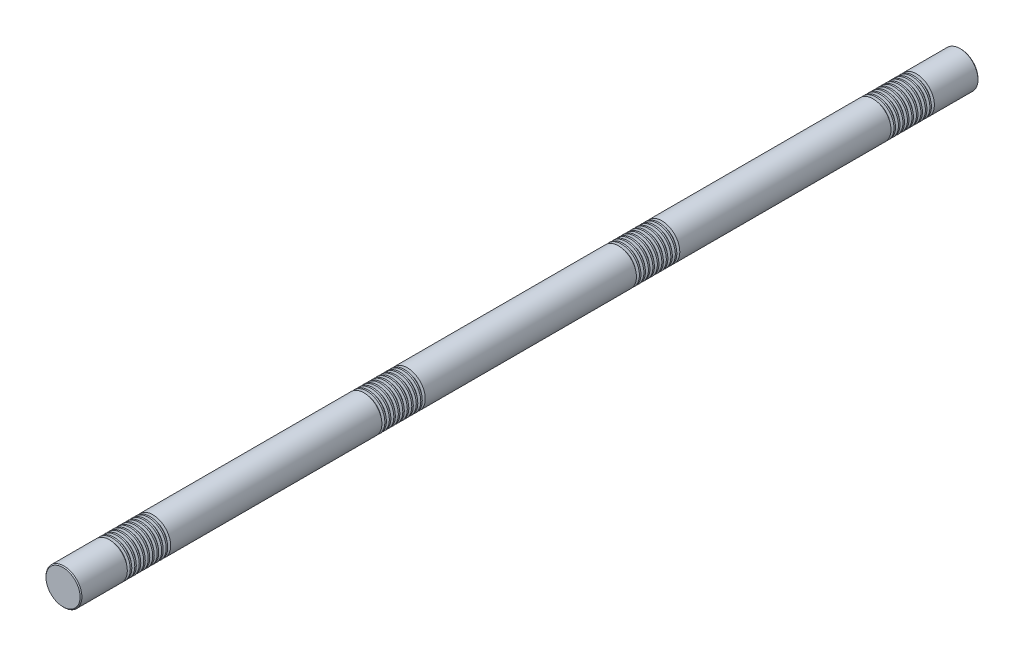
ISO-10303-21;
HEADER;
FILE_DESCRIPTION(('STEP AP214'),'2;1');
FILE_NAME('part.step','',(''),(''),'','','');
FILE_SCHEMA(('AUTOMOTIVE_DESIGN { 1 0 10303 214 1 1 1 1 }'));
ENDSEC;
DATA;
#1=APPLICATION_CONTEXT('core data for automotive mechanical design processes');
#2=APPLICATION_PROTOCOL_DEFINITION('international standard','automotive_design',2000,#1);
#3=PRODUCT_CONTEXT('',#1,'mechanical');
#4=PRODUCT('Part','Part','',(#3));
#5=PRODUCT_RELATED_PRODUCT_CATEGORY('part','',(#4));
#6=PRODUCT_DEFINITION_FORMATION('','',#4);
#7=PRODUCT_DEFINITION_CONTEXT('part definition',#1,'design');
#8=PRODUCT_DEFINITION('design','',#6,#7);
#9=PRODUCT_DEFINITION_SHAPE('','',#8);
#10=(LENGTH_UNIT() NAMED_UNIT(*) SI_UNIT(.MILLI.,.METRE.));
#11=(NAMED_UNIT(*) PLANE_ANGLE_UNIT() SI_UNIT($,.RADIAN.));
#12=(NAMED_UNIT(*) SI_UNIT($,.STERADIAN.) SOLID_ANGLE_UNIT());
#13=UNCERTAINTY_MEASURE_WITH_UNIT(LENGTH_MEASURE(1.E-05),#10,'distance_accuracy_value','');
#14=(GEOMETRIC_REPRESENTATION_CONTEXT(3) GLOBAL_UNCERTAINTY_ASSIGNED_CONTEXT((#13)) GLOBAL_UNIT_ASSIGNED_CONTEXT((#10,
#11,#12)) REPRESENTATION_CONTEXT('',''));
#15=CARTESIAN_POINT('',(0.,0.,0.));
#16=DIRECTION('',(0.,0.,1.));
#17=DIRECTION('',(1.,0.,0.));
#18=AXIS2_PLACEMENT_3D('',#15,#16,#17);
#19=CARTESIAN_POINT('',(0.,0.,1000.));
#20=DIRECTION('',(0.,0.,-1.));
#21=DIRECTION('',(-1.,0.,0.));
#22=AXIS2_PLACEMENT_3D('',#19,#20,#21);
#23=CYLINDRICAL_SURFACE('',#22,40.);
#24=CARTESIAN_POINT('',(0.,0.,886.803847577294));
#25=DIRECTION('',(0.,0.,1.));
#26=DIRECTION('',(1.,0.,0.));
#27=AXIS2_PLACEMENT_3D('',#24,#25,#26);
#28=CIRCLE('',#27,40.);
#29=CARTESIAN_POINT('',(40.,0.,886.803847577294));
#30=VERTEX_POINT('',#29);
#31=EDGE_CURVE('E675',#30,#30,#28,.T.);
#32=ORIENTED_EDGE('',*,*,#31,.T.);
#33=EDGE_LOOP('',(#32));
#34=FACE_BOUND('',#33,.T.);
#35=CARTESIAN_POINT('',(0.,0.,890.196152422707));
#36=DIRECTION('',(0.,0.,1.));
#37=DIRECTION('',(1.,0.,0.));
#38=AXIS2_PLACEMENT_3D('',#35,#36,#37);
#39=CIRCLE('',#38,40.);
#40=CARTESIAN_POINT('',(40.,0.,890.196152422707));
#41=VERTEX_POINT('',#40);
#42=EDGE_CURVE('E685',#41,#41,#39,.T.);
#43=ORIENTED_EDGE('',*,*,#42,.F.);
#44=EDGE_LOOP('',(#43));
#45=FACE_BOUND('',#44,.T.);
#46=ADVANCED_FACE('F37',(#34,#45),#23,.T.);
#47=CARTESIAN_POINT('',(0.,0.,876.803847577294));
#48=DIRECTION('',(0.,0.,1.));
#49=DIRECTION('',(1.,0.,0.));
#50=AXIS2_PLACEMENT_3D('',#47,#48,#49);
#51=CIRCLE('',#50,40.);
#52=CARTESIAN_POINT('',(40.,0.,876.803847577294));
#53=VERTEX_POINT('',#52);
#54=EDGE_CURVE('E659',#53,#53,#51,.T.);
#55=ORIENTED_EDGE('',*,*,#54,.T.);
#56=EDGE_LOOP('',(#55));
#57=FACE_BOUND('',#56,.T.);
#58=CARTESIAN_POINT('',(0.,0.,880.196152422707));
#59=DIRECTION('',(0.,0.,1.));
#60=DIRECTION('',(1.,0.,0.));
#61=AXIS2_PLACEMENT_3D('',#58,#59,#60);
#62=CIRCLE('',#61,40.);
#63=CARTESIAN_POINT('',(40.,0.,880.196152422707));
#64=VERTEX_POINT('',#63);
#65=EDGE_CURVE('E671',#64,#64,#62,.T.);
#66=ORIENTED_EDGE('',*,*,#65,.F.);
#67=EDGE_LOOP('',(#66));
#68=FACE_BOUND('',#67,.T.);
#69=ADVANCED_FACE('F721',(#57,#68),#23,.T.);
#70=CARTESIAN_POINT('',(0.,0.,866.803847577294));
#71=DIRECTION('',(0.,0.,1.));
#72=DIRECTION('',(1.,0.,0.));
#73=AXIS2_PLACEMENT_3D('',#70,#71,#72);
#74=CIRCLE('',#73,40.);
#75=CARTESIAN_POINT('',(40.,0.,866.803847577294));
#76=VERTEX_POINT('',#75);
#77=EDGE_CURVE('E643',#76,#76,#74,.T.);
#78=ORIENTED_EDGE('',*,*,#77,.T.);
#79=EDGE_LOOP('',(#78));
#80=FACE_BOUND('',#79,.T.);
#81=CARTESIAN_POINT('',(0.,0.,870.196152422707));
#82=DIRECTION('',(0.,0.,1.));
#83=DIRECTION('',(1.,0.,0.));
#84=AXIS2_PLACEMENT_3D('',#81,#82,#83);
#85=CIRCLE('',#84,40.);
#86=CARTESIAN_POINT('',(40.,0.,870.196152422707));
#87=VERTEX_POINT('',#86);
#88=EDGE_CURVE('E655',#87,#87,#85,.T.);
#89=ORIENTED_EDGE('',*,*,#88,.F.);
#90=EDGE_LOOP('',(#89));
#91=FACE_BOUND('',#90,.T.);
#92=ADVANCED_FACE('F729',(#80,#91),#23,.T.);
#93=CARTESIAN_POINT('',(0.,0.,856.803847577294));
#94=DIRECTION('',(0.,0.,1.));
#95=DIRECTION('',(1.,0.,0.));
#96=AXIS2_PLACEMENT_3D('',#93,#94,#95);
#97=CIRCLE('',#96,40.);
#98=CARTESIAN_POINT('',(40.,0.,856.803847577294));
#99=VERTEX_POINT('',#98);
#100=EDGE_CURVE('E627',#99,#99,#97,.T.);
#101=ORIENTED_EDGE('',*,*,#100,.T.);
#102=EDGE_LOOP('',(#101));
#103=FACE_BOUND('',#102,.T.);
#104=CARTESIAN_POINT('',(0.,0.,860.196152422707));
#105=DIRECTION('',(0.,0.,1.));
#106=DIRECTION('',(1.,0.,0.));
#107=AXIS2_PLACEMENT_3D('',#104,#105,#106);
#108=CIRCLE('',#107,40.);
#109=CARTESIAN_POINT('',(40.,0.,860.196152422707));
#110=VERTEX_POINT('',#109);
#111=EDGE_CURVE('E639',#110,#110,#108,.T.);
#112=ORIENTED_EDGE('',*,*,#111,.F.);
#113=EDGE_LOOP('',(#112));
#114=FACE_BOUND('',#113,.T.);
#115=ADVANCED_FACE('F1554',(#103,#114),#23,.T.);
#116=CARTESIAN_POINT('',(0.,0.,846.803847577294));
#117=DIRECTION('',(0.,0.,1.));
#118=DIRECTION('',(1.,0.,0.));
#119=AXIS2_PLACEMENT_3D('',#116,#117,#118);
#120=CIRCLE('',#119,40.);
#121=CARTESIAN_POINT('',(40.,0.,846.803847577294));
#122=VERTEX_POINT('',#121);
#123=EDGE_CURVE('E611',#122,#122,#120,.T.);
#124=ORIENTED_EDGE('',*,*,#123,.T.);
#125=EDGE_LOOP('',(#124));
#126=FACE_BOUND('',#125,.T.);
#127=CARTESIAN_POINT('',(0.,0.,850.196152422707));
#128=DIRECTION('',(0.,0.,1.));
#129=DIRECTION('',(1.,0.,0.));
#130=AXIS2_PLACEMENT_3D('',#127,#128,#129);
#131=CIRCLE('',#130,40.);
#132=CARTESIAN_POINT('',(40.,0.,850.196152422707));
#133=VERTEX_POINT('',#132);
#134=EDGE_CURVE('E623',#133,#133,#131,.T.);
#135=ORIENTED_EDGE('',*,*,#134,.F.);
#136=EDGE_LOOP('',(#135));
#137=FACE_BOUND('',#136,.T.);
#138=ADVANCED_FACE('F1531',(#126,#137),#23,.T.);
#139=CARTESIAN_POINT('',(0.,0.,836.803847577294));
#140=DIRECTION('',(0.,0.,1.));
#141=DIRECTION('',(1.,0.,0.));
#142=AXIS2_PLACEMENT_3D('',#139,#140,#141);
#143=CIRCLE('',#142,40.);
#144=CARTESIAN_POINT('',(40.,0.,836.803847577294));
#145=VERTEX_POINT('',#144);
#146=EDGE_CURVE('E595',#145,#145,#143,.T.);
#147=ORIENTED_EDGE('',*,*,#146,.T.);
#148=EDGE_LOOP('',(#147));
#149=FACE_BOUND('',#148,.T.);
#150=CARTESIAN_POINT('',(0.,0.,840.196152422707));
#151=DIRECTION('',(0.,0.,1.));
#152=DIRECTION('',(1.,0.,0.));
#153=AXIS2_PLACEMENT_3D('',#150,#151,#152);
#154=CIRCLE('',#153,40.);
#155=CARTESIAN_POINT('',(40.,0.,840.196152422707));
#156=VERTEX_POINT('',#155);
#157=EDGE_CURVE('E607',#156,#156,#154,.T.);
#158=ORIENTED_EDGE('',*,*,#157,.F.);
#159=EDGE_LOOP('',(#158));
#160=FACE_BOUND('',#159,.T.);
#161=ADVANCED_FACE('F1508',(#149,#160),#23,.T.);
#162=CARTESIAN_POINT('',(0.,0.,826.803847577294));
#163=DIRECTION('',(0.,0.,1.));
#164=DIRECTION('',(1.,0.,0.));
#165=AXIS2_PLACEMENT_3D('',#162,#163,#164);
#166=CIRCLE('',#165,40.);
#167=CARTESIAN_POINT('',(40.,0.,826.803847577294));
#168=VERTEX_POINT('',#167);
#169=EDGE_CURVE('E579',#168,#168,#166,.T.);
#170=ORIENTED_EDGE('',*,*,#169,.T.);
#171=EDGE_LOOP('',(#170));
#172=FACE_BOUND('',#171,.T.);
#173=CARTESIAN_POINT('',(0.,0.,830.196152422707));
#174=DIRECTION('',(0.,0.,1.));
#175=DIRECTION('',(1.,0.,0.));
#176=AXIS2_PLACEMENT_3D('',#173,#174,#175);
#177=CIRCLE('',#176,40.);
#178=CARTESIAN_POINT('',(40.,0.,830.196152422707));
#179=VERTEX_POINT('',#178);
#180=EDGE_CURVE('E591',#179,#179,#177,.T.);
#181=ORIENTED_EDGE('',*,*,#180,.F.);
#182=EDGE_LOOP('',(#181));
#183=FACE_BOUND('',#182,.T.);
#184=ADVANCED_FACE('F1485',(#172,#183),#23,.T.);
#185=CARTESIAN_POINT('',(0.,0.,816.803847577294));
#186=DIRECTION('',(0.,0.,1.));
#187=DIRECTION('',(1.,0.,0.));
#188=AXIS2_PLACEMENT_3D('',#185,#186,#187);
#189=CIRCLE('',#188,40.);
#190=CARTESIAN_POINT('',(40.,0.,816.803847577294));
#191=VERTEX_POINT('',#190);
#192=EDGE_CURVE('E563',#191,#191,#189,.T.);
#193=ORIENTED_EDGE('',*,*,#192,.T.);
#194=EDGE_LOOP('',(#193));
#195=FACE_BOUND('',#194,.T.);
#196=CARTESIAN_POINT('',(0.,0.,820.196152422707));
#197=DIRECTION('',(0.,0.,1.));
#198=DIRECTION('',(1.,0.,0.));
#199=AXIS2_PLACEMENT_3D('',#196,#197,#198);
#200=CIRCLE('',#199,40.);
#201=CARTESIAN_POINT('',(40.,0.,820.196152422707));
#202=VERTEX_POINT('',#201);
#203=EDGE_CURVE('E575',#202,#202,#200,.T.);
#204=ORIENTED_EDGE('',*,*,#203,.F.);
#205=EDGE_LOOP('',(#204));
#206=FACE_BOUND('',#205,.T.);
#207=ADVANCED_FACE('F1466',(#195,#206),#23,.T.);
#208=CARTESIAN_POINT('',(0.,0.,806.803847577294));
#209=DIRECTION('',(0.,0.,1.));
#210=DIRECTION('',(1.,0.,0.));
#211=AXIS2_PLACEMENT_3D('',#208,#209,#210);
#212=CIRCLE('',#211,40.);
#213=CARTESIAN_POINT('',(40.,0.,806.803847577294));
#214=VERTEX_POINT('',#213);
#215=EDGE_CURVE('E260',#214,#214,#212,.T.);
#216=ORIENTED_EDGE('',*,*,#215,.T.);
#217=EDGE_LOOP('',(#216));
#218=FACE_BOUND('',#217,.T.);
#219=CARTESIAN_POINT('',(0.,0.,810.196152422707));
#220=DIRECTION('',(0.,0.,1.));
#221=DIRECTION('',(1.,0.,0.));
#222=AXIS2_PLACEMENT_3D('',#219,#220,#221);
#223=CIRCLE('',#222,40.);
#224=CARTESIAN_POINT('',(40.,0.,810.196152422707));
#225=VERTEX_POINT('',#224);
#226=EDGE_CURVE('E559',#225,#225,#223,.T.);
#227=ORIENTED_EDGE('',*,*,#226,.F.);
#228=EDGE_LOOP('',(#227));
#229=FACE_BOUND('',#228,.T.);
#230=ADVANCED_FACE('F1415',(#218,#229),#23,.T.);
#231=CARTESIAN_POINT('',(0.,0.,319.803847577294));
#232=DIRECTION('',(0.,0.,1.));
#233=DIRECTION('',(1.,0.,0.));
#234=AXIS2_PLACEMENT_3D('',#231,#232,#233);
#235=CIRCLE('',#234,40.);
#236=CARTESIAN_POINT('',(40.,0.,319.803847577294));
#237=VERTEX_POINT('',#236);
#238=EDGE_CURVE('E531',#237,#237,#235,.T.);
#239=ORIENTED_EDGE('',*,*,#238,.T.);
#240=EDGE_LOOP('',(#239));
#241=FACE_BOUND('',#240,.T.);
#242=CARTESIAN_POINT('',(0.,0.,323.196152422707));
#243=DIRECTION('',(0.,0.,1.));
#244=DIRECTION('',(1.,0.,0.));
#245=AXIS2_PLACEMENT_3D('',#242,#243,#244);
#246=CIRCLE('',#245,40.);
#247=CARTESIAN_POINT('',(40.,0.,323.196152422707));
#248=VERTEX_POINT('',#247);
#249=EDGE_CURVE('E543',#248,#248,#246,.T.);
#250=ORIENTED_EDGE('',*,*,#249,.F.);
#251=EDGE_LOOP('',(#250));
#252=FACE_BOUND('',#251,.T.);
#253=ADVANCED_FACE('F1391',(#241,#252),#23,.T.);
#254=CARTESIAN_POINT('',(0.,0.,309.803847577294));
#255=DIRECTION('',(0.,0.,1.));
#256=DIRECTION('',(1.,0.,0.));
#257=AXIS2_PLACEMENT_3D('',#254,#255,#256);
#258=CIRCLE('',#257,40.);
#259=CARTESIAN_POINT('',(40.,0.,309.803847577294));
#260=VERTEX_POINT('',#259);
#261=EDGE_CURVE('E515',#260,#260,#258,.T.);
#262=ORIENTED_EDGE('',*,*,#261,.T.);
#263=EDGE_LOOP('',(#262));
#264=FACE_BOUND('',#263,.T.);
#265=CARTESIAN_POINT('',(0.,0.,313.196152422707));
#266=DIRECTION('',(0.,0.,1.));
#267=DIRECTION('',(1.,0.,0.));
#268=AXIS2_PLACEMENT_3D('',#265,#266,#267);
#269=CIRCLE('',#268,40.);
#270=CARTESIAN_POINT('',(40.,0.,313.196152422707));
#271=VERTEX_POINT('',#270);
#272=EDGE_CURVE('E527',#271,#271,#269,.T.);
#273=ORIENTED_EDGE('',*,*,#272,.F.);
#274=EDGE_LOOP('',(#273));
#275=FACE_BOUND('',#274,.T.);
#276=ADVANCED_FACE('F1368',(#264,#275),#23,.T.);
#277=CARTESIAN_POINT('',(0.,0.,299.803847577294));
#278=DIRECTION('',(0.,0.,1.));
#279=DIRECTION('',(1.,0.,0.));
#280=AXIS2_PLACEMENT_3D('',#277,#278,#279);
#281=CIRCLE('',#280,40.);
#282=CARTESIAN_POINT('',(40.,0.,299.803847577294));
#283=VERTEX_POINT('',#282);
#284=EDGE_CURVE('E499',#283,#283,#281,.T.);
#285=ORIENTED_EDGE('',*,*,#284,.T.);
#286=EDGE_LOOP('',(#285));
#287=FACE_BOUND('',#286,.T.);
#288=CARTESIAN_POINT('',(0.,0.,303.196152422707));
#289=DIRECTION('',(0.,0.,1.));
#290=DIRECTION('',(1.,0.,0.));
#291=AXIS2_PLACEMENT_3D('',#288,#289,#290);
#292=CIRCLE('',#291,40.);
#293=CARTESIAN_POINT('',(40.,0.,303.196152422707));
#294=VERTEX_POINT('',#293);
#295=EDGE_CURVE('E511',#294,#294,#292,.T.);
#296=ORIENTED_EDGE('',*,*,#295,.F.);
#297=EDGE_LOOP('',(#296));
#298=FACE_BOUND('',#297,.T.);
#299=ADVANCED_FACE('F1345',(#287,#298),#23,.T.);
#300=CARTESIAN_POINT('',(0.,0.,289.803847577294));
#301=DIRECTION('',(0.,0.,1.));
#302=DIRECTION('',(1.,0.,0.));
#303=AXIS2_PLACEMENT_3D('',#300,#301,#302);
#304=CIRCLE('',#303,40.);
#305=CARTESIAN_POINT('',(40.,0.,289.803847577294));
#306=VERTEX_POINT('',#305);
#307=EDGE_CURVE('E483',#306,#306,#304,.T.);
#308=ORIENTED_EDGE('',*,*,#307,.T.);
#309=EDGE_LOOP('',(#308));
#310=FACE_BOUND('',#309,.T.);
#311=CARTESIAN_POINT('',(0.,0.,293.196152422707));
#312=DIRECTION('',(0.,0.,1.));
#313=DIRECTION('',(1.,0.,0.));
#314=AXIS2_PLACEMENT_3D('',#311,#312,#313);
#315=CIRCLE('',#314,40.);
#316=CARTESIAN_POINT('',(40.,0.,293.196152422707));
#317=VERTEX_POINT('',#316);
#318=EDGE_CURVE('E495',#317,#317,#315,.T.);
#319=ORIENTED_EDGE('',*,*,#318,.F.);
#320=EDGE_LOOP('',(#319));
#321=FACE_BOUND('',#320,.T.);
#322=ADVANCED_FACE('F1322',(#310,#321),#23,.T.);
#323=CARTESIAN_POINT('',(0.,0.,279.803847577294));
#324=DIRECTION('',(0.,0.,1.));
#325=DIRECTION('',(1.,0.,0.));
#326=AXIS2_PLACEMENT_3D('',#323,#324,#325);
#327=CIRCLE('',#326,40.);
#328=CARTESIAN_POINT('',(40.,0.,279.803847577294));
#329=VERTEX_POINT('',#328);
#330=EDGE_CURVE('E467',#329,#329,#327,.T.);
#331=ORIENTED_EDGE('',*,*,#330,.T.);
#332=EDGE_LOOP('',(#331));
#333=FACE_BOUND('',#332,.T.);
#334=CARTESIAN_POINT('',(0.,0.,283.196152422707));
#335=DIRECTION('',(0.,0.,1.));
#336=DIRECTION('',(1.,0.,0.));
#337=AXIS2_PLACEMENT_3D('',#334,#335,#336);
#338=CIRCLE('',#337,40.);
#339=CARTESIAN_POINT('',(40.,0.,283.196152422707));
#340=VERTEX_POINT('',#339);
#341=EDGE_CURVE('E479',#340,#340,#338,.T.);
#342=ORIENTED_EDGE('',*,*,#341,.F.);
#343=EDGE_LOOP('',(#342));
#344=FACE_BOUND('',#343,.T.);
#345=ADVANCED_FACE('F1299',(#333,#344),#23,.T.);
#346=CARTESIAN_POINT('',(0.,0.,269.803847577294));
#347=DIRECTION('',(0.,0.,1.));
#348=DIRECTION('',(1.,0.,0.));
#349=AXIS2_PLACEMENT_3D('',#346,#347,#348);
#350=CIRCLE('',#349,40.);
#351=CARTESIAN_POINT('',(40.,0.,269.803847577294));
#352=VERTEX_POINT('',#351);
#353=EDGE_CURVE('E451',#352,#352,#350,.T.);
#354=ORIENTED_EDGE('',*,*,#353,.T.);
#355=EDGE_LOOP('',(#354));
#356=FACE_BOUND('',#355,.T.);
#357=CARTESIAN_POINT('',(0.,0.,273.196152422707));
#358=DIRECTION('',(0.,0.,1.));
#359=DIRECTION('',(1.,0.,0.));
#360=AXIS2_PLACEMENT_3D('',#357,#358,#359);
#361=CIRCLE('',#360,40.);
#362=CARTESIAN_POINT('',(40.,0.,273.196152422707));
#363=VERTEX_POINT('',#362);
#364=EDGE_CURVE('E463',#363,#363,#361,.T.);
#365=ORIENTED_EDGE('',*,*,#364,.F.);
#366=EDGE_LOOP('',(#365));
#367=FACE_BOUND('',#366,.T.);
#368=ADVANCED_FACE('F1276',(#356,#367),#23,.T.);
#369=CARTESIAN_POINT('',(0.,0.,259.803847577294));
#370=DIRECTION('',(0.,0.,1.));
#371=DIRECTION('',(1.,0.,0.));
#372=AXIS2_PLACEMENT_3D('',#369,#370,#371);
#373=CIRCLE('',#372,40.);
#374=CARTESIAN_POINT('',(40.,0.,259.803847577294));
#375=VERTEX_POINT('',#374);
#376=EDGE_CURVE('E435',#375,#375,#373,.T.);
#377=ORIENTED_EDGE('',*,*,#376,.T.);
#378=EDGE_LOOP('',(#377));
#379=FACE_BOUND('',#378,.T.);
#380=CARTESIAN_POINT('',(0.,0.,263.196152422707));
#381=DIRECTION('',(0.,0.,1.));
#382=DIRECTION('',(1.,0.,0.));
#383=AXIS2_PLACEMENT_3D('',#380,#381,#382);
#384=CIRCLE('',#383,40.);
#385=CARTESIAN_POINT('',(40.,0.,263.196152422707));
#386=VERTEX_POINT('',#385);
#387=EDGE_CURVE('E447',#386,#386,#384,.T.);
#388=ORIENTED_EDGE('',*,*,#387,.F.);
#389=EDGE_LOOP('',(#388));
#390=FACE_BOUND('',#389,.T.);
#391=ADVANCED_FACE('F1253',(#379,#390),#23,.T.);
#392=CARTESIAN_POINT('',(0.,0.,249.803847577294));
#393=DIRECTION('',(0.,0.,1.));
#394=DIRECTION('',(1.,0.,0.));
#395=AXIS2_PLACEMENT_3D('',#392,#393,#394);
#396=CIRCLE('',#395,40.);
#397=CARTESIAN_POINT('',(40.,0.,249.803847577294));
#398=VERTEX_POINT('',#397);
#399=EDGE_CURVE('E419',#398,#398,#396,.T.);
#400=ORIENTED_EDGE('',*,*,#399,.T.);
#401=EDGE_LOOP('',(#400));
#402=FACE_BOUND('',#401,.T.);
#403=CARTESIAN_POINT('',(0.,0.,253.196152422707));
#404=DIRECTION('',(0.,0.,1.));
#405=DIRECTION('',(1.,0.,0.));
#406=AXIS2_PLACEMENT_3D('',#403,#404,#405);
#407=CIRCLE('',#406,40.);
#408=CARTESIAN_POINT('',(40.,0.,253.196152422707));
#409=VERTEX_POINT('',#408);
#410=EDGE_CURVE('E431',#409,#409,#407,.T.);
#411=ORIENTED_EDGE('',*,*,#410,.F.);
#412=EDGE_LOOP('',(#411));
#413=FACE_BOUND('',#412,.T.);
#414=ADVANCED_FACE('F1234',(#402,#413),#23,.T.);
#415=CARTESIAN_POINT('',(0.,0.,239.803847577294));
#416=DIRECTION('',(0.,0.,1.));
#417=DIRECTION('',(1.,0.,0.));
#418=AXIS2_PLACEMENT_3D('',#415,#416,#417);
#419=CIRCLE('',#418,40.);
#420=CARTESIAN_POINT('',(40.,0.,239.803847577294));
#421=VERTEX_POINT('',#420);
#422=EDGE_CURVE('E244',#421,#421,#419,.T.);
#423=ORIENTED_EDGE('',*,*,#422,.T.);
#424=EDGE_LOOP('',(#423));
#425=FACE_BOUND('',#424,.T.);
#426=CARTESIAN_POINT('',(0.,0.,243.196152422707));
#427=DIRECTION('',(0.,0.,1.));
#428=DIRECTION('',(1.,0.,0.));
#429=AXIS2_PLACEMENT_3D('',#426,#427,#428);
#430=CIRCLE('',#429,40.);
#431=CARTESIAN_POINT('',(40.,0.,243.196152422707));
#432=VERTEX_POINT('',#431);
#433=EDGE_CURVE('E415',#432,#432,#430,.T.);
#434=ORIENTED_EDGE('',*,*,#433,.F.);
#435=EDGE_LOOP('',(#434));
#436=FACE_BOUND('',#435,.T.);
#437=ADVANCED_FACE('F1183',(#425,#436),#23,.T.);
#438=CARTESIAN_POINT('',(0.,0.,-247.196152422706));
#439=DIRECTION('',(0.,0.,1.));
#440=DIRECTION('',(1.,0.,0.));
#441=AXIS2_PLACEMENT_3D('',#438,#439,#440);
#442=CIRCLE('',#441,40.);
#443=CARTESIAN_POINT('',(40.,0.,-247.196152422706));
#444=VERTEX_POINT('',#443);
#445=EDGE_CURVE('E387',#444,#444,#442,.T.);
#446=ORIENTED_EDGE('',*,*,#445,.T.);
#447=EDGE_LOOP('',(#446));
#448=FACE_BOUND('',#447,.T.);
#449=CARTESIAN_POINT('',(0.,0.,-243.803847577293));
#450=DIRECTION('',(0.,0.,1.));
#451=DIRECTION('',(1.,0.,0.));
#452=AXIS2_PLACEMENT_3D('',#449,#450,#451);
#453=CIRCLE('',#452,40.);
#454=CARTESIAN_POINT('',(40.,0.,-243.803847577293));
#455=VERTEX_POINT('',#454);
#456=EDGE_CURVE('E399',#455,#455,#453,.T.);
#457=ORIENTED_EDGE('',*,*,#456,.F.);
#458=EDGE_LOOP('',(#457));
#459=FACE_BOUND('',#458,.T.);
#460=ADVANCED_FACE('F1159',(#448,#459),#23,.T.);
#461=CARTESIAN_POINT('',(0.,0.,-257.196152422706));
#462=DIRECTION('',(0.,0.,1.));
#463=DIRECTION('',(1.,0.,0.));
#464=AXIS2_PLACEMENT_3D('',#461,#462,#463);
#465=CIRCLE('',#464,40.);
#466=CARTESIAN_POINT('',(40.,0.,-257.196152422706));
#467=VERTEX_POINT('',#466);
#468=EDGE_CURVE('E371',#467,#467,#465,.T.);
#469=ORIENTED_EDGE('',*,*,#468,.T.);
#470=EDGE_LOOP('',(#469));
#471=FACE_BOUND('',#470,.T.);
#472=CARTESIAN_POINT('',(0.,0.,-253.803847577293));
#473=DIRECTION('',(0.,0.,1.));
#474=DIRECTION('',(1.,0.,0.));
#475=AXIS2_PLACEMENT_3D('',#472,#473,#474);
#476=CIRCLE('',#475,40.);
#477=CARTESIAN_POINT('',(40.,0.,-253.803847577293));
#478=VERTEX_POINT('',#477);
#479=EDGE_CURVE('E383',#478,#478,#476,.T.);
#480=ORIENTED_EDGE('',*,*,#479,.F.);
#481=EDGE_LOOP('',(#480));
#482=FACE_BOUND('',#481,.T.);
#483=ADVANCED_FACE('F1136',(#471,#482),#23,.T.);
#484=CARTESIAN_POINT('',(0.,0.,-267.196152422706));
#485=DIRECTION('',(0.,0.,1.));
#486=DIRECTION('',(1.,0.,0.));
#487=AXIS2_PLACEMENT_3D('',#484,#485,#486);
#488=CIRCLE('',#487,40.);
#489=CARTESIAN_POINT('',(40.,0.,-267.196152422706));
#490=VERTEX_POINT('',#489);
#491=EDGE_CURVE('E355',#490,#490,#488,.T.);
#492=ORIENTED_EDGE('',*,*,#491,.T.);
#493=EDGE_LOOP('',(#492));
#494=FACE_BOUND('',#493,.T.);
#495=CARTESIAN_POINT('',(0.,0.,-263.803847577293));
#496=DIRECTION('',(0.,0.,1.));
#497=DIRECTION('',(1.,0.,0.));
#498=AXIS2_PLACEMENT_3D('',#495,#496,#497);
#499=CIRCLE('',#498,40.);
#500=CARTESIAN_POINT('',(40.,0.,-263.803847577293));
#501=VERTEX_POINT('',#500);
#502=EDGE_CURVE('E367',#501,#501,#499,.T.);
#503=ORIENTED_EDGE('',*,*,#502,.F.);
#504=EDGE_LOOP('',(#503));
#505=FACE_BOUND('',#504,.T.);
#506=ADVANCED_FACE('F1113',(#494,#505),#23,.T.);
#507=CARTESIAN_POINT('',(0.,0.,-277.196152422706));
#508=DIRECTION('',(0.,0.,1.));
#509=DIRECTION('',(1.,0.,0.));
#510=AXIS2_PLACEMENT_3D('',#507,#508,#509);
#511=CIRCLE('',#510,40.);
#512=CARTESIAN_POINT('',(40.,0.,-277.196152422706));
#513=VERTEX_POINT('',#512);
#514=EDGE_CURVE('E340',#513,#513,#511,.T.);
#515=ORIENTED_EDGE('',*,*,#514,.T.);
#516=EDGE_LOOP('',(#515));
#517=FACE_BOUND('',#516,.T.);
#518=CARTESIAN_POINT('',(0.,0.,-273.803847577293));
#519=DIRECTION('',(0.,0.,1.));
#520=DIRECTION('',(1.,0.,0.));
#521=AXIS2_PLACEMENT_3D('',#518,#519,#520);
#522=CIRCLE('',#521,40.);
#523=CARTESIAN_POINT('',(40.,0.,-273.803847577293));
#524=VERTEX_POINT('',#523);
#525=EDGE_CURVE('E351',#524,#524,#522,.T.);
#526=ORIENTED_EDGE('',*,*,#525,.F.);
#527=EDGE_LOOP('',(#526));
#528=FACE_BOUND('',#527,.T.);
#529=ADVANCED_FACE('F1090',(#517,#528),#23,.T.);
#530=CARTESIAN_POINT('',(0.,0.,-287.196152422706));
#531=DIRECTION('',(0.,0.,1.));
#532=DIRECTION('',(1.,0.,0.));
#533=AXIS2_PLACEMENT_3D('',#530,#531,#532);
#534=CIRCLE('',#533,40.);
#535=CARTESIAN_POINT('',(40.,0.,-287.196152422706));
#536=VERTEX_POINT('',#535);
#537=EDGE_CURVE('E324',#536,#536,#534,.T.);
#538=ORIENTED_EDGE('',*,*,#537,.T.);
#539=EDGE_LOOP('',(#538));
#540=FACE_BOUND('',#539,.T.);
#541=CARTESIAN_POINT('',(0.,0.,-283.803847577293));
#542=DIRECTION('',(0.,0.,1.));
#543=DIRECTION('',(1.,0.,0.));
#544=AXIS2_PLACEMENT_3D('',#541,#542,#543);
#545=CIRCLE('',#544,40.);
#546=CARTESIAN_POINT('',(40.,0.,-283.803847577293));
#547=VERTEX_POINT('',#546);
#548=EDGE_CURVE('E336',#547,#547,#545,.T.);
#549=ORIENTED_EDGE('',*,*,#548,.F.);
#550=EDGE_LOOP('',(#549));
#551=FACE_BOUND('',#550,.T.);
#552=ADVANCED_FACE('F1067',(#540,#551),#23,.T.);
#553=CARTESIAN_POINT('',(0.,0.,-297.196152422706));
#554=DIRECTION('',(0.,0.,1.));
#555=DIRECTION('',(1.,0.,0.));
#556=AXIS2_PLACEMENT_3D('',#553,#554,#555);
#557=CIRCLE('',#556,40.);
#558=CARTESIAN_POINT('',(40.,0.,-297.196152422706));
#559=VERTEX_POINT('',#558);
#560=EDGE_CURVE('E308',#559,#559,#557,.T.);
#561=ORIENTED_EDGE('',*,*,#560,.T.);
#562=EDGE_LOOP('',(#561));
#563=FACE_BOUND('',#562,.T.);
#564=CARTESIAN_POINT('',(0.,0.,-293.803847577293));
#565=DIRECTION('',(0.,0.,1.));
#566=DIRECTION('',(1.,0.,0.));
#567=AXIS2_PLACEMENT_3D('',#564,#565,#566);
#568=CIRCLE('',#567,40.);
#569=CARTESIAN_POINT('',(40.,0.,-293.803847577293));
#570=VERTEX_POINT('',#569);
#571=EDGE_CURVE('E320',#570,#570,#568,.T.);
#572=ORIENTED_EDGE('',*,*,#571,.F.);
#573=EDGE_LOOP('',(#572));
#574=FACE_BOUND('',#573,.T.);
#575=ADVANCED_FACE('F1044',(#563,#574),#23,.T.);
#576=CARTESIAN_POINT('',(0.,0.,-307.196152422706));
#577=DIRECTION('',(0.,0.,1.));
#578=DIRECTION('',(1.,0.,0.));
#579=AXIS2_PLACEMENT_3D('',#576,#577,#578);
#580=CIRCLE('',#579,40.);
#581=CARTESIAN_POINT('',(40.,0.,-307.196152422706));
#582=VERTEX_POINT('',#581);
#583=EDGE_CURVE('E292',#582,#582,#580,.T.);
#584=ORIENTED_EDGE('',*,*,#583,.T.);
#585=EDGE_LOOP('',(#584));
#586=FACE_BOUND('',#585,.T.);
#587=CARTESIAN_POINT('',(0.,0.,-303.803847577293));
#588=DIRECTION('',(0.,0.,1.));
#589=DIRECTION('',(1.,0.,0.));
#590=AXIS2_PLACEMENT_3D('',#587,#588,#589);
#591=CIRCLE('',#590,40.);
#592=CARTESIAN_POINT('',(40.,0.,-303.803847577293));
#593=VERTEX_POINT('',#592);
#594=EDGE_CURVE('E304',#593,#593,#591,.T.);
#595=ORIENTED_EDGE('',*,*,#594,.F.);
#596=EDGE_LOOP('',(#595));
#597=FACE_BOUND('',#596,.T.);
#598=ADVANCED_FACE('F1021',(#586,#597),#23,.T.);
#599=CARTESIAN_POINT('',(0.,0.,-317.196152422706));
#600=DIRECTION('',(0.,0.,1.));
#601=DIRECTION('',(1.,0.,0.));
#602=AXIS2_PLACEMENT_3D('',#599,#600,#601);
#603=CIRCLE('',#602,40.);
#604=CARTESIAN_POINT('',(40.,0.,-317.196152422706));
#605=VERTEX_POINT('',#604);
#606=EDGE_CURVE('E276',#605,#605,#603,.T.);
#607=ORIENTED_EDGE('',*,*,#606,.T.);
#608=EDGE_LOOP('',(#607));
#609=FACE_BOUND('',#608,.T.);
#610=CARTESIAN_POINT('',(0.,0.,-313.803847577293));
#611=DIRECTION('',(0.,0.,1.));
#612=DIRECTION('',(1.,0.,0.));
#613=AXIS2_PLACEMENT_3D('',#610,#611,#612);
#614=CIRCLE('',#613,40.);
#615=CARTESIAN_POINT('',(40.,0.,-313.803847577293));
#616=VERTEX_POINT('',#615);
#617=EDGE_CURVE('E288',#616,#616,#614,.T.);
#618=ORIENTED_EDGE('',*,*,#617,.F.);
#619=EDGE_LOOP('',(#618));
#620=FACE_BOUND('',#619,.T.);
#621=ADVANCED_FACE('F998',(#609,#620),#23,.T.);
#622=CARTESIAN_POINT('',(0.,0.,-327.196152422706));
#623=DIRECTION('',(0.,0.,1.));
#624=DIRECTION('',(1.,0.,0.));
#625=AXIS2_PLACEMENT_3D('',#622,#623,#624);
#626=CIRCLE('',#625,40.);
#627=CARTESIAN_POINT('',(40.,0.,-327.196152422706));
#628=VERTEX_POINT('',#627);
#629=EDGE_CURVE('E228',#628,#628,#626,.T.);
#630=ORIENTED_EDGE('',*,*,#629,.T.);
#631=EDGE_LOOP('',(#630));
#632=FACE_BOUND('',#631,.T.);
#633=CARTESIAN_POINT('',(0.,0.,-323.803847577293));
#634=DIRECTION('',(0.,0.,1.));
#635=DIRECTION('',(1.,0.,0.));
#636=AXIS2_PLACEMENT_3D('',#633,#634,#635);
#637=CIRCLE('',#636,40.);
#638=CARTESIAN_POINT('',(40.,0.,-323.803847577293));
#639=VERTEX_POINT('',#638);
#640=EDGE_CURVE('E272',#639,#639,#637,.T.);
#641=ORIENTED_EDGE('',*,*,#640,.F.);
#642=EDGE_LOOP('',(#641));
#643=FACE_BOUND('',#642,.T.);
#644=ADVANCED_FACE('F975',(#632,#643),#23,.T.);
#645=CARTESIAN_POINT('',(0.,0.,-804.196152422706));
#646=DIRECTION('',(0.,0.,1.));
#647=DIRECTION('',(1.,0.,0.));
#648=AXIS2_PLACEMENT_3D('',#645,#646,#647);
#649=CIRCLE('',#648,40.);
#650=CARTESIAN_POINT('',(40.,0.,-804.196152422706));
#651=VERTEX_POINT('',#650);
#652=EDGE_CURVE('E212',#651,#651,#649,.T.);
#653=ORIENTED_EDGE('',*,*,#652,.T.);
#654=EDGE_LOOP('',(#653));
#655=FACE_BOUND('',#654,.T.);
#656=CARTESIAN_POINT('',(0.,0.,-333.803847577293));
#657=DIRECTION('',(0.,0.,1.));
#658=DIRECTION('',(1.,0.,0.));
#659=AXIS2_PLACEMENT_3D('',#656,#657,#658);
#660=CIRCLE('',#659,40.);
#661=CARTESIAN_POINT('',(40.,0.,-333.803847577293));
#662=VERTEX_POINT('',#661);
#663=EDGE_CURVE('E224',#662,#662,#660,.T.);
#664=ORIENTED_EDGE('',*,*,#663,.F.);
#665=EDGE_LOOP('',(#664));
#666=FACE_BOUND('',#665,.T.);
#667=ADVANCED_FACE('F952',(#655,#666),#23,.T.);
#668=CARTESIAN_POINT('',(0.,0.,-814.196152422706));
#669=DIRECTION('',(0.,0.,1.));
#670=DIRECTION('',(1.,0.,0.));
#671=AXIS2_PLACEMENT_3D('',#668,#669,#670);
#672=CIRCLE('',#671,40.);
#673=CARTESIAN_POINT('',(40.,0.,-814.196152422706));
#674=VERTEX_POINT('',#673);
#675=EDGE_CURVE('E196',#674,#674,#672,.T.);
#676=ORIENTED_EDGE('',*,*,#675,.T.);
#677=EDGE_LOOP('',(#676));
#678=FACE_BOUND('',#677,.T.);
#679=CARTESIAN_POINT('',(0.,0.,-810.803847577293));
#680=DIRECTION('',(0.,0.,1.));
#681=DIRECTION('',(1.,0.,0.));
#682=AXIS2_PLACEMENT_3D('',#679,#680,#681);
#683=CIRCLE('',#682,40.);
#684=CARTESIAN_POINT('',(40.,0.,-810.803847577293));
#685=VERTEX_POINT('',#684);
#686=EDGE_CURVE('E208',#685,#685,#683,.T.);
#687=ORIENTED_EDGE('',*,*,#686,.F.);
#688=EDGE_LOOP('',(#687));
#689=FACE_BOUND('',#688,.T.);
#690=ADVANCED_FACE('F929',(#678,#689),#23,.T.);
#691=CARTESIAN_POINT('',(0.,0.,-824.196152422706));
#692=DIRECTION('',(0.,0.,1.));
#693=DIRECTION('',(1.,0.,0.));
#694=AXIS2_PLACEMENT_3D('',#691,#692,#693);
#695=CIRCLE('',#694,40.);
#696=CARTESIAN_POINT('',(40.,0.,-824.196152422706));
#697=VERTEX_POINT('',#696);
#698=EDGE_CURVE('E180',#697,#697,#695,.T.);
#699=ORIENTED_EDGE('',*,*,#698,.T.);
#700=EDGE_LOOP('',(#699));
#701=FACE_BOUND('',#700,.T.);
#702=CARTESIAN_POINT('',(0.,0.,-820.803847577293));
#703=DIRECTION('',(0.,0.,1.));
#704=DIRECTION('',(1.,0.,0.));
#705=AXIS2_PLACEMENT_3D('',#702,#703,#704);
#706=CIRCLE('',#705,40.);
#707=CARTESIAN_POINT('',(40.,0.,-820.803847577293));
#708=VERTEX_POINT('',#707);
#709=EDGE_CURVE('E192',#708,#708,#706,.T.);
#710=ORIENTED_EDGE('',*,*,#709,.F.);
#711=EDGE_LOOP('',(#710));
#712=FACE_BOUND('',#711,.T.);
#713=ADVANCED_FACE('F906',(#701,#712),#23,.T.);
#714=CARTESIAN_POINT('',(0.,0.,-834.196152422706));
#715=DIRECTION('',(0.,0.,1.));
#716=DIRECTION('',(1.,0.,0.));
#717=AXIS2_PLACEMENT_3D('',#714,#715,#716);
#718=CIRCLE('',#717,40.);
#719=CARTESIAN_POINT('',(40.,0.,-834.196152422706));
#720=VERTEX_POINT('',#719);
#721=EDGE_CURVE('E164',#720,#720,#718,.T.);
#722=ORIENTED_EDGE('',*,*,#721,.T.);
#723=EDGE_LOOP('',(#722));
#724=FACE_BOUND('',#723,.T.);
#725=CARTESIAN_POINT('',(0.,0.,-830.803847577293));
#726=DIRECTION('',(0.,0.,1.));
#727=DIRECTION('',(1.,0.,0.));
#728=AXIS2_PLACEMENT_3D('',#725,#726,#727);
#729=CIRCLE('',#728,40.);
#730=CARTESIAN_POINT('',(40.,0.,-830.803847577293));
#731=VERTEX_POINT('',#730);
#732=EDGE_CURVE('E176',#731,#731,#729,.T.);
#733=ORIENTED_EDGE('',*,*,#732,.F.);
#734=EDGE_LOOP('',(#733));
#735=FACE_BOUND('',#734,.T.);
#736=ADVANCED_FACE('F883',(#724,#735),#23,.T.);
#737=CARTESIAN_POINT('',(0.,0.,-844.196152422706));
#738=DIRECTION('',(0.,0.,1.));
#739=DIRECTION('',(1.,0.,0.));
#740=AXIS2_PLACEMENT_3D('',#737,#738,#739);
#741=CIRCLE('',#740,40.);
#742=CARTESIAN_POINT('',(40.,0.,-844.196152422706));
#743=VERTEX_POINT('',#742);
#744=EDGE_CURVE('E149',#743,#743,#741,.T.);
#745=ORIENTED_EDGE('',*,*,#744,.T.);
#746=EDGE_LOOP('',(#745));
#747=FACE_BOUND('',#746,.T.);
#748=CARTESIAN_POINT('',(0.,0.,-840.803847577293));
#749=DIRECTION('',(0.,0.,1.));
#750=DIRECTION('',(1.,0.,0.));
#751=AXIS2_PLACEMENT_3D('',#748,#749,#750);
#752=CIRCLE('',#751,40.);
#753=CARTESIAN_POINT('',(40.,0.,-840.803847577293));
#754=VERTEX_POINT('',#753);
#755=EDGE_CURVE('E160',#754,#754,#752,.T.);
#756=ORIENTED_EDGE('',*,*,#755,.F.);
#757=EDGE_LOOP('',(#756));
#758=FACE_BOUND('',#757,.T.);
#759=ADVANCED_FACE('F860',(#747,#758),#23,.T.);
#760=CARTESIAN_POINT('',(0.,0.,-854.196152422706));
#761=DIRECTION('',(0.,0.,1.));
#762=DIRECTION('',(1.,0.,0.));
#763=AXIS2_PLACEMENT_3D('',#760,#761,#762);
#764=CIRCLE('',#763,40.);
#765=CARTESIAN_POINT('',(40.,0.,-854.196152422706));
#766=VERTEX_POINT('',#765);
#767=EDGE_CURVE('E133',#766,#766,#764,.T.);
#768=ORIENTED_EDGE('',*,*,#767,.T.);
#769=EDGE_LOOP('',(#768));
#770=FACE_BOUND('',#769,.T.);
#771=CARTESIAN_POINT('',(0.,0.,-850.803847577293));
#772=DIRECTION('',(0.,0.,1.));
#773=DIRECTION('',(1.,0.,0.));
#774=AXIS2_PLACEMENT_3D('',#771,#772,#773);
#775=CIRCLE('',#774,40.);
#776=CARTESIAN_POINT('',(40.,0.,-850.803847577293));
#777=VERTEX_POINT('',#776);
#778=EDGE_CURVE('E145',#777,#777,#775,.T.);
#779=ORIENTED_EDGE('',*,*,#778,.F.);
#780=EDGE_LOOP('',(#779));
#781=FACE_BOUND('',#780,.T.);
#782=ADVANCED_FACE('F837',(#770,#781),#23,.T.);
#783=CARTESIAN_POINT('',(0.,0.,-864.196152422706));
#784=DIRECTION('',(0.,0.,1.));
#785=DIRECTION('',(1.,0.,0.));
#786=AXIS2_PLACEMENT_3D('',#783,#784,#785);
#787=CIRCLE('',#786,40.);
#788=CARTESIAN_POINT('',(40.,0.,-864.196152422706));
#789=VERTEX_POINT('',#788);
#790=EDGE_CURVE('E117',#789,#789,#787,.T.);
#791=ORIENTED_EDGE('',*,*,#790,.T.);
#792=EDGE_LOOP('',(#791));
#793=FACE_BOUND('',#792,.T.);
#794=CARTESIAN_POINT('',(0.,0.,-860.803847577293));
#795=DIRECTION('',(0.,0.,1.));
#796=DIRECTION('',(1.,0.,0.));
#797=AXIS2_PLACEMENT_3D('',#794,#795,#796);
#798=CIRCLE('',#797,40.);
#799=CARTESIAN_POINT('',(40.,0.,-860.803847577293));
#800=VERTEX_POINT('',#799);
#801=EDGE_CURVE('E129',#800,#800,#798,.T.);
#802=ORIENTED_EDGE('',*,*,#801,.F.);
#803=EDGE_LOOP('',(#802));
#804=FACE_BOUND('',#803,.T.);
#805=ADVANCED_FACE('F814',(#793,#804),#23,.T.);
#806=CARTESIAN_POINT('',(0.,0.,-874.196152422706));
#807=DIRECTION('',(0.,0.,1.));
#808=DIRECTION('',(1.,0.,0.));
#809=AXIS2_PLACEMENT_3D('',#806,#807,#808);
#810=CIRCLE('',#809,40.);
#811=CARTESIAN_POINT('',(40.,0.,-874.196152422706));
#812=VERTEX_POINT('',#811);
#813=EDGE_CURVE('E101',#812,#812,#810,.T.);
#814=ORIENTED_EDGE('',*,*,#813,.T.);
#815=EDGE_LOOP('',(#814));
#816=FACE_BOUND('',#815,.T.);
#817=CARTESIAN_POINT('',(0.,0.,-870.803847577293));
#818=DIRECTION('',(0.,0.,1.));
#819=DIRECTION('',(1.,0.,0.));
#820=AXIS2_PLACEMENT_3D('',#817,#818,#819);
#821=CIRCLE('',#820,40.);
#822=CARTESIAN_POINT('',(40.,0.,-870.803847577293));
#823=VERTEX_POINT('',#822);
#824=EDGE_CURVE('E113',#823,#823,#821,.T.);
#825=ORIENTED_EDGE('',*,*,#824,.F.);
#826=EDGE_LOOP('',(#825));
#827=FACE_BOUND('',#826,.T.);
#828=ADVANCED_FACE('F791',(#816,#827),#23,.T.);
#829=CARTESIAN_POINT('',(0.,0.,-884.196152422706));
#830=DIRECTION('',(0.,0.,1.));
#831=DIRECTION('',(1.,0.,0.));
#832=AXIS2_PLACEMENT_3D('',#829,#830,#831);
#833=CIRCLE('',#832,40.);
#834=CARTESIAN_POINT('',(40.,0.,-884.196152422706));
#835=VERTEX_POINT('',#834);
#836=EDGE_CURVE('E85',#835,#835,#833,.T.);
#837=ORIENTED_EDGE('',*,*,#836,.T.);
#838=EDGE_LOOP('',(#837));
#839=FACE_BOUND('',#838,.T.);
#840=CARTESIAN_POINT('',(0.,0.,-880.803847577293));
#841=DIRECTION('',(0.,0.,1.));
#842=DIRECTION('',(1.,0.,0.));
#843=AXIS2_PLACEMENT_3D('',#840,#841,#842);
#844=CIRCLE('',#843,40.);
#845=CARTESIAN_POINT('',(40.,0.,-880.803847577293));
#846=VERTEX_POINT('',#845);
#847=EDGE_CURVE('E97',#846,#846,#844,.T.);
#848=ORIENTED_EDGE('',*,*,#847,.F.);
#849=EDGE_LOOP('',(#848));
#850=FACE_BOUND('',#849,.T.);
#851=ADVANCED_FACE('F744',(#839,#850),#23,.T.);
#852=CARTESIAN_POINT('',(0.,0.,-894.196152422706));
#853=DIRECTION('',(0.,0.,1.));
#854=DIRECTION('',(1.,0.,0.));
#855=AXIS2_PLACEMENT_3D('',#852,#853,#854);
#856=CIRCLE('',#855,40.);
#857=CARTESIAN_POINT('',(40.,0.,-894.196152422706));
#858=VERTEX_POINT('',#857);
#859=EDGE_CURVE('E69',#858,#858,#856,.T.);
#860=ORIENTED_EDGE('',*,*,#859,.T.);
#861=EDGE_LOOP('',(#860));
#862=FACE_BOUND('',#861,.T.);
#863=CARTESIAN_POINT('',(0.,0.,-890.803847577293));
#864=DIRECTION('',(0.,0.,1.));
#865=DIRECTION('',(1.,0.,0.));
#866=AXIS2_PLACEMENT_3D('',#863,#864,#865);
#867=CIRCLE('',#866,40.);
#868=CARTESIAN_POINT('',(40.,0.,-890.803847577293));
#869=VERTEX_POINT('',#868);
#870=EDGE_CURVE('E81',#869,#869,#867,.T.);
#871=ORIENTED_EDGE('',*,*,#870,.F.);
#872=EDGE_LOOP('',(#871));
#873=FACE_BOUND('',#872,.T.);
#874=ADVANCED_FACE('F737',(#862,#873),#23,.T.);
#875=CARTESIAN_POINT('',(0.,0.,-998.));
#876=DIRECTION('',(0.,0.,1.));
#877=DIRECTION('',(1.,0.,0.));
#878=AXIS2_PLACEMENT_3D('',#875,#876,#877);
#879=CIRCLE('',#878,40.);
#880=CARTESIAN_POINT('',(40.,0.,-998.));
#881=VERTEX_POINT('',#880);
#882=EDGE_CURVE('E52',#881,#881,#879,.T.);
#883=ORIENTED_EDGE('',*,*,#882,.T.);
#884=EDGE_LOOP('',(#883));
#885=FACE_BOUND('',#884,.T.);
#886=CARTESIAN_POINT('',(0.,0.,-900.803847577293));
#887=DIRECTION('',(0.,0.,1.));
#888=DIRECTION('',(1.,0.,0.));
#889=AXIS2_PLACEMENT_3D('',#886,#887,#888);
#890=CIRCLE('',#889,40.);
#891=CARTESIAN_POINT('',(40.,0.,-900.803847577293));
#892=VERTEX_POINT('',#891);
#893=EDGE_CURVE('E65',#892,#892,#890,.T.);
#894=ORIENTED_EDGE('',*,*,#893,.F.);
#895=EDGE_LOOP('',(#894));
#896=FACE_BOUND('',#895,.T.);
#897=ADVANCED_FACE('F725',(#885,#896),#23,.T.);
#898=CARTESIAN_POINT('',(0.,0.,-1000.));
#899=DIRECTION('',(0.,0.,1.));
#900=DIRECTION('',(1.,0.,0.));
#901=AXIS2_PLACEMENT_3D('',#898,#899,#900);
#902=PLANE('',#901);
#903=CARTESIAN_POINT('',(0.,0.,-1000.));
#904=DIRECTION('',(0.,0.,1.));
#905=DIRECTION('',(1.,0.,0.));
#906=AXIS2_PLACEMENT_3D('',#903,#904,#905);
#907=CIRCLE('',#906,37.9999999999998);
#908=CARTESIAN_POINT('',(37.9999999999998,0.,-1000.));
#909=VERTEX_POINT('',#908);
#910=EDGE_CURVE('E45',#909,#909,#907,.F.);
#911=ORIENTED_EDGE('',*,*,#910,.T.);
#912=EDGE_LOOP('',(#911));
#913=FACE_BOUND('',#912,.T.);
#914=ADVANCED_FACE('F736',(#913),#902,.F.);
#915=CARTESIAN_POINT('',(0.,0.,-998.));
#916=DIRECTION('',(0.,0.,1.));
#917=DIRECTION('',(1.,0.,0.));
#918=AXIS2_PLACEMENT_3D('',#915,#916,#917);
#919=CONICAL_SURFACE('',#918,40.,0.78539816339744);
#920=ORIENTED_EDGE('',*,*,#910,.F.);
#921=EDGE_LOOP('',(#920));
#922=FACE_BOUND('',#921,.T.);
#923=ORIENTED_EDGE('',*,*,#882,.F.);
#924=EDGE_LOOP('',(#923));
#925=FACE_BOUND('',#924,.T.);
#926=ADVANCED_FACE('F743',(#922,#925),#919,.T.);
#927=CARTESIAN_POINT('',(0.,0.,-899.196152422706));
#928=DIRECTION('',(0.,0.,-1.));
#929=DIRECTION('',(-1.,0.,0.));
#930=AXIS2_PLACEMENT_3D('',#927,#928,#929);
#931=CONICAL_SURFACE('',#930,34.,1.30899693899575);
#932=ORIENTED_EDGE('',*,*,#893,.T.);
#933=EDGE_LOOP('',(#932));
#934=FACE_BOUND('',#933,.T.);
#935=CARTESIAN_POINT('',(0.,0.,-899.196152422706));
#936=DIRECTION('',(0.,0.,1.));
#937=DIRECTION('',(1.,0.,0.));
#938=AXIS2_PLACEMENT_3D('',#935,#936,#937);
#939=CIRCLE('',#938,34.);
#940=CARTESIAN_POINT('',(34.,0.,-899.196152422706));
#941=VERTEX_POINT('',#940);
#942=EDGE_CURVE('E77',#941,#941,#939,.T.);
#943=ORIENTED_EDGE('',*,*,#942,.F.);
#944=EDGE_LOOP('',(#943));
#945=FACE_BOUND('',#944,.T.);
#946=ADVANCED_FACE('F750',(#934,#945),#931,.T.);
#947=CARTESIAN_POINT('',(0.,0.,-894.196152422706));
#948=DIRECTION('',(0.,0.,1.));
#949=DIRECTION('',(1.,0.,0.));
#950=AXIS2_PLACEMENT_3D('',#947,#948,#949);
#951=CONICAL_SURFACE('',#950,40.,1.30899693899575);
#952=CARTESIAN_POINT('',(0.,0.,-895.803847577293));
#953=DIRECTION('',(0.,0.,1.));
#954=DIRECTION('',(1.,0.,0.));
#955=AXIS2_PLACEMENT_3D('',#952,#953,#954);
#956=CIRCLE('',#955,34.);
#957=CARTESIAN_POINT('',(34.,0.,-895.803847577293));
#958=VERTEX_POINT('',#957);
#959=EDGE_CURVE('E73',#958,#958,#956,.T.);
#960=ORIENTED_EDGE('',*,*,#959,.T.);
#961=EDGE_LOOP('',(#960));
#962=FACE_BOUND('',#961,.T.);
#963=ORIENTED_EDGE('',*,*,#859,.F.);
#964=EDGE_LOOP('',(#963));
#965=FACE_BOUND('',#964,.T.);
#966=ADVANCED_FACE('F753',(#962,#965),#951,.T.);
#967=CARTESIAN_POINT('',(0.,0.,998.));
#968=DIRECTION('',(0.,0.,1.));
#969=DIRECTION('',(1.,0.,0.));
#970=AXIS2_PLACEMENT_3D('',#967,#968,#969);
#971=CYLINDRICAL_SURFACE('',#970,34.);
#972=ORIENTED_EDGE('',*,*,#942,.T.);
#973=EDGE_LOOP('',(#972));
#974=FACE_BOUND('',#973,.T.);
#975=ORIENTED_EDGE('',*,*,#959,.F.);
#976=EDGE_LOOP('',(#975));
#977=FACE_BOUND('',#976,.T.);
#978=ADVANCED_FACE('F757',(#974,#977),#971,.T.);
#979=CARTESIAN_POINT('',(0.,0.,-889.196152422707));
#980=DIRECTION('',(0.,0.,-1.));
#981=DIRECTION('',(-1.,0.,0.));
#982=AXIS2_PLACEMENT_3D('',#979,#980,#981);
#983=CONICAL_SURFACE('',#982,34.,1.30899693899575);
#984=ORIENTED_EDGE('',*,*,#870,.T.);
#985=EDGE_LOOP('',(#984));
#986=FACE_BOUND('',#985,.T.);
#987=CARTESIAN_POINT('',(0.,0.,-889.196152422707));
#988=DIRECTION('',(0.,0.,1.));
#989=DIRECTION('',(1.,0.,0.));
#990=AXIS2_PLACEMENT_3D('',#987,#988,#989);
#991=CIRCLE('',#990,34.);
#992=CARTESIAN_POINT('',(34.,0.,-889.196152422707));
#993=VERTEX_POINT('',#992);
#994=EDGE_CURVE('E93',#993,#993,#991,.T.);
#995=ORIENTED_EDGE('',*,*,#994,.F.);
#996=EDGE_LOOP('',(#995));
#997=FACE_BOUND('',#996,.T.);
#998=ADVANCED_FACE('F760',(#986,#997),#983,.T.);
#999=CARTESIAN_POINT('',(0.,0.,-884.196152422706));
#1000=DIRECTION('',(0.,0.,1.));
#1001=DIRECTION('',(1.,0.,0.));
#1002=AXIS2_PLACEMENT_3D('',#999,#1000,#1001);
#1003=CONICAL_SURFACE('',#1002,40.,1.30899693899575);
#1004=CARTESIAN_POINT('',(0.,0.,-885.803847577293));
#1005=DIRECTION('',(0.,0.,1.));
#1006=DIRECTION('',(1.,0.,0.));
#1007=AXIS2_PLACEMENT_3D('',#1004,#1005,#1006);
#1008=CIRCLE('',#1007,34.);
#1009=CARTESIAN_POINT('',(34.,0.,-885.803847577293));
#1010=VERTEX_POINT('',#1009);
#1011=EDGE_CURVE('E89',#1010,#1010,#1008,.T.);
#1012=ORIENTED_EDGE('',*,*,#1011,.T.);
#1013=EDGE_LOOP('',(#1012));
#1014=FACE_BOUND('',#1013,.T.);
#1015=ORIENTED_EDGE('',*,*,#836,.F.);
#1016=EDGE_LOOP('',(#1015));
#1017=FACE_BOUND('',#1016,.T.);
#1018=ADVANCED_FACE('F773',(#1014,#1017),#1003,.T.);
#1019=CARTESIAN_POINT('',(0.,0.,-890.803847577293));
#1020=DIRECTION('',(0.,0.,1.));
#1021=DIRECTION('',(1.,0.,0.));
#1022=AXIS2_PLACEMENT_3D('',#1019,#1020,#1021);
#1023=CYLINDRICAL_SURFACE('',#1022,34.);
#1024=ORIENTED_EDGE('',*,*,#994,.T.);
#1025=EDGE_LOOP('',(#1024));
#1026=FACE_BOUND('',#1025,.T.);
#1027=ORIENTED_EDGE('',*,*,#1011,.F.);
#1028=EDGE_LOOP('',(#1027));
#1029=FACE_BOUND('',#1028,.T.);
#1030=ADVANCED_FACE('F777',(#1026,#1029),#1023,.T.);
#1031=CARTESIAN_POINT('',(0.,0.,-879.196152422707));
#1032=DIRECTION('',(0.,0.,-1.));
#1033=DIRECTION('',(-1.,0.,0.));
#1034=AXIS2_PLACEMENT_3D('',#1031,#1032,#1033);
#1035=CONICAL_SURFACE('',#1034,34.,1.30899693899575);
#1036=ORIENTED_EDGE('',*,*,#847,.T.);
#1037=EDGE_LOOP('',(#1036));
#1038=FACE_BOUND('',#1037,.T.);
#1039=CARTESIAN_POINT('',(0.,0.,-879.196152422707));
#1040=DIRECTION('',(0.,0.,1.));
#1041=DIRECTION('',(1.,0.,0.));
#1042=AXIS2_PLACEMENT_3D('',#1039,#1040,#1041);
#1043=CIRCLE('',#1042,34.);
#1044=CARTESIAN_POINT('',(34.,0.,-879.196152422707));
#1045=VERTEX_POINT('',#1044);
#1046=EDGE_CURVE('E109',#1045,#1045,#1043,.T.);
#1047=ORIENTED_EDGE('',*,*,#1046,.F.);
#1048=EDGE_LOOP('',(#1047));
#1049=FACE_BOUND('',#1048,.T.);
#1050=ADVANCED_FACE('F780',(#1038,#1049),#1035,.T.);
#1051=CARTESIAN_POINT('',(0.,0.,-874.196152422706));
#1052=DIRECTION('',(0.,0.,1.));
#1053=DIRECTION('',(1.,0.,0.));
#1054=AXIS2_PLACEMENT_3D('',#1051,#1052,#1053);
#1055=CONICAL_SURFACE('',#1054,40.,1.30899693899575);
#1056=CARTESIAN_POINT('',(0.,0.,-875.803847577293));
#1057=DIRECTION('',(0.,0.,1.));
#1058=DIRECTION('',(1.,0.,0.));
#1059=AXIS2_PLACEMENT_3D('',#1056,#1057,#1058);
#1060=CIRCLE('',#1059,34.);
#1061=CARTESIAN_POINT('',(34.,0.,-875.803847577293));
#1062=VERTEX_POINT('',#1061);
#1063=EDGE_CURVE('E105',#1062,#1062,#1060,.T.);
#1064=ORIENTED_EDGE('',*,*,#1063,.T.);
#1065=EDGE_LOOP('',(#1064));
#1066=FACE_BOUND('',#1065,.T.);
#1067=ORIENTED_EDGE('',*,*,#813,.F.);
#1068=EDGE_LOOP('',(#1067));
#1069=FACE_BOUND('',#1068,.T.);
#1070=ADVANCED_FACE('F796',(#1066,#1069),#1055,.T.);
#1071=CARTESIAN_POINT('',(0.,0.,-880.803847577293));
#1072=DIRECTION('',(0.,0.,1.));
#1073=DIRECTION('',(1.,0.,0.));
#1074=AXIS2_PLACEMENT_3D('',#1071,#1072,#1073);
#1075=CYLINDRICAL_SURFACE('',#1074,34.);
#1076=ORIENTED_EDGE('',*,*,#1046,.T.);
#1077=EDGE_LOOP('',(#1076));
#1078=FACE_BOUND('',#1077,.T.);
#1079=ORIENTED_EDGE('',*,*,#1063,.F.);
#1080=EDGE_LOOP('',(#1079));
#1081=FACE_BOUND('',#1080,.T.);
#1082=ADVANCED_FACE('F800',(#1078,#1081),#1075,.T.);
#1083=CARTESIAN_POINT('',(0.,0.,-869.196152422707));
#1084=DIRECTION('',(0.,0.,-1.));
#1085=DIRECTION('',(-1.,0.,0.));
#1086=AXIS2_PLACEMENT_3D('',#1083,#1084,#1085);
#1087=CONICAL_SURFACE('',#1086,34.,1.30899693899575);
#1088=ORIENTED_EDGE('',*,*,#824,.T.);
#1089=EDGE_LOOP('',(#1088));
#1090=FACE_BOUND('',#1089,.T.);
#1091=CARTESIAN_POINT('',(0.,0.,-869.196152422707));
#1092=DIRECTION('',(0.,0.,1.));
#1093=DIRECTION('',(1.,0.,0.));
#1094=AXIS2_PLACEMENT_3D('',#1091,#1092,#1093);
#1095=CIRCLE('',#1094,34.);
#1096=CARTESIAN_POINT('',(34.,0.,-869.196152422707));
#1097=VERTEX_POINT('',#1096);
#1098=EDGE_CURVE('E125',#1097,#1097,#1095,.T.);
#1099=ORIENTED_EDGE('',*,*,#1098,.F.);
#1100=EDGE_LOOP('',(#1099));
#1101=FACE_BOUND('',#1100,.T.);
#1102=ADVANCED_FACE('F803',(#1090,#1101),#1087,.T.);
#1103=CARTESIAN_POINT('',(0.,0.,-864.196152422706));
#1104=DIRECTION('',(0.,0.,1.));
#1105=DIRECTION('',(1.,0.,0.));
#1106=AXIS2_PLACEMENT_3D('',#1103,#1104,#1105);
#1107=CONICAL_SURFACE('',#1106,40.,1.30899693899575);
#1108=CARTESIAN_POINT('',(0.,0.,-865.803847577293));
#1109=DIRECTION('',(0.,0.,1.));
#1110=DIRECTION('',(1.,0.,0.));
#1111=AXIS2_PLACEMENT_3D('',#1108,#1109,#1110);
#1112=CIRCLE('',#1111,34.);
#1113=CARTESIAN_POINT('',(34.,0.,-865.803847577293));
#1114=VERTEX_POINT('',#1113);
#1115=EDGE_CURVE('E121',#1114,#1114,#1112,.T.);
#1116=ORIENTED_EDGE('',*,*,#1115,.T.);
#1117=EDGE_LOOP('',(#1116));
#1118=FACE_BOUND('',#1117,.T.);
#1119=ORIENTED_EDGE('',*,*,#790,.F.);
#1120=EDGE_LOOP('',(#1119));
#1121=FACE_BOUND('',#1120,.T.);
#1122=ADVANCED_FACE('F819',(#1118,#1121),#1107,.T.);
#1123=CARTESIAN_POINT('',(0.,0.,-870.803847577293));
#1124=DIRECTION('',(0.,0.,1.));
#1125=DIRECTION('',(1.,0.,0.));
#1126=AXIS2_PLACEMENT_3D('',#1123,#1124,#1125);
#1127=CYLINDRICAL_SURFACE('',#1126,34.);
#1128=ORIENTED_EDGE('',*,*,#1098,.T.);
#1129=EDGE_LOOP('',(#1128));
#1130=FACE_BOUND('',#1129,.T.);
#1131=ORIENTED_EDGE('',*,*,#1115,.F.);
#1132=EDGE_LOOP('',(#1131));
#1133=FACE_BOUND('',#1132,.T.);
#1134=ADVANCED_FACE('F823',(#1130,#1133),#1127,.T.);
#1135=CARTESIAN_POINT('',(0.,0.,-859.196152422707));
#1136=DIRECTION('',(0.,0.,-1.));
#1137=DIRECTION('',(-1.,0.,0.));
#1138=AXIS2_PLACEMENT_3D('',#1135,#1136,#1137);
#1139=CONICAL_SURFACE('',#1138,34.,1.30899693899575);
#1140=ORIENTED_EDGE('',*,*,#801,.T.);
#1141=EDGE_LOOP('',(#1140));
#1142=FACE_BOUND('',#1141,.T.);
#1143=CARTESIAN_POINT('',(0.,0.,-859.196152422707));
#1144=DIRECTION('',(0.,0.,1.));
#1145=DIRECTION('',(1.,0.,0.));
#1146=AXIS2_PLACEMENT_3D('',#1143,#1144,#1145);
#1147=CIRCLE('',#1146,34.);
#1148=CARTESIAN_POINT('',(34.,0.,-859.196152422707));
#1149=VERTEX_POINT('',#1148);
#1150=EDGE_CURVE('E141',#1149,#1149,#1147,.T.);
#1151=ORIENTED_EDGE('',*,*,#1150,.F.);
#1152=EDGE_LOOP('',(#1151));
#1153=FACE_BOUND('',#1152,.T.);
#1154=ADVANCED_FACE('F826',(#1142,#1153),#1139,.T.);
#1155=CARTESIAN_POINT('',(0.,0.,-854.196152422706));
#1156=DIRECTION('',(0.,0.,1.));
#1157=DIRECTION('',(1.,0.,0.));
#1158=AXIS2_PLACEMENT_3D('',#1155,#1156,#1157);
#1159=CONICAL_SURFACE('',#1158,40.,1.30899693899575);
#1160=CARTESIAN_POINT('',(0.,0.,-855.803847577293));
#1161=DIRECTION('',(0.,0.,1.));
#1162=DIRECTION('',(1.,0.,0.));
#1163=AXIS2_PLACEMENT_3D('',#1160,#1161,#1162);
#1164=CIRCLE('',#1163,34.);
#1165=CARTESIAN_POINT('',(34.,0.,-855.803847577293));
#1166=VERTEX_POINT('',#1165);
#1167=EDGE_CURVE('E137',#1166,#1166,#1164,.T.);
#1168=ORIENTED_EDGE('',*,*,#1167,.T.);
#1169=EDGE_LOOP('',(#1168));
#1170=FACE_BOUND('',#1169,.T.);
#1171=ORIENTED_EDGE('',*,*,#767,.F.);
#1172=EDGE_LOOP('',(#1171));
#1173=FACE_BOUND('',#1172,.T.);
#1174=ADVANCED_FACE('F842',(#1170,#1173),#1159,.T.);
#1175=CARTESIAN_POINT('',(0.,0.,-860.803847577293));
#1176=DIRECTION('',(0.,0.,1.));
#1177=DIRECTION('',(1.,0.,0.));
#1178=AXIS2_PLACEMENT_3D('',#1175,#1176,#1177);
#1179=CYLINDRICAL_SURFACE('',#1178,34.);
#1180=ORIENTED_EDGE('',*,*,#1150,.T.);
#1181=EDGE_LOOP('',(#1180));
#1182=FACE_BOUND('',#1181,.T.);
#1183=ORIENTED_EDGE('',*,*,#1167,.F.);
#1184=EDGE_LOOP('',(#1183));
#1185=FACE_BOUND('',#1184,.T.);
#1186=ADVANCED_FACE('F846',(#1182,#1185),#1179,.T.);
#1187=CARTESIAN_POINT('',(0.,0.,-849.196152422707));
#1188=DIRECTION('',(0.,0.,-1.));
#1189=DIRECTION('',(-1.,0.,0.));
#1190=AXIS2_PLACEMENT_3D('',#1187,#1188,#1189);
#1191=CONICAL_SURFACE('',#1190,34.,1.30899693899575);
#1192=ORIENTED_EDGE('',*,*,#778,.T.);
#1193=EDGE_LOOP('',(#1192));
#1194=FACE_BOUND('',#1193,.T.);
#1195=CARTESIAN_POINT('',(0.,0.,-849.196152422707));
#1196=DIRECTION('',(0.,0.,1.));
#1197=DIRECTION('',(1.,0.,0.));
#1198=AXIS2_PLACEMENT_3D('',#1195,#1196,#1197);
#1199=CIRCLE('',#1198,34.);
#1200=CARTESIAN_POINT('',(34.,0.,-849.196152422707));
#1201=VERTEX_POINT('',#1200);
#1202=EDGE_CURVE('E156',#1201,#1201,#1199,.T.);
#1203=ORIENTED_EDGE('',*,*,#1202,.F.);
#1204=EDGE_LOOP('',(#1203));
#1205=FACE_BOUND('',#1204,.T.);
#1206=ADVANCED_FACE('F849',(#1194,#1205),#1191,.T.);
#1207=CARTESIAN_POINT('',(0.,0.,-844.196152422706));
#1208=DIRECTION('',(0.,0.,1.));
#1209=DIRECTION('',(1.,0.,0.));
#1210=AXIS2_PLACEMENT_3D('',#1207,#1208,#1209);
#1211=CONICAL_SURFACE('',#1210,40.,1.30899693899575);
#1212=CARTESIAN_POINT('',(0.,0.,-845.803847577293));
#1213=DIRECTION('',(0.,0.,1.));
#1214=DIRECTION('',(1.,0.,0.));
#1215=AXIS2_PLACEMENT_3D('',#1212,#1213,#1214);
#1216=CIRCLE('',#1215,34.);
#1217=CARTESIAN_POINT('',(34.,0.,-845.803847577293));
#1218=VERTEX_POINT('',#1217);
#1219=EDGE_CURVE('E152',#1218,#1218,#1216,.T.);
#1220=ORIENTED_EDGE('',*,*,#1219,.T.);
#1221=EDGE_LOOP('',(#1220));
#1222=FACE_BOUND('',#1221,.T.);
#1223=ORIENTED_EDGE('',*,*,#744,.F.);
#1224=EDGE_LOOP('',(#1223));
#1225=FACE_BOUND('',#1224,.T.);
#1226=ADVANCED_FACE('F865',(#1222,#1225),#1211,.T.);
#1227=CARTESIAN_POINT('',(0.,0.,-850.803847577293));
#1228=DIRECTION('',(0.,0.,1.));
#1229=DIRECTION('',(1.,0.,0.));
#1230=AXIS2_PLACEMENT_3D('',#1227,#1228,#1229);
#1231=CYLINDRICAL_SURFACE('',#1230,34.);
#1232=ORIENTED_EDGE('',*,*,#1202,.T.);
#1233=EDGE_LOOP('',(#1232));
#1234=FACE_BOUND('',#1233,.T.);
#1235=ORIENTED_EDGE('',*,*,#1219,.F.);
#1236=EDGE_LOOP('',(#1235));
#1237=FACE_BOUND('',#1236,.T.);
#1238=ADVANCED_FACE('F869',(#1234,#1237),#1231,.T.);
#1239=CARTESIAN_POINT('',(0.,0.,-839.196152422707));
#1240=DIRECTION('',(0.,0.,-1.));
#1241=DIRECTION('',(-1.,0.,0.));
#1242=AXIS2_PLACEMENT_3D('',#1239,#1240,#1241);
#1243=CONICAL_SURFACE('',#1242,34.,1.30899693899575);
#1244=ORIENTED_EDGE('',*,*,#755,.T.);
#1245=EDGE_LOOP('',(#1244));
#1246=FACE_BOUND('',#1245,.T.);
#1247=CARTESIAN_POINT('',(0.,0.,-839.196152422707));
#1248=DIRECTION('',(0.,0.,1.));
#1249=DIRECTION('',(1.,0.,0.));
#1250=AXIS2_PLACEMENT_3D('',#1247,#1248,#1249);
#1251=CIRCLE('',#1250,34.);
#1252=CARTESIAN_POINT('',(34.,0.,-839.196152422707));
#1253=VERTEX_POINT('',#1252);
#1254=EDGE_CURVE('E172',#1253,#1253,#1251,.T.);
#1255=ORIENTED_EDGE('',*,*,#1254,.F.);
#1256=EDGE_LOOP('',(#1255));
#1257=FACE_BOUND('',#1256,.T.);
#1258=ADVANCED_FACE('F872',(#1246,#1257),#1243,.T.);
#1259=CARTESIAN_POINT('',(0.,0.,-834.196152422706));
#1260=DIRECTION('',(0.,0.,1.));
#1261=DIRECTION('',(1.,0.,0.));
#1262=AXIS2_PLACEMENT_3D('',#1259,#1260,#1261);
#1263=CONICAL_SURFACE('',#1262,40.,1.30899693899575);
#1264=CARTESIAN_POINT('',(0.,0.,-835.803847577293));
#1265=DIRECTION('',(0.,0.,1.));
#1266=DIRECTION('',(1.,0.,0.));
#1267=AXIS2_PLACEMENT_3D('',#1264,#1265,#1266);
#1268=CIRCLE('',#1267,34.);
#1269=CARTESIAN_POINT('',(34.,0.,-835.803847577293));
#1270=VERTEX_POINT('',#1269);
#1271=EDGE_CURVE('E168',#1270,#1270,#1268,.T.);
#1272=ORIENTED_EDGE('',*,*,#1271,.T.);
#1273=EDGE_LOOP('',(#1272));
#1274=FACE_BOUND('',#1273,.T.);
#1275=ORIENTED_EDGE('',*,*,#721,.F.);
#1276=EDGE_LOOP('',(#1275));
#1277=FACE_BOUND('',#1276,.T.);
#1278=ADVANCED_FACE('F888',(#1274,#1277),#1263,.T.);
#1279=CARTESIAN_POINT('',(0.,0.,-840.803847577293));
#1280=DIRECTION('',(0.,0.,1.));
#1281=DIRECTION('',(1.,0.,0.));
#1282=AXIS2_PLACEMENT_3D('',#1279,#1280,#1281);
#1283=CYLINDRICAL_SURFACE('',#1282,34.);
#1284=ORIENTED_EDGE('',*,*,#1254,.T.);
#1285=EDGE_LOOP('',(#1284));
#1286=FACE_BOUND('',#1285,.T.);
#1287=ORIENTED_EDGE('',*,*,#1271,.F.);
#1288=EDGE_LOOP('',(#1287));
#1289=FACE_BOUND('',#1288,.T.);
#1290=ADVANCED_FACE('F892',(#1286,#1289),#1283,.T.);
#1291=CARTESIAN_POINT('',(0.,0.,-829.196152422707));
#1292=DIRECTION('',(0.,0.,-1.));
#1293=DIRECTION('',(-1.,0.,0.));
#1294=AXIS2_PLACEMENT_3D('',#1291,#1292,#1293);
#1295=CONICAL_SURFACE('',#1294,34.,1.30899693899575);
#1296=ORIENTED_EDGE('',*,*,#732,.T.);
#1297=EDGE_LOOP('',(#1296));
#1298=FACE_BOUND('',#1297,.T.);
#1299=CARTESIAN_POINT('',(0.,0.,-829.196152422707));
#1300=DIRECTION('',(0.,0.,1.));
#1301=DIRECTION('',(1.,0.,0.));
#1302=AXIS2_PLACEMENT_3D('',#1299,#1300,#1301);
#1303=CIRCLE('',#1302,34.);
#1304=CARTESIAN_POINT('',(34.,0.,-829.196152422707));
#1305=VERTEX_POINT('',#1304);
#1306=EDGE_CURVE('E188',#1305,#1305,#1303,.T.);
#1307=ORIENTED_EDGE('',*,*,#1306,.F.);
#1308=EDGE_LOOP('',(#1307));
#1309=FACE_BOUND('',#1308,.T.);
#1310=ADVANCED_FACE('F895',(#1298,#1309),#1295,.T.);
#1311=CARTESIAN_POINT('',(0.,0.,-824.196152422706));
#1312=DIRECTION('',(0.,0.,1.));
#1313=DIRECTION('',(1.,0.,0.));
#1314=AXIS2_PLACEMENT_3D('',#1311,#1312,#1313);
#1315=CONICAL_SURFACE('',#1314,40.,1.30899693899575);
#1316=CARTESIAN_POINT('',(0.,0.,-825.803847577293));
#1317=DIRECTION('',(0.,0.,1.));
#1318=DIRECTION('',(1.,0.,0.));
#1319=AXIS2_PLACEMENT_3D('',#1316,#1317,#1318);
#1320=CIRCLE('',#1319,34.);
#1321=CARTESIAN_POINT('',(34.,0.,-825.803847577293));
#1322=VERTEX_POINT('',#1321);
#1323=EDGE_CURVE('E184',#1322,#1322,#1320,.T.);
#1324=ORIENTED_EDGE('',*,*,#1323,.T.);
#1325=EDGE_LOOP('',(#1324));
#1326=FACE_BOUND('',#1325,.T.);
#1327=ORIENTED_EDGE('',*,*,#698,.F.);
#1328=EDGE_LOOP('',(#1327));
#1329=FACE_BOUND('',#1328,.T.);
#1330=ADVANCED_FACE('F911',(#1326,#1329),#1315,.T.);
#1331=CARTESIAN_POINT('',(0.,0.,-830.803847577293));
#1332=DIRECTION('',(0.,0.,1.));
#1333=DIRECTION('',(1.,0.,0.));
#1334=AXIS2_PLACEMENT_3D('',#1331,#1332,#1333);
#1335=CYLINDRICAL_SURFACE('',#1334,34.);
#1336=ORIENTED_EDGE('',*,*,#1306,.T.);
#1337=EDGE_LOOP('',(#1336));
#1338=FACE_BOUND('',#1337,.T.);
#1339=ORIENTED_EDGE('',*,*,#1323,.F.);
#1340=EDGE_LOOP('',(#1339));
#1341=FACE_BOUND('',#1340,.T.);
#1342=ADVANCED_FACE('F915',(#1338,#1341),#1335,.T.);
#1343=CARTESIAN_POINT('',(0.,0.,-819.196152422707));
#1344=DIRECTION('',(0.,0.,-1.));
#1345=DIRECTION('',(-1.,0.,0.));
#1346=AXIS2_PLACEMENT_3D('',#1343,#1344,#1345);
#1347=CONICAL_SURFACE('',#1346,34.,1.30899693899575);
#1348=ORIENTED_EDGE('',*,*,#709,.T.);
#1349=EDGE_LOOP('',(#1348));
#1350=FACE_BOUND('',#1349,.T.);
#1351=CARTESIAN_POINT('',(0.,0.,-819.196152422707));
#1352=DIRECTION('',(0.,0.,1.));
#1353=DIRECTION('',(1.,0.,0.));
#1354=AXIS2_PLACEMENT_3D('',#1351,#1352,#1353);
#1355=CIRCLE('',#1354,34.);
#1356=CARTESIAN_POINT('',(34.,0.,-819.196152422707));
#1357=VERTEX_POINT('',#1356);
#1358=EDGE_CURVE('E204',#1357,#1357,#1355,.T.);
#1359=ORIENTED_EDGE('',*,*,#1358,.F.);
#1360=EDGE_LOOP('',(#1359));
#1361=FACE_BOUND('',#1360,.T.);
#1362=ADVANCED_FACE('F918',(#1350,#1361),#1347,.T.);
#1363=CARTESIAN_POINT('',(0.,0.,-814.196152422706));
#1364=DIRECTION('',(0.,0.,1.));
#1365=DIRECTION('',(1.,0.,0.));
#1366=AXIS2_PLACEMENT_3D('',#1363,#1364,#1365);
#1367=CONICAL_SURFACE('',#1366,40.,1.30899693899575);
#1368=CARTESIAN_POINT('',(0.,0.,-815.803847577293));
#1369=DIRECTION('',(0.,0.,1.));
#1370=DIRECTION('',(1.,0.,0.));
#1371=AXIS2_PLACEMENT_3D('',#1368,#1369,#1370);
#1372=CIRCLE('',#1371,34.);
#1373=CARTESIAN_POINT('',(34.,0.,-815.803847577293));
#1374=VERTEX_POINT('',#1373);
#1375=EDGE_CURVE('E200',#1374,#1374,#1372,.T.);
#1376=ORIENTED_EDGE('',*,*,#1375,.T.);
#1377=EDGE_LOOP('',(#1376));
#1378=FACE_BOUND('',#1377,.T.);
#1379=ORIENTED_EDGE('',*,*,#675,.F.);
#1380=EDGE_LOOP('',(#1379));
#1381=FACE_BOUND('',#1380,.T.);
#1382=ADVANCED_FACE('F934',(#1378,#1381),#1367,.T.);
#1383=CARTESIAN_POINT('',(0.,0.,-820.803847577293));
#1384=DIRECTION('',(0.,0.,1.));
#1385=DIRECTION('',(1.,0.,0.));
#1386=AXIS2_PLACEMENT_3D('',#1383,#1384,#1385);
#1387=CYLINDRICAL_SURFACE('',#1386,34.);
#1388=ORIENTED_EDGE('',*,*,#1358,.T.);
#1389=EDGE_LOOP('',(#1388));
#1390=FACE_BOUND('',#1389,.T.);
#1391=ORIENTED_EDGE('',*,*,#1375,.F.);
#1392=EDGE_LOOP('',(#1391));
#1393=FACE_BOUND('',#1392,.T.);
#1394=ADVANCED_FACE('F938',(#1390,#1393),#1387,.T.);
#1395=CARTESIAN_POINT('',(0.,0.,-809.196152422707));
#1396=DIRECTION('',(0.,0.,-1.));
#1397=DIRECTION('',(-1.,0.,0.));
#1398=AXIS2_PLACEMENT_3D('',#1395,#1396,#1397);
#1399=CONICAL_SURFACE('',#1398,34.,1.30899693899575);
#1400=ORIENTED_EDGE('',*,*,#686,.T.);
#1401=EDGE_LOOP('',(#1400));
#1402=FACE_BOUND('',#1401,.T.);
#1403=CARTESIAN_POINT('',(0.,0.,-809.196152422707));
#1404=DIRECTION('',(0.,0.,1.));
#1405=DIRECTION('',(1.,0.,0.));
#1406=AXIS2_PLACEMENT_3D('',#1403,#1404,#1405);
#1407=CIRCLE('',#1406,34.);
#1408=CARTESIAN_POINT('',(34.,0.,-809.196152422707));
#1409=VERTEX_POINT('',#1408);
#1410=EDGE_CURVE('E220',#1409,#1409,#1407,.T.);
#1411=ORIENTED_EDGE('',*,*,#1410,.F.);
#1412=EDGE_LOOP('',(#1411));
#1413=FACE_BOUND('',#1412,.T.);
#1414=ADVANCED_FACE('F941',(#1402,#1413),#1399,.T.);
#1415=CARTESIAN_POINT('',(0.,0.,-804.196152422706));
#1416=DIRECTION('',(0.,0.,1.));
#1417=DIRECTION('',(1.,0.,0.));
#1418=AXIS2_PLACEMENT_3D('',#1415,#1416,#1417);
#1419=CONICAL_SURFACE('',#1418,40.,1.30899693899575);
#1420=CARTESIAN_POINT('',(0.,0.,-805.803847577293));
#1421=DIRECTION('',(0.,0.,1.));
#1422=DIRECTION('',(1.,0.,0.));
#1423=AXIS2_PLACEMENT_3D('',#1420,#1421,#1422);
#1424=CIRCLE('',#1423,34.);
#1425=CARTESIAN_POINT('',(34.,0.,-805.803847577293));
#1426=VERTEX_POINT('',#1425);
#1427=EDGE_CURVE('E216',#1426,#1426,#1424,.T.);
#1428=ORIENTED_EDGE('',*,*,#1427,.T.);
#1429=EDGE_LOOP('',(#1428));
#1430=FACE_BOUND('',#1429,.T.);
#1431=ORIENTED_EDGE('',*,*,#652,.F.);
#1432=EDGE_LOOP('',(#1431));
#1433=FACE_BOUND('',#1432,.T.);
#1434=ADVANCED_FACE('F957',(#1430,#1433),#1419,.T.);
#1435=CARTESIAN_POINT('',(0.,0.,-810.803847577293));
#1436=DIRECTION('',(0.,0.,1.));
#1437=DIRECTION('',(1.,0.,0.));
#1438=AXIS2_PLACEMENT_3D('',#1435,#1436,#1437);
#1439=CYLINDRICAL_SURFACE('',#1438,34.);
#1440=ORIENTED_EDGE('',*,*,#1410,.T.);
#1441=EDGE_LOOP('',(#1440));
#1442=FACE_BOUND('',#1441,.T.);
#1443=ORIENTED_EDGE('',*,*,#1427,.F.);
#1444=EDGE_LOOP('',(#1443));
#1445=FACE_BOUND('',#1444,.T.);
#1446=ADVANCED_FACE('F961',(#1442,#1445),#1439,.T.);
#1447=CARTESIAN_POINT('',(0.,0.,-332.196152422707));
#1448=DIRECTION('',(0.,0.,-1.));
#1449=DIRECTION('',(-1.,0.,0.));
#1450=AXIS2_PLACEMENT_3D('',#1447,#1448,#1449);
#1451=CONICAL_SURFACE('',#1450,34.,1.30899693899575);
#1452=ORIENTED_EDGE('',*,*,#663,.T.);
#1453=EDGE_LOOP('',(#1452));
#1454=FACE_BOUND('',#1453,.T.);
#1455=CARTESIAN_POINT('',(0.,0.,-332.196152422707));
#1456=DIRECTION('',(0.,0.,1.));
#1457=DIRECTION('',(1.,0.,0.));
#1458=AXIS2_PLACEMENT_3D('',#1455,#1456,#1457);
#1459=CIRCLE('',#1458,34.);
#1460=CARTESIAN_POINT('',(34.,0.,-332.196152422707));
#1461=VERTEX_POINT('',#1460);
#1462=EDGE_CURVE('E236',#1461,#1461,#1459,.T.);
#1463=ORIENTED_EDGE('',*,*,#1462,.F.);
#1464=EDGE_LOOP('',(#1463));
#1465=FACE_BOUND('',#1464,.T.);
#1466=ADVANCED_FACE('F964',(#1454,#1465),#1451,.T.);
#1467=CARTESIAN_POINT('',(0.,0.,-327.196152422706));
#1468=DIRECTION('',(0.,0.,1.));
#1469=DIRECTION('',(1.,0.,0.));
#1470=AXIS2_PLACEMENT_3D('',#1467,#1468,#1469);
#1471=CONICAL_SURFACE('',#1470,40.,1.30899693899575);
#1472=CARTESIAN_POINT('',(0.,0.,-328.803847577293));
#1473=DIRECTION('',(0.,0.,1.));
#1474=DIRECTION('',(1.,0.,0.));
#1475=AXIS2_PLACEMENT_3D('',#1472,#1473,#1474);
#1476=CIRCLE('',#1475,34.);
#1477=CARTESIAN_POINT('',(34.,0.,-328.803847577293));
#1478=VERTEX_POINT('',#1477);
#1479=EDGE_CURVE('E232',#1478,#1478,#1476,.T.);
#1480=ORIENTED_EDGE('',*,*,#1479,.T.);
#1481=EDGE_LOOP('',(#1480));
#1482=FACE_BOUND('',#1481,.T.);
#1483=ORIENTED_EDGE('',*,*,#629,.F.);
#1484=EDGE_LOOP('',(#1483));
#1485=FACE_BOUND('',#1484,.T.);
#1486=ADVANCED_FACE('F980',(#1482,#1485),#1471,.T.);
#1487=CARTESIAN_POINT('',(0.,0.,-333.803847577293));
#1488=DIRECTION('',(0.,0.,1.));
#1489=DIRECTION('',(1.,0.,0.));
#1490=AXIS2_PLACEMENT_3D('',#1487,#1488,#1489);
#1491=CYLINDRICAL_SURFACE('',#1490,34.);
#1492=ORIENTED_EDGE('',*,*,#1462,.T.);
#1493=EDGE_LOOP('',(#1492));
#1494=FACE_BOUND('',#1493,.T.);
#1495=ORIENTED_EDGE('',*,*,#1479,.F.);
#1496=EDGE_LOOP('',(#1495));
#1497=FACE_BOUND('',#1496,.T.);
#1498=ADVANCED_FACE('F984',(#1494,#1497),#1491,.T.);
#1499=CARTESIAN_POINT('',(0.,0.,-322.196152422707));
#1500=DIRECTION('',(0.,0.,-1.));
#1501=DIRECTION('',(-1.,0.,0.));
#1502=AXIS2_PLACEMENT_3D('',#1499,#1500,#1501);
#1503=CONICAL_SURFACE('',#1502,34.,1.30899693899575);
#1504=ORIENTED_EDGE('',*,*,#640,.T.);
#1505=EDGE_LOOP('',(#1504));
#1506=FACE_BOUND('',#1505,.T.);
#1507=CARTESIAN_POINT('',(0.,0.,-322.196152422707));
#1508=DIRECTION('',(0.,0.,1.));
#1509=DIRECTION('',(1.,0.,0.));
#1510=AXIS2_PLACEMENT_3D('',#1507,#1508,#1509);
#1511=CIRCLE('',#1510,34.);
#1512=CARTESIAN_POINT('',(34.,0.,-322.196152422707));
#1513=VERTEX_POINT('',#1512);
#1514=EDGE_CURVE('E284',#1513,#1513,#1511,.T.);
#1515=ORIENTED_EDGE('',*,*,#1514,.F.);
#1516=EDGE_LOOP('',(#1515));
#1517=FACE_BOUND('',#1516,.T.);
#1518=ADVANCED_FACE('F987',(#1506,#1517),#1503,.T.);
#1519=CARTESIAN_POINT('',(0.,0.,-317.196152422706));
#1520=DIRECTION('',(0.,0.,1.));
#1521=DIRECTION('',(1.,0.,0.));
#1522=AXIS2_PLACEMENT_3D('',#1519,#1520,#1521);
#1523=CONICAL_SURFACE('',#1522,40.,1.30899693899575);
#1524=CARTESIAN_POINT('',(0.,0.,-318.803847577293));
#1525=DIRECTION('',(0.,0.,1.));
#1526=DIRECTION('',(1.,0.,0.));
#1527=AXIS2_PLACEMENT_3D('',#1524,#1525,#1526);
#1528=CIRCLE('',#1527,34.);
#1529=CARTESIAN_POINT('',(34.,0.,-318.803847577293));
#1530=VERTEX_POINT('',#1529);
#1531=EDGE_CURVE('E280',#1530,#1530,#1528,.T.);
#1532=ORIENTED_EDGE('',*,*,#1531,.T.);
#1533=EDGE_LOOP('',(#1532));
#1534=FACE_BOUND('',#1533,.T.);
#1535=ORIENTED_EDGE('',*,*,#606,.F.);
#1536=EDGE_LOOP('',(#1535));
#1537=FACE_BOUND('',#1536,.T.);
#1538=ADVANCED_FACE('F1003',(#1534,#1537),#1523,.T.);
#1539=CARTESIAN_POINT('',(0.,0.,-323.803847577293));
#1540=DIRECTION('',(0.,0.,1.));
#1541=DIRECTION('',(1.,0.,0.));
#1542=AXIS2_PLACEMENT_3D('',#1539,#1540,#1541);
#1543=CYLINDRICAL_SURFACE('',#1542,34.);
#1544=ORIENTED_EDGE('',*,*,#1514,.T.);
#1545=EDGE_LOOP('',(#1544));
#1546=FACE_BOUND('',#1545,.T.);
#1547=ORIENTED_EDGE('',*,*,#1531,.F.);
#1548=EDGE_LOOP('',(#1547));
#1549=FACE_BOUND('',#1548,.T.);
#1550=ADVANCED_FACE('F1007',(#1546,#1549),#1543,.T.);
#1551=CARTESIAN_POINT('',(0.,0.,-312.196152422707));
#1552=DIRECTION('',(0.,0.,-1.));
#1553=DIRECTION('',(-1.,0.,0.));
#1554=AXIS2_PLACEMENT_3D('',#1551,#1552,#1553);
#1555=CONICAL_SURFACE('',#1554,34.,1.30899693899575);
#1556=ORIENTED_EDGE('',*,*,#617,.T.);
#1557=EDGE_LOOP('',(#1556));
#1558=FACE_BOUND('',#1557,.T.);
#1559=CARTESIAN_POINT('',(0.,0.,-312.196152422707));
#1560=DIRECTION('',(0.,0.,1.));
#1561=DIRECTION('',(1.,0.,0.));
#1562=AXIS2_PLACEMENT_3D('',#1559,#1560,#1561);
#1563=CIRCLE('',#1562,34.);
#1564=CARTESIAN_POINT('',(34.,0.,-312.196152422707));
#1565=VERTEX_POINT('',#1564);
#1566=EDGE_CURVE('E300',#1565,#1565,#1563,.T.);
#1567=ORIENTED_EDGE('',*,*,#1566,.F.);
#1568=EDGE_LOOP('',(#1567));
#1569=FACE_BOUND('',#1568,.T.);
#1570=ADVANCED_FACE('F1010',(#1558,#1569),#1555,.T.);
#1571=CARTESIAN_POINT('',(0.,0.,-307.196152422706));
#1572=DIRECTION('',(0.,0.,1.));
#1573=DIRECTION('',(1.,0.,0.));
#1574=AXIS2_PLACEMENT_3D('',#1571,#1572,#1573);
#1575=CONICAL_SURFACE('',#1574,40.,1.30899693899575);
#1576=CARTESIAN_POINT('',(0.,0.,-308.803847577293));
#1577=DIRECTION('',(0.,0.,1.));
#1578=DIRECTION('',(1.,0.,0.));
#1579=AXIS2_PLACEMENT_3D('',#1576,#1577,#1578);
#1580=CIRCLE('',#1579,34.);
#1581=CARTESIAN_POINT('',(34.,0.,-308.803847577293));
#1582=VERTEX_POINT('',#1581);
#1583=EDGE_CURVE('E296',#1582,#1582,#1580,.T.);
#1584=ORIENTED_EDGE('',*,*,#1583,.T.);
#1585=EDGE_LOOP('',(#1584));
#1586=FACE_BOUND('',#1585,.T.);
#1587=ORIENTED_EDGE('',*,*,#583,.F.);
#1588=EDGE_LOOP('',(#1587));
#1589=FACE_BOUND('',#1588,.T.);
#1590=ADVANCED_FACE('F1026',(#1586,#1589),#1575,.T.);
#1591=CARTESIAN_POINT('',(0.,0.,-313.803847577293));
#1592=DIRECTION('',(0.,0.,1.));
#1593=DIRECTION('',(1.,0.,0.));
#1594=AXIS2_PLACEMENT_3D('',#1591,#1592,#1593);
#1595=CYLINDRICAL_SURFACE('',#1594,34.);
#1596=ORIENTED_EDGE('',*,*,#1566,.T.);
#1597=EDGE_LOOP('',(#1596));
#1598=FACE_BOUND('',#1597,.T.);
#1599=ORIENTED_EDGE('',*,*,#1583,.F.);
#1600=EDGE_LOOP('',(#1599));
#1601=FACE_BOUND('',#1600,.T.);
#1602=ADVANCED_FACE('F1030',(#1598,#1601),#1595,.T.);
#1603=CARTESIAN_POINT('',(0.,0.,-302.196152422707));
#1604=DIRECTION('',(0.,0.,-1.));
#1605=DIRECTION('',(-1.,0.,0.));
#1606=AXIS2_PLACEMENT_3D('',#1603,#1604,#1605);
#1607=CONICAL_SURFACE('',#1606,34.,1.30899693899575);
#1608=ORIENTED_EDGE('',*,*,#594,.T.);
#1609=EDGE_LOOP('',(#1608));
#1610=FACE_BOUND('',#1609,.T.);
#1611=CARTESIAN_POINT('',(0.,0.,-302.196152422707));
#1612=DIRECTION('',(0.,0.,1.));
#1613=DIRECTION('',(1.,0.,0.));
#1614=AXIS2_PLACEMENT_3D('',#1611,#1612,#1613);
#1615=CIRCLE('',#1614,34.);
#1616=CARTESIAN_POINT('',(34.,0.,-302.196152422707));
#1617=VERTEX_POINT('',#1616);
#1618=EDGE_CURVE('E316',#1617,#1617,#1615,.T.);
#1619=ORIENTED_EDGE('',*,*,#1618,.F.);
#1620=EDGE_LOOP('',(#1619));
#1621=FACE_BOUND('',#1620,.T.);
#1622=ADVANCED_FACE('F1033',(#1610,#1621),#1607,.T.);
#1623=CARTESIAN_POINT('',(0.,0.,-297.196152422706));
#1624=DIRECTION('',(0.,0.,1.));
#1625=DIRECTION('',(1.,0.,0.));
#1626=AXIS2_PLACEMENT_3D('',#1623,#1624,#1625);
#1627=CONICAL_SURFACE('',#1626,40.,1.30899693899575);
#1628=CARTESIAN_POINT('',(0.,0.,-298.803847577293));
#1629=DIRECTION('',(0.,0.,1.));
#1630=DIRECTION('',(1.,0.,0.));
#1631=AXIS2_PLACEMENT_3D('',#1628,#1629,#1630);
#1632=CIRCLE('',#1631,34.);
#1633=CARTESIAN_POINT('',(34.,0.,-298.803847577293));
#1634=VERTEX_POINT('',#1633);
#1635=EDGE_CURVE('E312',#1634,#1634,#1632,.T.);
#1636=ORIENTED_EDGE('',*,*,#1635,.T.);
#1637=EDGE_LOOP('',(#1636));
#1638=FACE_BOUND('',#1637,.T.);
#1639=ORIENTED_EDGE('',*,*,#560,.F.);
#1640=EDGE_LOOP('',(#1639));
#1641=FACE_BOUND('',#1640,.T.);
#1642=ADVANCED_FACE('F1049',(#1638,#1641),#1627,.T.);
#1643=CARTESIAN_POINT('',(0.,0.,-303.803847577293));
#1644=DIRECTION('',(0.,0.,1.));
#1645=DIRECTION('',(1.,0.,0.));
#1646=AXIS2_PLACEMENT_3D('',#1643,#1644,#1645);
#1647=CYLINDRICAL_SURFACE('',#1646,34.);
#1648=ORIENTED_EDGE('',*,*,#1618,.T.);
#1649=EDGE_LOOP('',(#1648));
#1650=FACE_BOUND('',#1649,.T.);
#1651=ORIENTED_EDGE('',*,*,#1635,.F.);
#1652=EDGE_LOOP('',(#1651));
#1653=FACE_BOUND('',#1652,.T.);
#1654=ADVANCED_FACE('F1053',(#1650,#1653),#1647,.T.);
#1655=CARTESIAN_POINT('',(0.,0.,-292.196152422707));
#1656=DIRECTION('',(0.,0.,-1.));
#1657=DIRECTION('',(-1.,0.,0.));
#1658=AXIS2_PLACEMENT_3D('',#1655,#1656,#1657);
#1659=CONICAL_SURFACE('',#1658,34.,1.30899693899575);
#1660=ORIENTED_EDGE('',*,*,#571,.T.);
#1661=EDGE_LOOP('',(#1660));
#1662=FACE_BOUND('',#1661,.T.);
#1663=CARTESIAN_POINT('',(0.,0.,-292.196152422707));
#1664=DIRECTION('',(0.,0.,1.));
#1665=DIRECTION('',(1.,0.,0.));
#1666=AXIS2_PLACEMENT_3D('',#1663,#1664,#1665);
#1667=CIRCLE('',#1666,34.);
#1668=CARTESIAN_POINT('',(34.,0.,-292.196152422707));
#1669=VERTEX_POINT('',#1668);
#1670=EDGE_CURVE('E332',#1669,#1669,#1667,.T.);
#1671=ORIENTED_EDGE('',*,*,#1670,.F.);
#1672=EDGE_LOOP('',(#1671));
#1673=FACE_BOUND('',#1672,.T.);
#1674=ADVANCED_FACE('F1056',(#1662,#1673),#1659,.T.);
#1675=CARTESIAN_POINT('',(0.,0.,-287.196152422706));
#1676=DIRECTION('',(0.,0.,1.));
#1677=DIRECTION('',(1.,0.,0.));
#1678=AXIS2_PLACEMENT_3D('',#1675,#1676,#1677);
#1679=CONICAL_SURFACE('',#1678,40.,1.30899693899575);
#1680=CARTESIAN_POINT('',(0.,0.,-288.803847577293));
#1681=DIRECTION('',(0.,0.,1.));
#1682=DIRECTION('',(1.,0.,0.));
#1683=AXIS2_PLACEMENT_3D('',#1680,#1681,#1682);
#1684=CIRCLE('',#1683,34.);
#1685=CARTESIAN_POINT('',(34.,0.,-288.803847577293));
#1686=VERTEX_POINT('',#1685);
#1687=EDGE_CURVE('E328',#1686,#1686,#1684,.T.);
#1688=ORIENTED_EDGE('',*,*,#1687,.T.);
#1689=EDGE_LOOP('',(#1688));
#1690=FACE_BOUND('',#1689,.T.);
#1691=ORIENTED_EDGE('',*,*,#537,.F.);
#1692=EDGE_LOOP('',(#1691));
#1693=FACE_BOUND('',#1692,.T.);
#1694=ADVANCED_FACE('F1072',(#1690,#1693),#1679,.T.);
#1695=CARTESIAN_POINT('',(0.,0.,-293.803847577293));
#1696=DIRECTION('',(0.,0.,1.));
#1697=DIRECTION('',(1.,0.,0.));
#1698=AXIS2_PLACEMENT_3D('',#1695,#1696,#1697);
#1699=CYLINDRICAL_SURFACE('',#1698,34.);
#1700=ORIENTED_EDGE('',*,*,#1670,.T.);
#1701=EDGE_LOOP('',(#1700));
#1702=FACE_BOUND('',#1701,.T.);
#1703=ORIENTED_EDGE('',*,*,#1687,.F.);
#1704=EDGE_LOOP('',(#1703));
#1705=FACE_BOUND('',#1704,.T.);
#1706=ADVANCED_FACE('F1076',(#1702,#1705),#1699,.T.);
#1707=CARTESIAN_POINT('',(0.,0.,-282.196152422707));
#1708=DIRECTION('',(0.,0.,-1.));
#1709=DIRECTION('',(-1.,0.,0.));
#1710=AXIS2_PLACEMENT_3D('',#1707,#1708,#1709);
#1711=CONICAL_SURFACE('',#1710,34.,1.30899693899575);
#1712=ORIENTED_EDGE('',*,*,#548,.T.);
#1713=EDGE_LOOP('',(#1712));
#1714=FACE_BOUND('',#1713,.T.);
#1715=CARTESIAN_POINT('',(0.,0.,-282.196152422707));
#1716=DIRECTION('',(0.,0.,1.));
#1717=DIRECTION('',(1.,0.,0.));
#1718=AXIS2_PLACEMENT_3D('',#1715,#1716,#1717);
#1719=CIRCLE('',#1718,34.);
#1720=CARTESIAN_POINT('',(34.,0.,-282.196152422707));
#1721=VERTEX_POINT('',#1720);
#1722=EDGE_CURVE('E348',#1721,#1721,#1719,.T.);
#1723=ORIENTED_EDGE('',*,*,#1722,.F.);
#1724=EDGE_LOOP('',(#1723));
#1725=FACE_BOUND('',#1724,.T.);
#1726=ADVANCED_FACE('F1079',(#1714,#1725),#1711,.T.);
#1727=CARTESIAN_POINT('',(0.,0.,-277.196152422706));
#1728=DIRECTION('',(0.,0.,1.));
#1729=DIRECTION('',(1.,0.,0.));
#1730=AXIS2_PLACEMENT_3D('',#1727,#1728,#1729);
#1731=CONICAL_SURFACE('',#1730,40.,1.30899693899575);
#1732=CARTESIAN_POINT('',(0.,0.,-278.803847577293));
#1733=DIRECTION('',(0.,0.,1.));
#1734=DIRECTION('',(1.,0.,0.));
#1735=AXIS2_PLACEMENT_3D('',#1732,#1733,#1734);
#1736=CIRCLE('',#1735,34.);
#1737=CARTESIAN_POINT('',(34.,0.,-278.803847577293));
#1738=VERTEX_POINT('',#1737);
#1739=EDGE_CURVE('E344',#1738,#1738,#1736,.T.);
#1740=ORIENTED_EDGE('',*,*,#1739,.T.);
#1741=EDGE_LOOP('',(#1740));
#1742=FACE_BOUND('',#1741,.T.);
#1743=ORIENTED_EDGE('',*,*,#514,.F.);
#1744=EDGE_LOOP('',(#1743));
#1745=FACE_BOUND('',#1744,.T.);
#1746=ADVANCED_FACE('F1095',(#1742,#1745),#1731,.T.);
#1747=CARTESIAN_POINT('',(0.,0.,-283.803847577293));
#1748=DIRECTION('',(0.,0.,1.));
#1749=DIRECTION('',(1.,0.,0.));
#1750=AXIS2_PLACEMENT_3D('',#1747,#1748,#1749);
#1751=CYLINDRICAL_SURFACE('',#1750,34.);
#1752=ORIENTED_EDGE('',*,*,#1722,.T.);
#1753=EDGE_LOOP('',(#1752));
#1754=FACE_BOUND('',#1753,.T.);
#1755=ORIENTED_EDGE('',*,*,#1739,.F.);
#1756=EDGE_LOOP('',(#1755));
#1757=FACE_BOUND('',#1756,.T.);
#1758=ADVANCED_FACE('F1099',(#1754,#1757),#1751,.T.);
#1759=CARTESIAN_POINT('',(0.,0.,-272.196152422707));
#1760=DIRECTION('',(0.,0.,-1.));
#1761=DIRECTION('',(-1.,0.,0.));
#1762=AXIS2_PLACEMENT_3D('',#1759,#1760,#1761);
#1763=CONICAL_SURFACE('',#1762,34.,1.30899693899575);
#1764=ORIENTED_EDGE('',*,*,#525,.T.);
#1765=EDGE_LOOP('',(#1764));
#1766=FACE_BOUND('',#1765,.T.);
#1767=CARTESIAN_POINT('',(0.,0.,-272.196152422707));
#1768=DIRECTION('',(0.,0.,1.));
#1769=DIRECTION('',(1.,0.,0.));
#1770=AXIS2_PLACEMENT_3D('',#1767,#1768,#1769);
#1771=CIRCLE('',#1770,34.);
#1772=CARTESIAN_POINT('',(34.,0.,-272.196152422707));
#1773=VERTEX_POINT('',#1772);
#1774=EDGE_CURVE('E363',#1773,#1773,#1771,.T.);
#1775=ORIENTED_EDGE('',*,*,#1774,.F.);
#1776=EDGE_LOOP('',(#1775));
#1777=FACE_BOUND('',#1776,.T.);
#1778=ADVANCED_FACE('F1102',(#1766,#1777),#1763,.T.);
#1779=CARTESIAN_POINT('',(0.,0.,-267.196152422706));
#1780=DIRECTION('',(0.,0.,1.));
#1781=DIRECTION('',(1.,0.,0.));
#1782=AXIS2_PLACEMENT_3D('',#1779,#1780,#1781);
#1783=CONICAL_SURFACE('',#1782,40.,1.30899693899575);
#1784=CARTESIAN_POINT('',(0.,0.,-268.803847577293));
#1785=DIRECTION('',(0.,0.,1.));
#1786=DIRECTION('',(1.,0.,0.));
#1787=AXIS2_PLACEMENT_3D('',#1784,#1785,#1786);
#1788=CIRCLE('',#1787,34.);
#1789=CARTESIAN_POINT('',(34.,0.,-268.803847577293));
#1790=VERTEX_POINT('',#1789);
#1791=EDGE_CURVE('E359',#1790,#1790,#1788,.T.);
#1792=ORIENTED_EDGE('',*,*,#1791,.T.);
#1793=EDGE_LOOP('',(#1792));
#1794=FACE_BOUND('',#1793,.T.);
#1795=ORIENTED_EDGE('',*,*,#491,.F.);
#1796=EDGE_LOOP('',(#1795));
#1797=FACE_BOUND('',#1796,.T.);
#1798=ADVANCED_FACE('F1118',(#1794,#1797),#1783,.T.);
#1799=CARTESIAN_POINT('',(0.,0.,-273.803847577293));
#1800=DIRECTION('',(0.,0.,1.));
#1801=DIRECTION('',(1.,0.,0.));
#1802=AXIS2_PLACEMENT_3D('',#1799,#1800,#1801);
#1803=CYLINDRICAL_SURFACE('',#1802,34.);
#1804=ORIENTED_EDGE('',*,*,#1774,.T.);
#1805=EDGE_LOOP('',(#1804));
#1806=FACE_BOUND('',#1805,.T.);
#1807=ORIENTED_EDGE('',*,*,#1791,.F.);
#1808=EDGE_LOOP('',(#1807));
#1809=FACE_BOUND('',#1808,.T.);
#1810=ADVANCED_FACE('F1122',(#1806,#1809),#1803,.T.);
#1811=CARTESIAN_POINT('',(0.,0.,-262.196152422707));
#1812=DIRECTION('',(0.,0.,-1.));
#1813=DIRECTION('',(-1.,0.,0.));
#1814=AXIS2_PLACEMENT_3D('',#1811,#1812,#1813);
#1815=CONICAL_SURFACE('',#1814,34.,1.30899693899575);
#1816=ORIENTED_EDGE('',*,*,#502,.T.);
#1817=EDGE_LOOP('',(#1816));
#1818=FACE_BOUND('',#1817,.T.);
#1819=CARTESIAN_POINT('',(0.,0.,-262.196152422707));
#1820=DIRECTION('',(0.,0.,1.));
#1821=DIRECTION('',(1.,0.,0.));
#1822=AXIS2_PLACEMENT_3D('',#1819,#1820,#1821);
#1823=CIRCLE('',#1822,34.);
#1824=CARTESIAN_POINT('',(34.,0.,-262.196152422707));
#1825=VERTEX_POINT('',#1824);
#1826=EDGE_CURVE('E379',#1825,#1825,#1823,.T.);
#1827=ORIENTED_EDGE('',*,*,#1826,.F.);
#1828=EDGE_LOOP('',(#1827));
#1829=FACE_BOUND('',#1828,.T.);
#1830=ADVANCED_FACE('F1125',(#1818,#1829),#1815,.T.);
#1831=CARTESIAN_POINT('',(0.,0.,-257.196152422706));
#1832=DIRECTION('',(0.,0.,1.));
#1833=DIRECTION('',(1.,0.,0.));
#1834=AXIS2_PLACEMENT_3D('',#1831,#1832,#1833);
#1835=CONICAL_SURFACE('',#1834,40.,1.30899693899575);
#1836=CARTESIAN_POINT('',(0.,0.,-258.803847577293));
#1837=DIRECTION('',(0.,0.,1.));
#1838=DIRECTION('',(1.,0.,0.));
#1839=AXIS2_PLACEMENT_3D('',#1836,#1837,#1838);
#1840=CIRCLE('',#1839,34.);
#1841=CARTESIAN_POINT('',(34.,0.,-258.803847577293));
#1842=VERTEX_POINT('',#1841);
#1843=EDGE_CURVE('E375',#1842,#1842,#1840,.T.);
#1844=ORIENTED_EDGE('',*,*,#1843,.T.);
#1845=EDGE_LOOP('',(#1844));
#1846=FACE_BOUND('',#1845,.T.);
#1847=ORIENTED_EDGE('',*,*,#468,.F.);
#1848=EDGE_LOOP('',(#1847));
#1849=FACE_BOUND('',#1848,.T.);
#1850=ADVANCED_FACE('F1141',(#1846,#1849),#1835,.T.);
#1851=CARTESIAN_POINT('',(0.,0.,-263.803847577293));
#1852=DIRECTION('',(0.,0.,1.));
#1853=DIRECTION('',(1.,0.,0.));
#1854=AXIS2_PLACEMENT_3D('',#1851,#1852,#1853);
#1855=CYLINDRICAL_SURFACE('',#1854,34.);
#1856=ORIENTED_EDGE('',*,*,#1826,.T.);
#1857=EDGE_LOOP('',(#1856));
#1858=FACE_BOUND('',#1857,.T.);
#1859=ORIENTED_EDGE('',*,*,#1843,.F.);
#1860=EDGE_LOOP('',(#1859));
#1861=FACE_BOUND('',#1860,.T.);
#1862=ADVANCED_FACE('F1145',(#1858,#1861),#1855,.T.);
#1863=CARTESIAN_POINT('',(0.,0.,-252.196152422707));
#1864=DIRECTION('',(0.,0.,-1.));
#1865=DIRECTION('',(-1.,0.,0.));
#1866=AXIS2_PLACEMENT_3D('',#1863,#1864,#1865);
#1867=CONICAL_SURFACE('',#1866,34.,1.30899693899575);
#1868=ORIENTED_EDGE('',*,*,#479,.T.);
#1869=EDGE_LOOP('',(#1868));
#1870=FACE_BOUND('',#1869,.T.);
#1871=CARTESIAN_POINT('',(0.,0.,-252.196152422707));
#1872=DIRECTION('',(0.,0.,1.));
#1873=DIRECTION('',(1.,0.,0.));
#1874=AXIS2_PLACEMENT_3D('',#1871,#1872,#1873);
#1875=CIRCLE('',#1874,34.);
#1876=CARTESIAN_POINT('',(34.,0.,-252.196152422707));
#1877=VERTEX_POINT('',#1876);
#1878=EDGE_CURVE('E395',#1877,#1877,#1875,.T.);
#1879=ORIENTED_EDGE('',*,*,#1878,.F.);
#1880=EDGE_LOOP('',(#1879));
#1881=FACE_BOUND('',#1880,.T.);
#1882=ADVANCED_FACE('F1148',(#1870,#1881),#1867,.T.);
#1883=CARTESIAN_POINT('',(0.,0.,-247.196152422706));
#1884=DIRECTION('',(0.,0.,1.));
#1885=DIRECTION('',(1.,0.,0.));
#1886=AXIS2_PLACEMENT_3D('',#1883,#1884,#1885);
#1887=CONICAL_SURFACE('',#1886,40.,1.30899693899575);
#1888=CARTESIAN_POINT('',(0.,0.,-248.803847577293));
#1889=DIRECTION('',(0.,0.,1.));
#1890=DIRECTION('',(1.,0.,0.));
#1891=AXIS2_PLACEMENT_3D('',#1888,#1889,#1890);
#1892=CIRCLE('',#1891,34.);
#1893=CARTESIAN_POINT('',(34.,0.,-248.803847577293));
#1894=VERTEX_POINT('',#1893);
#1895=EDGE_CURVE('E391',#1894,#1894,#1892,.T.);
#1896=ORIENTED_EDGE('',*,*,#1895,.T.);
#1897=EDGE_LOOP('',(#1896));
#1898=FACE_BOUND('',#1897,.T.);
#1899=ORIENTED_EDGE('',*,*,#445,.F.);
#1900=EDGE_LOOP('',(#1899));
#1901=FACE_BOUND('',#1900,.T.);
#1902=ADVANCED_FACE('F1165',(#1898,#1901),#1887,.T.);
#1903=CARTESIAN_POINT('',(0.,0.,-253.803847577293));
#1904=DIRECTION('',(0.,0.,1.));
#1905=DIRECTION('',(1.,0.,0.));
#1906=AXIS2_PLACEMENT_3D('',#1903,#1904,#1905);
#1907=CYLINDRICAL_SURFACE('',#1906,34.);
#1908=ORIENTED_EDGE('',*,*,#1878,.T.);
#1909=EDGE_LOOP('',(#1908));
#1910=FACE_BOUND('',#1909,.T.);
#1911=ORIENTED_EDGE('',*,*,#1895,.F.);
#1912=EDGE_LOOP('',(#1911));
#1913=FACE_BOUND('',#1912,.T.);
#1914=ADVANCED_FACE('F1169',(#1910,#1913),#1907,.T.);
#1915=CARTESIAN_POINT('',(0.,0.,-242.196152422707));
#1916=DIRECTION('',(0.,0.,-1.));
#1917=DIRECTION('',(-1.,0.,0.));
#1918=AXIS2_PLACEMENT_3D('',#1915,#1916,#1917);
#1919=CONICAL_SURFACE('',#1918,34.,1.30899693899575);
#1920=ORIENTED_EDGE('',*,*,#456,.T.);
#1921=EDGE_LOOP('',(#1920));
#1922=FACE_BOUND('',#1921,.T.);
#1923=CARTESIAN_POINT('',(0.,0.,-242.196152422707));
#1924=DIRECTION('',(0.,0.,1.));
#1925=DIRECTION('',(1.,0.,0.));
#1926=AXIS2_PLACEMENT_3D('',#1923,#1924,#1925);
#1927=CIRCLE('',#1926,34.);
#1928=CARTESIAN_POINT('',(34.,0.,-242.196152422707));
#1929=VERTEX_POINT('',#1928);
#1930=EDGE_CURVE('E411',#1929,#1929,#1927,.T.);
#1931=ORIENTED_EDGE('',*,*,#1930,.F.);
#1932=EDGE_LOOP('',(#1931));
#1933=FACE_BOUND('',#1932,.T.);
#1934=ADVANCED_FACE('F1172',(#1922,#1933),#1919,.T.);
#1935=CARTESIAN_POINT('',(0.,0.,-237.196152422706));
#1936=DIRECTION('',(0.,0.,1.));
#1937=DIRECTION('',(1.,0.,0.));
#1938=AXIS2_PLACEMENT_3D('',#1935,#1936,#1937);
#1939=CONICAL_SURFACE('',#1938,40.,1.30899693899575);
#1940=CARTESIAN_POINT('',(0.,0.,-238.803847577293));
#1941=DIRECTION('',(0.,0.,1.));
#1942=DIRECTION('',(1.,0.,0.));
#1943=AXIS2_PLACEMENT_3D('',#1940,#1941,#1942);
#1944=CIRCLE('',#1943,34.);
#1945=CARTESIAN_POINT('',(34.,0.,-238.803847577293));
#1946=VERTEX_POINT('',#1945);
#1947=EDGE_CURVE('E407',#1946,#1946,#1944,.T.);
#1948=ORIENTED_EDGE('',*,*,#1947,.T.);
#1949=EDGE_LOOP('',(#1948));
#1950=FACE_BOUND('',#1949,.T.);
#1951=CARTESIAN_POINT('',(0.,0.,-237.196152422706));
#1952=DIRECTION('',(0.,0.,1.));
#1953=DIRECTION('',(1.,0.,0.));
#1954=AXIS2_PLACEMENT_3D('',#1951,#1952,#1953);
#1955=CIRCLE('',#1954,40.);
#1956=CARTESIAN_POINT('',(40.,0.,-237.196152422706));
#1957=VERTEX_POINT('',#1956);
#1958=EDGE_CURVE('E403',#1957,#1957,#1955,.T.);
#1959=ORIENTED_EDGE('',*,*,#1958,.F.);
#1960=EDGE_LOOP('',(#1959));
#1961=FACE_BOUND('',#1960,.T.);
#1962=ADVANCED_FACE('F1188',(#1950,#1961),#1939,.T.);
#1963=CARTESIAN_POINT('',(0.,0.,-243.803847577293));
#1964=DIRECTION('',(0.,0.,1.));
#1965=DIRECTION('',(1.,0.,0.));
#1966=AXIS2_PLACEMENT_3D('',#1963,#1964,#1965);
#1967=CYLINDRICAL_SURFACE('',#1966,34.);
#1968=ORIENTED_EDGE('',*,*,#1930,.T.);
#1969=EDGE_LOOP('',(#1968));
#1970=FACE_BOUND('',#1969,.T.);
#1971=ORIENTED_EDGE('',*,*,#1947,.F.);
#1972=EDGE_LOOP('',(#1971));
#1973=FACE_BOUND('',#1972,.T.);
#1974=ADVANCED_FACE('F1192',(#1970,#1973),#1967,.T.);
#1975=CARTESIAN_POINT('',(0.,0.,239.803847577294));
#1976=DIRECTION('',(0.,0.,1.));
#1977=DIRECTION('',(1.,0.,0.));
#1978=AXIS2_PLACEMENT_3D('',#1975,#1976,#1977);
#1979=CONICAL_SURFACE('',#1978,40.,1.30899693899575);
#1980=CARTESIAN_POINT('',(0.,0.,238.196152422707));
#1981=DIRECTION('',(0.,0.,1.));
#1982=DIRECTION('',(1.,0.,0.));
#1983=AXIS2_PLACEMENT_3D('',#1980,#1981,#1982);
#1984=CIRCLE('',#1983,34.);
#1985=CARTESIAN_POINT('',(34.,0.,238.196152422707));
#1986=VERTEX_POINT('',#1985);
#1987=EDGE_CURVE('E248',#1986,#1986,#1984,.T.);
#1988=ORIENTED_EDGE('',*,*,#1987,.T.);
#1989=EDGE_LOOP('',(#1988));
#1990=FACE_BOUND('',#1989,.T.);
#1991=ORIENTED_EDGE('',*,*,#422,.F.);
#1992=EDGE_LOOP('',(#1991));
#1993=FACE_BOUND('',#1992,.T.);
#1994=ADVANCED_FACE('F1195',(#1990,#1993),#1979,.T.);
#1995=CARTESIAN_POINT('',(0.,0.,233.196152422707));
#1996=DIRECTION('',(0.,0.,1.));
#1997=DIRECTION('',(1.,0.,0.));
#1998=AXIS2_PLACEMENT_3D('',#1995,#1996,#1997);
#1999=CYLINDRICAL_SURFACE('',#1998,34.);
#2000=CARTESIAN_POINT('',(0.,0.,234.803847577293));
#2001=DIRECTION('',(0.,0.,1.));
#2002=DIRECTION('',(1.,0.,0.));
#2003=AXIS2_PLACEMENT_3D('',#2000,#2001,#2002);
#2004=CIRCLE('',#2003,34.);
#2005=CARTESIAN_POINT('',(34.,0.,234.803847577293));
#2006=VERTEX_POINT('',#2005);
#2007=EDGE_CURVE('E252',#2006,#2006,#2004,.T.);
#2008=ORIENTED_EDGE('',*,*,#2007,.T.);
#2009=EDGE_LOOP('',(#2008));
#2010=FACE_BOUND('',#2009,.T.);
#2011=ORIENTED_EDGE('',*,*,#1987,.F.);
#2012=EDGE_LOOP('',(#2011));
#2013=FACE_BOUND('',#2012,.T.);
#2014=ADVANCED_FACE('F1215',(#2010,#2013),#1999,.T.);
#2015=CARTESIAN_POINT('',(0.,0.,234.803847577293));
#2016=DIRECTION('',(0.,0.,-1.));
#2017=DIRECTION('',(-1.,0.,0.));
#2018=AXIS2_PLACEMENT_3D('',#2015,#2016,#2017);
#2019=CONICAL_SURFACE('',#2018,34.,1.30899693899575);
#2020=CARTESIAN_POINT('',(0.,0.,233.196152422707));
#2021=DIRECTION('',(0.,0.,1.));
#2022=DIRECTION('',(1.,0.,0.));
#2023=AXIS2_PLACEMENT_3D('',#2020,#2021,#2022);
#2024=CIRCLE('',#2023,40.);
#2025=CARTESIAN_POINT('',(40.,0.,233.196152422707));
#2026=VERTEX_POINT('',#2025);
#2027=EDGE_CURVE('E240',#2026,#2026,#2024,.T.);
#2028=ORIENTED_EDGE('',*,*,#2027,.T.);
#2029=EDGE_LOOP('',(#2028));
#2030=FACE_BOUND('',#2029,.T.);
#2031=ORIENTED_EDGE('',*,*,#2007,.F.);
#2032=EDGE_LOOP('',(#2031));
#2033=FACE_BOUND('',#2032,.T.);
#2034=ADVANCED_FACE('F1206',(#2030,#2033),#2019,.T.);
#2035=ORIENTED_EDGE('',*,*,#2027,.F.);
#2036=EDGE_LOOP('',(#2035));
#2037=FACE_BOUND('',#2036,.T.);
#2038=ORIENTED_EDGE('',*,*,#1958,.T.);
#2039=EDGE_LOOP('',(#2038));
#2040=FACE_BOUND('',#2039,.T.);
#2041=ADVANCED_FACE('F1160',(#2037,#2040),#23,.T.);
#2042=CARTESIAN_POINT('',(0.,0.,244.803847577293));
#2043=DIRECTION('',(0.,0.,-1.));
#2044=DIRECTION('',(-1.,0.,0.));
#2045=AXIS2_PLACEMENT_3D('',#2042,#2043,#2044);
#2046=CONICAL_SURFACE('',#2045,34.,1.30899693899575);
#2047=ORIENTED_EDGE('',*,*,#433,.T.);
#2048=EDGE_LOOP('',(#2047));
#2049=FACE_BOUND('',#2048,.T.);
#2050=CARTESIAN_POINT('',(0.,0.,244.803847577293));
#2051=DIRECTION('',(0.,0.,1.));
#2052=DIRECTION('',(1.,0.,0.));
#2053=AXIS2_PLACEMENT_3D('',#2050,#2051,#2052);
#2054=CIRCLE('',#2053,34.);
#2055=CARTESIAN_POINT('',(34.,0.,244.803847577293));
#2056=VERTEX_POINT('',#2055);
#2057=EDGE_CURVE('E427',#2056,#2056,#2054,.T.);
#2058=ORIENTED_EDGE('',*,*,#2057,.F.);
#2059=EDGE_LOOP('',(#2058));
#2060=FACE_BOUND('',#2059,.T.);
#2061=ADVANCED_FACE('F1205',(#2049,#2060),#2046,.T.);
#2062=CARTESIAN_POINT('',(0.,0.,249.803847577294));
#2063=DIRECTION('',(0.,0.,1.));
#2064=DIRECTION('',(1.,0.,0.));
#2065=AXIS2_PLACEMENT_3D('',#2062,#2063,#2064);
#2066=CONICAL_SURFACE('',#2065,40.,1.30899693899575);
#2067=CARTESIAN_POINT('',(0.,0.,248.196152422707));
#2068=DIRECTION('',(0.,0.,1.));
#2069=DIRECTION('',(1.,0.,0.));
#2070=AXIS2_PLACEMENT_3D('',#2067,#2068,#2069);
#2071=CIRCLE('',#2070,34.);
#2072=CARTESIAN_POINT('',(34.,0.,248.196152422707));
#2073=VERTEX_POINT('',#2072);
#2074=EDGE_CURVE('E423',#2073,#2073,#2071,.T.);
#2075=ORIENTED_EDGE('',*,*,#2074,.T.);
#2076=EDGE_LOOP('',(#2075));
#2077=FACE_BOUND('',#2076,.T.);
#2078=ORIENTED_EDGE('',*,*,#399,.F.);
#2079=EDGE_LOOP('',(#2078));
#2080=FACE_BOUND('',#2079,.T.);
#2081=ADVANCED_FACE('F1212',(#2077,#2080),#2066,.T.);
#2082=CARTESIAN_POINT('',(0.,0.,243.196152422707));
#2083=DIRECTION('',(0.,0.,1.));
#2084=DIRECTION('',(1.,0.,0.));
#2085=AXIS2_PLACEMENT_3D('',#2082,#2083,#2084);
#2086=CYLINDRICAL_SURFACE('',#2085,34.);
#2087=ORIENTED_EDGE('',*,*,#2057,.T.);
#2088=EDGE_LOOP('',(#2087));
#2089=FACE_BOUND('',#2088,.T.);
#2090=ORIENTED_EDGE('',*,*,#2074,.F.);
#2091=EDGE_LOOP('',(#2090));
#2092=FACE_BOUND('',#2091,.T.);
#2093=ADVANCED_FACE('F1239',(#2089,#2092),#2086,.T.);
#2094=CARTESIAN_POINT('',(0.,0.,254.803847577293));
#2095=DIRECTION('',(0.,0.,-1.));
#2096=DIRECTION('',(-1.,0.,0.));
#2097=AXIS2_PLACEMENT_3D('',#2094,#2095,#2096);
#2098=CONICAL_SURFACE('',#2097,34.,1.30899693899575);
#2099=ORIENTED_EDGE('',*,*,#410,.T.);
#2100=EDGE_LOOP('',(#2099));
#2101=FACE_BOUND('',#2100,.T.);
#2102=CARTESIAN_POINT('',(0.,0.,254.803847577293));
#2103=DIRECTION('',(0.,0.,1.));
#2104=DIRECTION('',(1.,0.,0.));
#2105=AXIS2_PLACEMENT_3D('',#2102,#2103,#2104);
#2106=CIRCLE('',#2105,34.);
#2107=CARTESIAN_POINT('',(34.,0.,254.803847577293));
#2108=VERTEX_POINT('',#2107);
#2109=EDGE_CURVE('E443',#2108,#2108,#2106,.T.);
#2110=ORIENTED_EDGE('',*,*,#2109,.F.);
#2111=EDGE_LOOP('',(#2110));
#2112=FACE_BOUND('',#2111,.T.);
#2113=ADVANCED_FACE('F1242',(#2101,#2112),#2098,.T.);
#2114=CARTESIAN_POINT('',(0.,0.,259.803847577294));
#2115=DIRECTION('',(0.,0.,1.));
#2116=DIRECTION('',(1.,0.,0.));
#2117=AXIS2_PLACEMENT_3D('',#2114,#2115,#2116);
#2118=CONICAL_SURFACE('',#2117,40.,1.30899693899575);
#2119=CARTESIAN_POINT('',(0.,0.,258.196152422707));
#2120=DIRECTION('',(0.,0.,1.));
#2121=DIRECTION('',(1.,0.,0.));
#2122=AXIS2_PLACEMENT_3D('',#2119,#2120,#2121);
#2123=CIRCLE('',#2122,34.);
#2124=CARTESIAN_POINT('',(34.,0.,258.196152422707));
#2125=VERTEX_POINT('',#2124);
#2126=EDGE_CURVE('E439',#2125,#2125,#2123,.T.);
#2127=ORIENTED_EDGE('',*,*,#2126,.T.);
#2128=EDGE_LOOP('',(#2127));
#2129=FACE_BOUND('',#2128,.T.);
#2130=ORIENTED_EDGE('',*,*,#376,.F.);
#2131=EDGE_LOOP('',(#2130));
#2132=FACE_BOUND('',#2131,.T.);
#2133=ADVANCED_FACE('F1258',(#2129,#2132),#2118,.T.);
#2134=CARTESIAN_POINT('',(0.,0.,253.196152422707));
#2135=DIRECTION('',(0.,0.,1.));
#2136=DIRECTION('',(1.,0.,0.));
#2137=AXIS2_PLACEMENT_3D('',#2134,#2135,#2136);
#2138=CYLINDRICAL_SURFACE('',#2137,34.);
#2139=ORIENTED_EDGE('',*,*,#2109,.T.);
#2140=EDGE_LOOP('',(#2139));
#2141=FACE_BOUND('',#2140,.T.);
#2142=ORIENTED_EDGE('',*,*,#2126,.F.);
#2143=EDGE_LOOP('',(#2142));
#2144=FACE_BOUND('',#2143,.T.);
#2145=ADVANCED_FACE('F1262',(#2141,#2144),#2138,.T.);
#2146=CARTESIAN_POINT('',(0.,0.,264.803847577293));
#2147=DIRECTION('',(0.,0.,-1.));
#2148=DIRECTION('',(-1.,0.,0.));
#2149=AXIS2_PLACEMENT_3D('',#2146,#2147,#2148);
#2150=CONICAL_SURFACE('',#2149,34.,1.30899693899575);
#2151=ORIENTED_EDGE('',*,*,#387,.T.);
#2152=EDGE_LOOP('',(#2151));
#2153=FACE_BOUND('',#2152,.T.);
#2154=CARTESIAN_POINT('',(0.,0.,264.803847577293));
#2155=DIRECTION('',(0.,0.,1.));
#2156=DIRECTION('',(1.,0.,0.));
#2157=AXIS2_PLACEMENT_3D('',#2154,#2155,#2156);
#2158=CIRCLE('',#2157,34.);
#2159=CARTESIAN_POINT('',(34.,0.,264.803847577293));
#2160=VERTEX_POINT('',#2159);
#2161=EDGE_CURVE('E459',#2160,#2160,#2158,.T.);
#2162=ORIENTED_EDGE('',*,*,#2161,.F.);
#2163=EDGE_LOOP('',(#2162));
#2164=FACE_BOUND('',#2163,.T.);
#2165=ADVANCED_FACE('F1265',(#2153,#2164),#2150,.T.);
#2166=CARTESIAN_POINT('',(0.,0.,269.803847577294));
#2167=DIRECTION('',(0.,0.,1.));
#2168=DIRECTION('',(1.,0.,0.));
#2169=AXIS2_PLACEMENT_3D('',#2166,#2167,#2168);
#2170=CONICAL_SURFACE('',#2169,40.,1.30899693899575);
#2171=CARTESIAN_POINT('',(0.,0.,268.196152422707));
#2172=DIRECTION('',(0.,0.,1.));
#2173=DIRECTION('',(1.,0.,0.));
#2174=AXIS2_PLACEMENT_3D('',#2171,#2172,#2173);
#2175=CIRCLE('',#2174,34.);
#2176=CARTESIAN_POINT('',(34.,0.,268.196152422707));
#2177=VERTEX_POINT('',#2176);
#2178=EDGE_CURVE('E455',#2177,#2177,#2175,.T.);
#2179=ORIENTED_EDGE('',*,*,#2178,.T.);
#2180=EDGE_LOOP('',(#2179));
#2181=FACE_BOUND('',#2180,.T.);
#2182=ORIENTED_EDGE('',*,*,#353,.F.);
#2183=EDGE_LOOP('',(#2182));
#2184=FACE_BOUND('',#2183,.T.);
#2185=ADVANCED_FACE('F1281',(#2181,#2184),#2170,.T.);
#2186=CARTESIAN_POINT('',(0.,0.,263.196152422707));
#2187=DIRECTION('',(0.,0.,1.));
#2188=DIRECTION('',(1.,0.,0.));
#2189=AXIS2_PLACEMENT_3D('',#2186,#2187,#2188);
#2190=CYLINDRICAL_SURFACE('',#2189,34.);
#2191=ORIENTED_EDGE('',*,*,#2161,.T.);
#2192=EDGE_LOOP('',(#2191));
#2193=FACE_BOUND('',#2192,.T.);
#2194=ORIENTED_EDGE('',*,*,#2178,.F.);
#2195=EDGE_LOOP('',(#2194));
#2196=FACE_BOUND('',#2195,.T.);
#2197=ADVANCED_FACE('F1285',(#2193,#2196),#2190,.T.);
#2198=CARTESIAN_POINT('',(0.,0.,274.803847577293));
#2199=DIRECTION('',(0.,0.,-1.));
#2200=DIRECTION('',(-1.,0.,0.));
#2201=AXIS2_PLACEMENT_3D('',#2198,#2199,#2200);
#2202=CONICAL_SURFACE('',#2201,34.,1.30899693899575);
#2203=ORIENTED_EDGE('',*,*,#364,.T.);
#2204=EDGE_LOOP('',(#2203));
#2205=FACE_BOUND('',#2204,.T.);
#2206=CARTESIAN_POINT('',(0.,0.,274.803847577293));
#2207=DIRECTION('',(0.,0.,1.));
#2208=DIRECTION('',(1.,0.,0.));
#2209=AXIS2_PLACEMENT_3D('',#2206,#2207,#2208);
#2210=CIRCLE('',#2209,34.);
#2211=CARTESIAN_POINT('',(34.,0.,274.803847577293));
#2212=VERTEX_POINT('',#2211);
#2213=EDGE_CURVE('E475',#2212,#2212,#2210,.T.);
#2214=ORIENTED_EDGE('',*,*,#2213,.F.);
#2215=EDGE_LOOP('',(#2214));
#2216=FACE_BOUND('',#2215,.T.);
#2217=ADVANCED_FACE('F1288',(#2205,#2216),#2202,.T.);
#2218=CARTESIAN_POINT('',(0.,0.,279.803847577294));
#2219=DIRECTION('',(0.,0.,1.));
#2220=DIRECTION('',(1.,0.,0.));
#2221=AXIS2_PLACEMENT_3D('',#2218,#2219,#2220);
#2222=CONICAL_SURFACE('',#2221,40.,1.30899693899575);
#2223=CARTESIAN_POINT('',(0.,0.,278.196152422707));
#2224=DIRECTION('',(0.,0.,1.));
#2225=DIRECTION('',(1.,0.,0.));
#2226=AXIS2_PLACEMENT_3D('',#2223,#2224,#2225);
#2227=CIRCLE('',#2226,34.);
#2228=CARTESIAN_POINT('',(34.,0.,278.196152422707));
#2229=VERTEX_POINT('',#2228);
#2230=EDGE_CURVE('E471',#2229,#2229,#2227,.T.);
#2231=ORIENTED_EDGE('',*,*,#2230,.T.);
#2232=EDGE_LOOP('',(#2231));
#2233=FACE_BOUND('',#2232,.T.);
#2234=ORIENTED_EDGE('',*,*,#330,.F.);
#2235=EDGE_LOOP('',(#2234));
#2236=FACE_BOUND('',#2235,.T.);
#2237=ADVANCED_FACE('F1304',(#2233,#2236),#2222,.T.);
#2238=CARTESIAN_POINT('',(0.,0.,273.196152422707));
#2239=DIRECTION('',(0.,0.,1.));
#2240=DIRECTION('',(1.,0.,0.));
#2241=AXIS2_PLACEMENT_3D('',#2238,#2239,#2240);
#2242=CYLINDRICAL_SURFACE('',#2241,34.);
#2243=ORIENTED_EDGE('',*,*,#2213,.T.);
#2244=EDGE_LOOP('',(#2243));
#2245=FACE_BOUND('',#2244,.T.);
#2246=ORIENTED_EDGE('',*,*,#2230,.F.);
#2247=EDGE_LOOP('',(#2246));
#2248=FACE_BOUND('',#2247,.T.);
#2249=ADVANCED_FACE('F1308',(#2245,#2248),#2242,.T.);
#2250=CARTESIAN_POINT('',(0.,0.,284.803847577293));
#2251=DIRECTION('',(0.,0.,-1.));
#2252=DIRECTION('',(-1.,0.,0.));
#2253=AXIS2_PLACEMENT_3D('',#2250,#2251,#2252);
#2254=CONICAL_SURFACE('',#2253,34.,1.30899693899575);
#2255=ORIENTED_EDGE('',*,*,#341,.T.);
#2256=EDGE_LOOP('',(#2255));
#2257=FACE_BOUND('',#2256,.T.);
#2258=CARTESIAN_POINT('',(0.,0.,284.803847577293));
#2259=DIRECTION('',(0.,0.,1.));
#2260=DIRECTION('',(1.,0.,0.));
#2261=AXIS2_PLACEMENT_3D('',#2258,#2259,#2260);
#2262=CIRCLE('',#2261,34.);
#2263=CARTESIAN_POINT('',(34.,0.,284.803847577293));
#2264=VERTEX_POINT('',#2263);
#2265=EDGE_CURVE('E491',#2264,#2264,#2262,.T.);
#2266=ORIENTED_EDGE('',*,*,#2265,.F.);
#2267=EDGE_LOOP('',(#2266));
#2268=FACE_BOUND('',#2267,.T.);
#2269=ADVANCED_FACE('F1311',(#2257,#2268),#2254,.T.);
#2270=CARTESIAN_POINT('',(0.,0.,289.803847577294));
#2271=DIRECTION('',(0.,0.,1.));
#2272=DIRECTION('',(1.,0.,0.));
#2273=AXIS2_PLACEMENT_3D('',#2270,#2271,#2272);
#2274=CONICAL_SURFACE('',#2273,40.,1.30899693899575);
#2275=CARTESIAN_POINT('',(0.,0.,288.196152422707));
#2276=DIRECTION('',(0.,0.,1.));
#2277=DIRECTION('',(1.,0.,0.));
#2278=AXIS2_PLACEMENT_3D('',#2275,#2276,#2277);
#2279=CIRCLE('',#2278,34.);
#2280=CARTESIAN_POINT('',(34.,0.,288.196152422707));
#2281=VERTEX_POINT('',#2280);
#2282=EDGE_CURVE('E487',#2281,#2281,#2279,.T.);
#2283=ORIENTED_EDGE('',*,*,#2282,.T.);
#2284=EDGE_LOOP('',(#2283));
#2285=FACE_BOUND('',#2284,.T.);
#2286=ORIENTED_EDGE('',*,*,#307,.F.);
#2287=EDGE_LOOP('',(#2286));
#2288=FACE_BOUND('',#2287,.T.);
#2289=ADVANCED_FACE('F1327',(#2285,#2288),#2274,.T.);
#2290=CARTESIAN_POINT('',(0.,0.,283.196152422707));
#2291=DIRECTION('',(0.,0.,1.));
#2292=DIRECTION('',(1.,0.,0.));
#2293=AXIS2_PLACEMENT_3D('',#2290,#2291,#2292);
#2294=CYLINDRICAL_SURFACE('',#2293,34.);
#2295=ORIENTED_EDGE('',*,*,#2265,.T.);
#2296=EDGE_LOOP('',(#2295));
#2297=FACE_BOUND('',#2296,.T.);
#2298=ORIENTED_EDGE('',*,*,#2282,.F.);
#2299=EDGE_LOOP('',(#2298));
#2300=FACE_BOUND('',#2299,.T.);
#2301=ADVANCED_FACE('F1331',(#2297,#2300),#2294,.T.);
#2302=CARTESIAN_POINT('',(0.,0.,294.803847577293));
#2303=DIRECTION('',(0.,0.,-1.));
#2304=DIRECTION('',(-1.,0.,0.));
#2305=AXIS2_PLACEMENT_3D('',#2302,#2303,#2304);
#2306=CONICAL_SURFACE('',#2305,34.,1.30899693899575);
#2307=ORIENTED_EDGE('',*,*,#318,.T.);
#2308=EDGE_LOOP('',(#2307));
#2309=FACE_BOUND('',#2308,.T.);
#2310=CARTESIAN_POINT('',(0.,0.,294.803847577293));
#2311=DIRECTION('',(0.,0.,1.));
#2312=DIRECTION('',(1.,0.,0.));
#2313=AXIS2_PLACEMENT_3D('',#2310,#2311,#2312);
#2314=CIRCLE('',#2313,34.);
#2315=CARTESIAN_POINT('',(34.,0.,294.803847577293));
#2316=VERTEX_POINT('',#2315);
#2317=EDGE_CURVE('E507',#2316,#2316,#2314,.T.);
#2318=ORIENTED_EDGE('',*,*,#2317,.F.);
#2319=EDGE_LOOP('',(#2318));
#2320=FACE_BOUND('',#2319,.T.);
#2321=ADVANCED_FACE('F1334',(#2309,#2320),#2306,.T.);
#2322=CARTESIAN_POINT('',(0.,0.,299.803847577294));
#2323=DIRECTION('',(0.,0.,1.));
#2324=DIRECTION('',(1.,0.,0.));
#2325=AXIS2_PLACEMENT_3D('',#2322,#2323,#2324);
#2326=CONICAL_SURFACE('',#2325,40.,1.30899693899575);
#2327=CARTESIAN_POINT('',(0.,0.,298.196152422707));
#2328=DIRECTION('',(0.,0.,1.));
#2329=DIRECTION('',(1.,0.,0.));
#2330=AXIS2_PLACEMENT_3D('',#2327,#2328,#2329);
#2331=CIRCLE('',#2330,34.);
#2332=CARTESIAN_POINT('',(34.,0.,298.196152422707));
#2333=VERTEX_POINT('',#2332);
#2334=EDGE_CURVE('E503',#2333,#2333,#2331,.T.);
#2335=ORIENTED_EDGE('',*,*,#2334,.T.);
#2336=EDGE_LOOP('',(#2335));
#2337=FACE_BOUND('',#2336,.T.);
#2338=ORIENTED_EDGE('',*,*,#284,.F.);
#2339=EDGE_LOOP('',(#2338));
#2340=FACE_BOUND('',#2339,.T.);
#2341=ADVANCED_FACE('F1350',(#2337,#2340),#2326,.T.);
#2342=CARTESIAN_POINT('',(0.,0.,293.196152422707));
#2343=DIRECTION('',(0.,0.,1.));
#2344=DIRECTION('',(1.,0.,0.));
#2345=AXIS2_PLACEMENT_3D('',#2342,#2343,#2344);
#2346=CYLINDRICAL_SURFACE('',#2345,34.);
#2347=ORIENTED_EDGE('',*,*,#2317,.T.);
#2348=EDGE_LOOP('',(#2347));
#2349=FACE_BOUND('',#2348,.T.);
#2350=ORIENTED_EDGE('',*,*,#2334,.F.);
#2351=EDGE_LOOP('',(#2350));
#2352=FACE_BOUND('',#2351,.T.);
#2353=ADVANCED_FACE('F1354',(#2349,#2352),#2346,.T.);
#2354=CARTESIAN_POINT('',(0.,0.,304.803847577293));
#2355=DIRECTION('',(0.,0.,-1.));
#2356=DIRECTION('',(-1.,0.,0.));
#2357=AXIS2_PLACEMENT_3D('',#2354,#2355,#2356);
#2358=CONICAL_SURFACE('',#2357,34.,1.30899693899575);
#2359=ORIENTED_EDGE('',*,*,#295,.T.);
#2360=EDGE_LOOP('',(#2359));
#2361=FACE_BOUND('',#2360,.T.);
#2362=CARTESIAN_POINT('',(0.,0.,304.803847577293));
#2363=DIRECTION('',(0.,0.,1.));
#2364=DIRECTION('',(1.,0.,0.));
#2365=AXIS2_PLACEMENT_3D('',#2362,#2363,#2364);
#2366=CIRCLE('',#2365,34.);
#2367=CARTESIAN_POINT('',(34.,0.,304.803847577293));
#2368=VERTEX_POINT('',#2367);
#2369=EDGE_CURVE('E523',#2368,#2368,#2366,.T.);
#2370=ORIENTED_EDGE('',*,*,#2369,.F.);
#2371=EDGE_LOOP('',(#2370));
#2372=FACE_BOUND('',#2371,.T.);
#2373=ADVANCED_FACE('F1357',(#2361,#2372),#2358,.T.);
#2374=CARTESIAN_POINT('',(0.,0.,309.803847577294));
#2375=DIRECTION('',(0.,0.,1.));
#2376=DIRECTION('',(1.,0.,0.));
#2377=AXIS2_PLACEMENT_3D('',#2374,#2375,#2376);
#2378=CONICAL_SURFACE('',#2377,40.,1.30899693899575);
#2379=CARTESIAN_POINT('',(0.,0.,308.196152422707));
#2380=DIRECTION('',(0.,0.,1.));
#2381=DIRECTION('',(1.,0.,0.));
#2382=AXIS2_PLACEMENT_3D('',#2379,#2380,#2381);
#2383=CIRCLE('',#2382,34.);
#2384=CARTESIAN_POINT('',(34.,0.,308.196152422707));
#2385=VERTEX_POINT('',#2384);
#2386=EDGE_CURVE('E519',#2385,#2385,#2383,.T.);
#2387=ORIENTED_EDGE('',*,*,#2386,.T.);
#2388=EDGE_LOOP('',(#2387));
#2389=FACE_BOUND('',#2388,.T.);
#2390=ORIENTED_EDGE('',*,*,#261,.F.);
#2391=EDGE_LOOP('',(#2390));
#2392=FACE_BOUND('',#2391,.T.);
#2393=ADVANCED_FACE('F1373',(#2389,#2392),#2378,.T.);
#2394=CARTESIAN_POINT('',(0.,0.,303.196152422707));
#2395=DIRECTION('',(0.,0.,1.));
#2396=DIRECTION('',(1.,0.,0.));
#2397=AXIS2_PLACEMENT_3D('',#2394,#2395,#2396);
#2398=CYLINDRICAL_SURFACE('',#2397,34.);
#2399=ORIENTED_EDGE('',*,*,#2369,.T.);
#2400=EDGE_LOOP('',(#2399));
#2401=FACE_BOUND('',#2400,.T.);
#2402=ORIENTED_EDGE('',*,*,#2386,.F.);
#2403=EDGE_LOOP('',(#2402));
#2404=FACE_BOUND('',#2403,.T.);
#2405=ADVANCED_FACE('F1377',(#2401,#2404),#2398,.T.);
#2406=CARTESIAN_POINT('',(0.,0.,314.803847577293));
#2407=DIRECTION('',(0.,0.,-1.));
#2408=DIRECTION('',(-1.,0.,0.));
#2409=AXIS2_PLACEMENT_3D('',#2406,#2407,#2408);
#2410=CONICAL_SURFACE('',#2409,34.,1.30899693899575);
#2411=ORIENTED_EDGE('',*,*,#272,.T.);
#2412=EDGE_LOOP('',(#2411));
#2413=FACE_BOUND('',#2412,.T.);
#2414=CARTESIAN_POINT('',(0.,0.,314.803847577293));
#2415=DIRECTION('',(0.,0.,1.));
#2416=DIRECTION('',(1.,0.,0.));
#2417=AXIS2_PLACEMENT_3D('',#2414,#2415,#2416);
#2418=CIRCLE('',#2417,34.);
#2419=CARTESIAN_POINT('',(34.,0.,314.803847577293));
#2420=VERTEX_POINT('',#2419);
#2421=EDGE_CURVE('E539',#2420,#2420,#2418,.T.);
#2422=ORIENTED_EDGE('',*,*,#2421,.F.);
#2423=EDGE_LOOP('',(#2422));
#2424=FACE_BOUND('',#2423,.T.);
#2425=ADVANCED_FACE('F1380',(#2413,#2424),#2410,.T.);
#2426=CARTESIAN_POINT('',(0.,0.,319.803847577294));
#2427=DIRECTION('',(0.,0.,1.));
#2428=DIRECTION('',(1.,0.,0.));
#2429=AXIS2_PLACEMENT_3D('',#2426,#2427,#2428);
#2430=CONICAL_SURFACE('',#2429,40.,1.30899693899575);
#2431=CARTESIAN_POINT('',(0.,0.,318.196152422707));
#2432=DIRECTION('',(0.,0.,1.));
#2433=DIRECTION('',(1.,0.,0.));
#2434=AXIS2_PLACEMENT_3D('',#2431,#2432,#2433);
#2435=CIRCLE('',#2434,34.);
#2436=CARTESIAN_POINT('',(34.,0.,318.196152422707));
#2437=VERTEX_POINT('',#2436);
#2438=EDGE_CURVE('E535',#2437,#2437,#2435,.T.);
#2439=ORIENTED_EDGE('',*,*,#2438,.T.);
#2440=EDGE_LOOP('',(#2439));
#2441=FACE_BOUND('',#2440,.T.);
#2442=ORIENTED_EDGE('',*,*,#238,.F.);
#2443=EDGE_LOOP('',(#2442));
#2444=FACE_BOUND('',#2443,.T.);
#2445=ADVANCED_FACE('F1397',(#2441,#2444),#2430,.T.);
#2446=CARTESIAN_POINT('',(0.,0.,313.196152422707));
#2447=DIRECTION('',(0.,0.,1.));
#2448=DIRECTION('',(1.,0.,0.));
#2449=AXIS2_PLACEMENT_3D('',#2446,#2447,#2448);
#2450=CYLINDRICAL_SURFACE('',#2449,34.);
#2451=ORIENTED_EDGE('',*,*,#2421,.T.);
#2452=EDGE_LOOP('',(#2451));
#2453=FACE_BOUND('',#2452,.T.);
#2454=ORIENTED_EDGE('',*,*,#2438,.F.);
#2455=EDGE_LOOP('',(#2454));
#2456=FACE_BOUND('',#2455,.T.);
#2457=ADVANCED_FACE('F1401',(#2453,#2456),#2450,.T.);
#2458=CARTESIAN_POINT('',(0.,0.,324.803847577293));
#2459=DIRECTION('',(0.,0.,-1.));
#2460=DIRECTION('',(-1.,0.,0.));
#2461=AXIS2_PLACEMENT_3D('',#2458,#2459,#2460);
#2462=CONICAL_SURFACE('',#2461,34.,1.30899693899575);
#2463=ORIENTED_EDGE('',*,*,#249,.T.);
#2464=EDGE_LOOP('',(#2463));
#2465=FACE_BOUND('',#2464,.T.);
#2466=CARTESIAN_POINT('',(0.,0.,324.803847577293));
#2467=DIRECTION('',(0.,0.,1.));
#2468=DIRECTION('',(1.,0.,0.));
#2469=AXIS2_PLACEMENT_3D('',#2466,#2467,#2468);
#2470=CIRCLE('',#2469,34.);
#2471=CARTESIAN_POINT('',(34.,0.,324.803847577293));
#2472=VERTEX_POINT('',#2471);
#2473=EDGE_CURVE('E555',#2472,#2472,#2470,.T.);
#2474=ORIENTED_EDGE('',*,*,#2473,.F.);
#2475=EDGE_LOOP('',(#2474));
#2476=FACE_BOUND('',#2475,.T.);
#2477=ADVANCED_FACE('F1404',(#2465,#2476),#2462,.T.);
#2478=CARTESIAN_POINT('',(0.,0.,329.803847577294));
#2479=DIRECTION('',(0.,0.,1.));
#2480=DIRECTION('',(1.,0.,0.));
#2481=AXIS2_PLACEMENT_3D('',#2478,#2479,#2480);
#2482=CONICAL_SURFACE('',#2481,40.,1.30899693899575);
#2483=CARTESIAN_POINT('',(0.,0.,328.196152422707));
#2484=DIRECTION('',(0.,0.,1.));
#2485=DIRECTION('',(1.,0.,0.));
#2486=AXIS2_PLACEMENT_3D('',#2483,#2484,#2485);
#2487=CIRCLE('',#2486,34.);
#2488=CARTESIAN_POINT('',(34.,0.,328.196152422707));
#2489=VERTEX_POINT('',#2488);
#2490=EDGE_CURVE('E551',#2489,#2489,#2487,.T.);
#2491=ORIENTED_EDGE('',*,*,#2490,.T.);
#2492=EDGE_LOOP('',(#2491));
#2493=FACE_BOUND('',#2492,.T.);
#2494=CARTESIAN_POINT('',(0.,0.,329.803847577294));
#2495=DIRECTION('',(0.,0.,1.));
#2496=DIRECTION('',(1.,0.,0.));
#2497=AXIS2_PLACEMENT_3D('',#2494,#2495,#2496);
#2498=CIRCLE('',#2497,40.);
#2499=CARTESIAN_POINT('',(40.,0.,329.803847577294));
#2500=VERTEX_POINT('',#2499);
#2501=EDGE_CURVE('E547',#2500,#2500,#2498,.T.);
#2502=ORIENTED_EDGE('',*,*,#2501,.F.);
#2503=EDGE_LOOP('',(#2502));
#2504=FACE_BOUND('',#2503,.T.);
#2505=ADVANCED_FACE('F1420',(#2493,#2504),#2482,.T.);
#2506=CARTESIAN_POINT('',(0.,0.,323.196152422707));
#2507=DIRECTION('',(0.,0.,1.));
#2508=DIRECTION('',(1.,0.,0.));
#2509=AXIS2_PLACEMENT_3D('',#2506,#2507,#2508);
#2510=CYLINDRICAL_SURFACE('',#2509,34.);
#2511=ORIENTED_EDGE('',*,*,#2473,.T.);
#2512=EDGE_LOOP('',(#2511));
#2513=FACE_BOUND('',#2512,.T.);
#2514=ORIENTED_EDGE('',*,*,#2490,.F.);
#2515=EDGE_LOOP('',(#2514));
#2516=FACE_BOUND('',#2515,.T.);
#2517=ADVANCED_FACE('F1424',(#2513,#2516),#2510,.T.);
#2518=CARTESIAN_POINT('',(0.,0.,806.803847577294));
#2519=DIRECTION('',(0.,0.,1.));
#2520=DIRECTION('',(1.,0.,0.));
#2521=AXIS2_PLACEMENT_3D('',#2518,#2519,#2520);
#2522=CONICAL_SURFACE('',#2521,40.,1.30899693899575);
#2523=CARTESIAN_POINT('',(0.,0.,805.196152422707));
#2524=DIRECTION('',(0.,0.,1.));
#2525=DIRECTION('',(1.,0.,0.));
#2526=AXIS2_PLACEMENT_3D('',#2523,#2524,#2525);
#2527=CIRCLE('',#2526,34.);
#2528=CARTESIAN_POINT('',(34.,0.,805.196152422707));
#2529=VERTEX_POINT('',#2528);
#2530=EDGE_CURVE('E264',#2529,#2529,#2527,.T.);
#2531=ORIENTED_EDGE('',*,*,#2530,.T.);
#2532=EDGE_LOOP('',(#2531));
#2533=FACE_BOUND('',#2532,.T.);
#2534=ORIENTED_EDGE('',*,*,#215,.F.);
#2535=EDGE_LOOP('',(#2534));
#2536=FACE_BOUND('',#2535,.T.);
#2537=ADVANCED_FACE('F1427',(#2533,#2536),#2522,.T.);
#2538=CARTESIAN_POINT('',(0.,0.,800.196152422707));
#2539=DIRECTION('',(0.,0.,1.));
#2540=DIRECTION('',(1.,0.,0.));
#2541=AXIS2_PLACEMENT_3D('',#2538,#2539,#2540);
#2542=CYLINDRICAL_SURFACE('',#2541,34.);
#2543=CARTESIAN_POINT('',(0.,0.,801.803847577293));
#2544=DIRECTION('',(0.,0.,1.));
#2545=DIRECTION('',(1.,0.,0.));
#2546=AXIS2_PLACEMENT_3D('',#2543,#2544,#2545);
#2547=CIRCLE('',#2546,34.);
#2548=CARTESIAN_POINT('',(34.,0.,801.803847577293));
#2549=VERTEX_POINT('',#2548);
#2550=EDGE_CURVE('E268',#2549,#2549,#2547,.T.);
#2551=ORIENTED_EDGE('',*,*,#2550,.T.);
#2552=EDGE_LOOP('',(#2551));
#2553=FACE_BOUND('',#2552,.T.);
#2554=ORIENTED_EDGE('',*,*,#2530,.F.);
#2555=EDGE_LOOP('',(#2554));
#2556=FACE_BOUND('',#2555,.T.);
#2557=ADVANCED_FACE('F1447',(#2553,#2556),#2542,.T.);
#2558=CARTESIAN_POINT('',(0.,0.,801.803847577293));
#2559=DIRECTION('',(0.,0.,-1.));
#2560=DIRECTION('',(-1.,0.,0.));
#2561=AXIS2_PLACEMENT_3D('',#2558,#2559,#2560);
#2562=CONICAL_SURFACE('',#2561,34.,1.30899693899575);
#2563=CARTESIAN_POINT('',(0.,0.,800.196152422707));
#2564=DIRECTION('',(0.,0.,1.));
#2565=DIRECTION('',(1.,0.,0.));
#2566=AXIS2_PLACEMENT_3D('',#2563,#2564,#2565);
#2567=CIRCLE('',#2566,40.);
#2568=CARTESIAN_POINT('',(40.,0.,800.196152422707));
#2569=VERTEX_POINT('',#2568);
#2570=EDGE_CURVE('E256',#2569,#2569,#2567,.T.);
#2571=ORIENTED_EDGE('',*,*,#2570,.T.);
#2572=EDGE_LOOP('',(#2571));
#2573=FACE_BOUND('',#2572,.T.);
#2574=ORIENTED_EDGE('',*,*,#2550,.F.);
#2575=EDGE_LOOP('',(#2574));
#2576=FACE_BOUND('',#2575,.T.);
#2577=ADVANCED_FACE('F1438',(#2573,#2576),#2562,.T.);
#2578=ORIENTED_EDGE('',*,*,#2570,.F.);
#2579=EDGE_LOOP('',(#2578));
#2580=FACE_BOUND('',#2579,.T.);
#2581=ORIENTED_EDGE('',*,*,#2501,.T.);
#2582=EDGE_LOOP('',(#2581));
#2583=FACE_BOUND('',#2582,.T.);
#2584=ADVANCED_FACE('F1392',(#2580,#2583),#23,.T.);
#2585=CARTESIAN_POINT('',(0.,0.,811.803847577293));
#2586=DIRECTION('',(0.,0.,-1.));
#2587=DIRECTION('',(-1.,0.,0.));
#2588=AXIS2_PLACEMENT_3D('',#2585,#2586,#2587);
#2589=CONICAL_SURFACE('',#2588,34.,1.30899693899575);
#2590=ORIENTED_EDGE('',*,*,#226,.T.);
#2591=EDGE_LOOP('',(#2590));
#2592=FACE_BOUND('',#2591,.T.);
#2593=CARTESIAN_POINT('',(0.,0.,811.803847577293));
#2594=DIRECTION('',(0.,0.,1.));
#2595=DIRECTION('',(1.,0.,0.));
#2596=AXIS2_PLACEMENT_3D('',#2593,#2594,#2595);
#2597=CIRCLE('',#2596,34.);
#2598=CARTESIAN_POINT('',(34.,0.,811.803847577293));
#2599=VERTEX_POINT('',#2598);
#2600=EDGE_CURVE('E571',#2599,#2599,#2597,.T.);
#2601=ORIENTED_EDGE('',*,*,#2600,.F.);
#2602=EDGE_LOOP('',(#2601));
#2603=FACE_BOUND('',#2602,.T.);
#2604=ADVANCED_FACE('F1437',(#2592,#2603),#2589,.T.);
#2605=CARTESIAN_POINT('',(0.,0.,816.803847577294));
#2606=DIRECTION('',(0.,0.,1.));
#2607=DIRECTION('',(1.,0.,0.));
#2608=AXIS2_PLACEMENT_3D('',#2605,#2606,#2607);
#2609=CONICAL_SURFACE('',#2608,40.,1.30899693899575);
#2610=CARTESIAN_POINT('',(0.,0.,815.196152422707));
#2611=DIRECTION('',(0.,0.,1.));
#2612=DIRECTION('',(1.,0.,0.));
#2613=AXIS2_PLACEMENT_3D('',#2610,#2611,#2612);
#2614=CIRCLE('',#2613,34.);
#2615=CARTESIAN_POINT('',(34.,0.,815.196152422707));
#2616=VERTEX_POINT('',#2615);
#2617=EDGE_CURVE('E567',#2616,#2616,#2614,.T.);
#2618=ORIENTED_EDGE('',*,*,#2617,.T.);
#2619=EDGE_LOOP('',(#2618));
#2620=FACE_BOUND('',#2619,.T.);
#2621=ORIENTED_EDGE('',*,*,#192,.F.);
#2622=EDGE_LOOP('',(#2621));
#2623=FACE_BOUND('',#2622,.T.);
#2624=ADVANCED_FACE('F1444',(#2620,#2623),#2609,.T.);
#2625=CARTESIAN_POINT('',(0.,0.,810.196152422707));
#2626=DIRECTION('',(0.,0.,1.));
#2627=DIRECTION('',(1.,0.,0.));
#2628=AXIS2_PLACEMENT_3D('',#2625,#2626,#2627);
#2629=CYLINDRICAL_SURFACE('',#2628,34.);
#2630=ORIENTED_EDGE('',*,*,#2600,.T.);
#2631=EDGE_LOOP('',(#2630));
#2632=FACE_BOUND('',#2631,.T.);
#2633=ORIENTED_EDGE('',*,*,#2617,.F.);
#2634=EDGE_LOOP('',(#2633));
#2635=FACE_BOUND('',#2634,.T.);
#2636=ADVANCED_FACE('F1471',(#2632,#2635),#2629,.T.);
#2637=CARTESIAN_POINT('',(0.,0.,821.803847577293));
#2638=DIRECTION('',(0.,0.,-1.));
#2639=DIRECTION('',(-1.,0.,0.));
#2640=AXIS2_PLACEMENT_3D('',#2637,#2638,#2639);
#2641=CONICAL_SURFACE('',#2640,34.,1.30899693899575);
#2642=ORIENTED_EDGE('',*,*,#203,.T.);
#2643=EDGE_LOOP('',(#2642));
#2644=FACE_BOUND('',#2643,.T.);
#2645=CARTESIAN_POINT('',(0.,0.,821.803847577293));
#2646=DIRECTION('',(0.,0.,1.));
#2647=DIRECTION('',(1.,0.,0.));
#2648=AXIS2_PLACEMENT_3D('',#2645,#2646,#2647);
#2649=CIRCLE('',#2648,34.);
#2650=CARTESIAN_POINT('',(34.,0.,821.803847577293));
#2651=VERTEX_POINT('',#2650);
#2652=EDGE_CURVE('E587',#2651,#2651,#2649,.T.);
#2653=ORIENTED_EDGE('',*,*,#2652,.F.);
#2654=EDGE_LOOP('',(#2653));
#2655=FACE_BOUND('',#2654,.T.);
#2656=ADVANCED_FACE('F1474',(#2644,#2655),#2641,.T.);
#2657=CARTESIAN_POINT('',(0.,0.,826.803847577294));
#2658=DIRECTION('',(0.,0.,1.));
#2659=DIRECTION('',(1.,0.,0.));
#2660=AXIS2_PLACEMENT_3D('',#2657,#2658,#2659);
#2661=CONICAL_SURFACE('',#2660,40.,1.30899693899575);
#2662=CARTESIAN_POINT('',(0.,0.,825.196152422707));
#2663=DIRECTION('',(0.,0.,1.));
#2664=DIRECTION('',(1.,0.,0.));
#2665=AXIS2_PLACEMENT_3D('',#2662,#2663,#2664);
#2666=CIRCLE('',#2665,34.);
#2667=CARTESIAN_POINT('',(34.,0.,825.196152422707));
#2668=VERTEX_POINT('',#2667);
#2669=EDGE_CURVE('E583',#2668,#2668,#2666,.T.);
#2670=ORIENTED_EDGE('',*,*,#2669,.T.);
#2671=EDGE_LOOP('',(#2670));
#2672=FACE_BOUND('',#2671,.T.);
#2673=ORIENTED_EDGE('',*,*,#169,.F.);
#2674=EDGE_LOOP('',(#2673));
#2675=FACE_BOUND('',#2674,.T.);
#2676=ADVANCED_FACE('F1490',(#2672,#2675),#2661,.T.);
#2677=CARTESIAN_POINT('',(0.,0.,820.196152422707));
#2678=DIRECTION('',(0.,0.,1.));
#2679=DIRECTION('',(1.,0.,0.));
#2680=AXIS2_PLACEMENT_3D('',#2677,#2678,#2679);
#2681=CYLINDRICAL_SURFACE('',#2680,34.);
#2682=ORIENTED_EDGE('',*,*,#2652,.T.);
#2683=EDGE_LOOP('',(#2682));
#2684=FACE_BOUND('',#2683,.T.);
#2685=ORIENTED_EDGE('',*,*,#2669,.F.);
#2686=EDGE_LOOP('',(#2685));
#2687=FACE_BOUND('',#2686,.T.);
#2688=ADVANCED_FACE('F1494',(#2684,#2687),#2681,.T.);
#2689=CARTESIAN_POINT('',(0.,0.,831.803847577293));
#2690=DIRECTION('',(0.,0.,-1.));
#2691=DIRECTION('',(-1.,0.,0.));
#2692=AXIS2_PLACEMENT_3D('',#2689,#2690,#2691);
#2693=CONICAL_SURFACE('',#2692,34.,1.30899693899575);
#2694=ORIENTED_EDGE('',*,*,#180,.T.);
#2695=EDGE_LOOP('',(#2694));
#2696=FACE_BOUND('',#2695,.T.);
#2697=CARTESIAN_POINT('',(0.,0.,831.803847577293));
#2698=DIRECTION('',(0.,0.,1.));
#2699=DIRECTION('',(1.,0.,0.));
#2700=AXIS2_PLACEMENT_3D('',#2697,#2698,#2699);
#2701=CIRCLE('',#2700,34.);
#2702=CARTESIAN_POINT('',(34.,0.,831.803847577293));
#2703=VERTEX_POINT('',#2702);
#2704=EDGE_CURVE('E603',#2703,#2703,#2701,.T.);
#2705=ORIENTED_EDGE('',*,*,#2704,.F.);
#2706=EDGE_LOOP('',(#2705));
#2707=FACE_BOUND('',#2706,.T.);
#2708=ADVANCED_FACE('F1497',(#2696,#2707),#2693,.T.);
#2709=CARTESIAN_POINT('',(0.,0.,836.803847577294));
#2710=DIRECTION('',(0.,0.,1.));
#2711=DIRECTION('',(1.,0.,0.));
#2712=AXIS2_PLACEMENT_3D('',#2709,#2710,#2711);
#2713=CONICAL_SURFACE('',#2712,40.,1.30899693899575);
#2714=CARTESIAN_POINT('',(0.,0.,835.196152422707));
#2715=DIRECTION('',(0.,0.,1.));
#2716=DIRECTION('',(1.,0.,0.));
#2717=AXIS2_PLACEMENT_3D('',#2714,#2715,#2716);
#2718=CIRCLE('',#2717,34.);
#2719=CARTESIAN_POINT('',(34.,0.,835.196152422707));
#2720=VERTEX_POINT('',#2719);
#2721=EDGE_CURVE('E599',#2720,#2720,#2718,.T.);
#2722=ORIENTED_EDGE('',*,*,#2721,.T.);
#2723=EDGE_LOOP('',(#2722));
#2724=FACE_BOUND('',#2723,.T.);
#2725=ORIENTED_EDGE('',*,*,#146,.F.);
#2726=EDGE_LOOP('',(#2725));
#2727=FACE_BOUND('',#2726,.T.);
#2728=ADVANCED_FACE('F1513',(#2724,#2727),#2713,.T.);
#2729=CARTESIAN_POINT('',(0.,0.,830.196152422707));
#2730=DIRECTION('',(0.,0.,1.));
#2731=DIRECTION('',(1.,0.,0.));
#2732=AXIS2_PLACEMENT_3D('',#2729,#2730,#2731);
#2733=CYLINDRICAL_SURFACE('',#2732,34.);
#2734=ORIENTED_EDGE('',*,*,#2704,.T.);
#2735=EDGE_LOOP('',(#2734));
#2736=FACE_BOUND('',#2735,.T.);
#2737=ORIENTED_EDGE('',*,*,#2721,.F.);
#2738=EDGE_LOOP('',(#2737));
#2739=FACE_BOUND('',#2738,.T.);
#2740=ADVANCED_FACE('F1517',(#2736,#2739),#2733,.T.);
#2741=CARTESIAN_POINT('',(0.,0.,841.803847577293));
#2742=DIRECTION('',(0.,0.,-1.));
#2743=DIRECTION('',(-1.,0.,0.));
#2744=AXIS2_PLACEMENT_3D('',#2741,#2742,#2743);
#2745=CONICAL_SURFACE('',#2744,34.,1.30899693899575);
#2746=ORIENTED_EDGE('',*,*,#157,.T.);
#2747=EDGE_LOOP('',(#2746));
#2748=FACE_BOUND('',#2747,.T.);
#2749=CARTESIAN_POINT('',(0.,0.,841.803847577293));
#2750=DIRECTION('',(0.,0.,1.));
#2751=DIRECTION('',(1.,0.,0.));
#2752=AXIS2_PLACEMENT_3D('',#2749,#2750,#2751);
#2753=CIRCLE('',#2752,34.);
#2754=CARTESIAN_POINT('',(34.,0.,841.803847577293));
#2755=VERTEX_POINT('',#2754);
#2756=EDGE_CURVE('E619',#2755,#2755,#2753,.T.);
#2757=ORIENTED_EDGE('',*,*,#2756,.F.);
#2758=EDGE_LOOP('',(#2757));
#2759=FACE_BOUND('',#2758,.T.);
#2760=ADVANCED_FACE('F1520',(#2748,#2759),#2745,.T.);
#2761=CARTESIAN_POINT('',(0.,0.,846.803847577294));
#2762=DIRECTION('',(0.,0.,1.));
#2763=DIRECTION('',(1.,0.,0.));
#2764=AXIS2_PLACEMENT_3D('',#2761,#2762,#2763);
#2765=CONICAL_SURFACE('',#2764,40.,1.30899693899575);
#2766=CARTESIAN_POINT('',(0.,0.,845.196152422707));
#2767=DIRECTION('',(0.,0.,1.));
#2768=DIRECTION('',(1.,0.,0.));
#2769=AXIS2_PLACEMENT_3D('',#2766,#2767,#2768);
#2770=CIRCLE('',#2769,34.);
#2771=CARTESIAN_POINT('',(34.,0.,845.196152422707));
#2772=VERTEX_POINT('',#2771);
#2773=EDGE_CURVE('E615',#2772,#2772,#2770,.T.);
#2774=ORIENTED_EDGE('',*,*,#2773,.T.);
#2775=EDGE_LOOP('',(#2774));
#2776=FACE_BOUND('',#2775,.T.);
#2777=ORIENTED_EDGE('',*,*,#123,.F.);
#2778=EDGE_LOOP('',(#2777));
#2779=FACE_BOUND('',#2778,.T.);
#2780=ADVANCED_FACE('F1536',(#2776,#2779),#2765,.T.);
#2781=CARTESIAN_POINT('',(0.,0.,840.196152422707));
#2782=DIRECTION('',(0.,0.,1.));
#2783=DIRECTION('',(1.,0.,0.));
#2784=AXIS2_PLACEMENT_3D('',#2781,#2782,#2783);
#2785=CYLINDRICAL_SURFACE('',#2784,34.);
#2786=ORIENTED_EDGE('',*,*,#2756,.T.);
#2787=EDGE_LOOP('',(#2786));
#2788=FACE_BOUND('',#2787,.T.);
#2789=ORIENTED_EDGE('',*,*,#2773,.F.);
#2790=EDGE_LOOP('',(#2789));
#2791=FACE_BOUND('',#2790,.T.);
#2792=ADVANCED_FACE('F1540',(#2788,#2791),#2785,.T.);
#2793=CARTESIAN_POINT('',(0.,0.,851.803847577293));
#2794=DIRECTION('',(0.,0.,-1.));
#2795=DIRECTION('',(-1.,0.,0.));
#2796=AXIS2_PLACEMENT_3D('',#2793,#2794,#2795);
#2797=CONICAL_SURFACE('',#2796,34.,1.30899693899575);
#2798=ORIENTED_EDGE('',*,*,#134,.T.);
#2799=EDGE_LOOP('',(#2798));
#2800=FACE_BOUND('',#2799,.T.);
#2801=CARTESIAN_POINT('',(0.,0.,851.803847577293));
#2802=DIRECTION('',(0.,0.,1.));
#2803=DIRECTION('',(1.,0.,0.));
#2804=AXIS2_PLACEMENT_3D('',#2801,#2802,#2803);
#2805=CIRCLE('',#2804,34.);
#2806=CARTESIAN_POINT('',(34.,0.,851.803847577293));
#2807=VERTEX_POINT('',#2806);
#2808=EDGE_CURVE('E635',#2807,#2807,#2805,.T.);
#2809=ORIENTED_EDGE('',*,*,#2808,.F.);
#2810=EDGE_LOOP('',(#2809));
#2811=FACE_BOUND('',#2810,.T.);
#2812=ADVANCED_FACE('F1543',(#2800,#2811),#2797,.T.);
#2813=CARTESIAN_POINT('',(0.,0.,856.803847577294));
#2814=DIRECTION('',(0.,0.,1.));
#2815=DIRECTION('',(1.,0.,0.));
#2816=AXIS2_PLACEMENT_3D('',#2813,#2814,#2815);
#2817=CONICAL_SURFACE('',#2816,40.,1.30899693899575);
#2818=CARTESIAN_POINT('',(0.,0.,855.196152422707));
#2819=DIRECTION('',(0.,0.,1.));
#2820=DIRECTION('',(1.,0.,0.));
#2821=AXIS2_PLACEMENT_3D('',#2818,#2819,#2820);
#2822=CIRCLE('',#2821,34.);
#2823=CARTESIAN_POINT('',(34.,0.,855.196152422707));
#2824=VERTEX_POINT('',#2823);
#2825=EDGE_CURVE('E631',#2824,#2824,#2822,.T.);
#2826=ORIENTED_EDGE('',*,*,#2825,.T.);
#2827=EDGE_LOOP('',(#2826));
#2828=FACE_BOUND('',#2827,.T.);
#2829=ORIENTED_EDGE('',*,*,#100,.F.);
#2830=EDGE_LOOP('',(#2829));
#2831=FACE_BOUND('',#2830,.T.);
#2832=ADVANCED_FACE('F1559',(#2828,#2831),#2817,.T.);
#2833=CARTESIAN_POINT('',(0.,0.,850.196152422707));
#2834=DIRECTION('',(0.,0.,1.));
#2835=DIRECTION('',(1.,0.,0.));
#2836=AXIS2_PLACEMENT_3D('',#2833,#2834,#2835);
#2837=CYLINDRICAL_SURFACE('',#2836,34.);
#2838=ORIENTED_EDGE('',*,*,#2808,.T.);
#2839=EDGE_LOOP('',(#2838));
#2840=FACE_BOUND('',#2839,.T.);
#2841=ORIENTED_EDGE('',*,*,#2825,.F.);
#2842=EDGE_LOOP('',(#2841));
#2843=FACE_BOUND('',#2842,.T.);
#2844=ADVANCED_FACE('F1563',(#2840,#2843),#2837,.T.);
#2845=CARTESIAN_POINT('',(0.,0.,861.803847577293));
#2846=DIRECTION('',(0.,0.,-1.));
#2847=DIRECTION('',(-1.,0.,0.));
#2848=AXIS2_PLACEMENT_3D('',#2845,#2846,#2847);
#2849=CONICAL_SURFACE('',#2848,34.,1.30899693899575);
#2850=ORIENTED_EDGE('',*,*,#111,.T.);
#2851=EDGE_LOOP('',(#2850));
#2852=FACE_BOUND('',#2851,.T.);
#2853=CARTESIAN_POINT('',(0.,0.,861.803847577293));
#2854=DIRECTION('',(0.,0.,1.));
#2855=DIRECTION('',(1.,0.,0.));
#2856=AXIS2_PLACEMENT_3D('',#2853,#2854,#2855);
#2857=CIRCLE('',#2856,34.);
#2858=CARTESIAN_POINT('',(34.,0.,861.803847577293));
#2859=VERTEX_POINT('',#2858);
#2860=EDGE_CURVE('E651',#2859,#2859,#2857,.T.);
#2861=ORIENTED_EDGE('',*,*,#2860,.F.);
#2862=EDGE_LOOP('',(#2861));
#2863=FACE_BOUND('',#2862,.T.);
#2864=ADVANCED_FACE('F1566',(#2852,#2863),#2849,.T.);
#2865=CARTESIAN_POINT('',(0.,0.,866.803847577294));
#2866=DIRECTION('',(0.,0.,1.));
#2867=DIRECTION('',(1.,0.,0.));
#2868=AXIS2_PLACEMENT_3D('',#2865,#2866,#2867);
#2869=CONICAL_SURFACE('',#2868,40.,1.30899693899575);
#2870=CARTESIAN_POINT('',(0.,0.,865.196152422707));
#2871=DIRECTION('',(0.,0.,1.));
#2872=DIRECTION('',(1.,0.,0.));
#2873=AXIS2_PLACEMENT_3D('',#2870,#2871,#2872);
#2874=CIRCLE('',#2873,34.);
#2875=CARTESIAN_POINT('',(34.,0.,865.196152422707));
#2876=VERTEX_POINT('',#2875);
#2877=EDGE_CURVE('E647',#2876,#2876,#2874,.T.);
#2878=ORIENTED_EDGE('',*,*,#2877,.T.);
#2879=EDGE_LOOP('',(#2878));
#2880=FACE_BOUND('',#2879,.T.);
#2881=ORIENTED_EDGE('',*,*,#77,.F.);
#2882=EDGE_LOOP('',(#2881));
#2883=FACE_BOUND('',#2882,.T.);
#2884=ADVANCED_FACE('F1581',(#2880,#2883),#2869,.T.);
#2885=CARTESIAN_POINT('',(0.,0.,860.196152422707));
#2886=DIRECTION('',(0.,0.,1.));
#2887=DIRECTION('',(1.,0.,0.));
#2888=AXIS2_PLACEMENT_3D('',#2885,#2886,#2887);
#2889=CYLINDRICAL_SURFACE('',#2888,34.);
#2890=ORIENTED_EDGE('',*,*,#2860,.T.);
#2891=EDGE_LOOP('',(#2890));
#2892=FACE_BOUND('',#2891,.T.);
#2893=ORIENTED_EDGE('',*,*,#2877,.F.);
#2894=EDGE_LOOP('',(#2893));
#2895=FACE_BOUND('',#2894,.T.);
#2896=ADVANCED_FACE('F1585',(#2892,#2895),#2889,.T.);
#2897=CARTESIAN_POINT('',(0.,0.,871.803847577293));
#2898=DIRECTION('',(0.,0.,-1.));
#2899=DIRECTION('',(-1.,0.,0.));
#2900=AXIS2_PLACEMENT_3D('',#2897,#2898,#2899);
#2901=CONICAL_SURFACE('',#2900,34.,1.30899693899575);
#2902=ORIENTED_EDGE('',*,*,#88,.T.);
#2903=EDGE_LOOP('',(#2902));
#2904=FACE_BOUND('',#2903,.T.);
#2905=CARTESIAN_POINT('',(0.,0.,871.803847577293));
#2906=DIRECTION('',(0.,0.,1.));
#2907=DIRECTION('',(1.,0.,0.));
#2908=AXIS2_PLACEMENT_3D('',#2905,#2906,#2907);
#2909=CIRCLE('',#2908,34.);
#2910=CARTESIAN_POINT('',(34.,0.,871.803847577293));
#2911=VERTEX_POINT('',#2910);
#2912=EDGE_CURVE('E667',#2911,#2911,#2909,.T.);
#2913=ORIENTED_EDGE('',*,*,#2912,.F.);
#2914=EDGE_LOOP('',(#2913));
#2915=FACE_BOUND('',#2914,.T.);
#2916=ADVANCED_FACE('F1588',(#2904,#2915),#2901,.T.);
#2917=CARTESIAN_POINT('',(0.,0.,876.803847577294));
#2918=DIRECTION('',(0.,0.,1.));
#2919=DIRECTION('',(1.,0.,0.));
#2920=AXIS2_PLACEMENT_3D('',#2917,#2918,#2919);
#2921=CONICAL_SURFACE('',#2920,40.,1.30899693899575);
#2922=CARTESIAN_POINT('',(0.,0.,875.196152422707));
#2923=DIRECTION('',(0.,0.,1.));
#2924=DIRECTION('',(1.,0.,0.));
#2925=AXIS2_PLACEMENT_3D('',#2922,#2923,#2924);
#2926=CIRCLE('',#2925,34.);
#2927=CARTESIAN_POINT('',(34.,0.,875.196152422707));
#2928=VERTEX_POINT('',#2927);
#2929=EDGE_CURVE('E663',#2928,#2928,#2926,.T.);
#2930=ORIENTED_EDGE('',*,*,#2929,.T.);
#2931=EDGE_LOOP('',(#2930));
#2932=FACE_BOUND('',#2931,.T.);
#2933=ORIENTED_EDGE('',*,*,#54,.F.);
#2934=EDGE_LOOP('',(#2933));
#2935=FACE_BOUND('',#2934,.T.);
#2936=ADVANCED_FACE('F1603',(#2932,#2935),#2921,.T.);
#2937=CARTESIAN_POINT('',(0.,0.,870.196152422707));
#2938=DIRECTION('',(0.,0.,1.));
#2939=DIRECTION('',(1.,0.,0.));
#2940=AXIS2_PLACEMENT_3D('',#2937,#2938,#2939);
#2941=CYLINDRICAL_SURFACE('',#2940,34.);
#2942=ORIENTED_EDGE('',*,*,#2912,.T.);
#2943=EDGE_LOOP('',(#2942));
#2944=FACE_BOUND('',#2943,.T.);
#2945=ORIENTED_EDGE('',*,*,#2929,.F.);
#2946=EDGE_LOOP('',(#2945));
#2947=FACE_BOUND('',#2946,.T.);
#2948=ADVANCED_FACE('F1607',(#2944,#2947),#2941,.T.);
#2949=CARTESIAN_POINT('',(0.,0.,881.803847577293));
#2950=DIRECTION('',(0.,0.,-1.));
#2951=DIRECTION('',(-1.,0.,0.));
#2952=AXIS2_PLACEMENT_3D('',#2949,#2950,#2951);
#2953=CONICAL_SURFACE('',#2952,34.,1.30899693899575);
#2954=ORIENTED_EDGE('',*,*,#65,.T.);
#2955=EDGE_LOOP('',(#2954));
#2956=FACE_BOUND('',#2955,.T.);
#2957=CARTESIAN_POINT('',(0.,0.,881.803847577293));
#2958=DIRECTION('',(0.,0.,1.));
#2959=DIRECTION('',(1.,0.,0.));
#2960=AXIS2_PLACEMENT_3D('',#2957,#2958,#2959);
#2961=CIRCLE('',#2960,34.);
#2962=CARTESIAN_POINT('',(34.,0.,881.803847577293));
#2963=VERTEX_POINT('',#2962);
#2964=EDGE_CURVE('E681',#2963,#2963,#2961,.T.);
#2965=ORIENTED_EDGE('',*,*,#2964,.F.);
#2966=EDGE_LOOP('',(#2965));
#2967=FACE_BOUND('',#2966,.T.);
#2968=ADVANCED_FACE('F1610',(#2956,#2967),#2953,.T.);
#2969=CARTESIAN_POINT('',(0.,0.,886.803847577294));
#2970=DIRECTION('',(0.,0.,1.));
#2971=DIRECTION('',(1.,0.,0.));
#2972=AXIS2_PLACEMENT_3D('',#2969,#2970,#2971);
#2973=CONICAL_SURFACE('',#2972,40.,1.30899693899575);
#2974=CARTESIAN_POINT('',(0.,0.,885.196152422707));
#2975=DIRECTION('',(0.,0.,1.));
#2976=DIRECTION('',(1.,0.,0.));
#2977=AXIS2_PLACEMENT_3D('',#2974,#2975,#2976);
#2978=CIRCLE('',#2977,34.);
#2979=CARTESIAN_POINT('',(34.,0.,885.196152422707));
#2980=VERTEX_POINT('',#2979);
#2981=EDGE_CURVE('E678',#2980,#2980,#2978,.T.);
#2982=ORIENTED_EDGE('',*,*,#2981,.T.);
#2983=EDGE_LOOP('',(#2982));
#2984=FACE_BOUND('',#2983,.T.);
#2985=ORIENTED_EDGE('',*,*,#31,.F.);
#2986=EDGE_LOOP('',(#2985));
#2987=FACE_BOUND('',#2986,.T.);
#2988=ADVANCED_FACE('F717',(#2984,#2987),#2973,.T.);
#2989=CARTESIAN_POINT('',(0.,0.,880.196152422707));
#2990=DIRECTION('',(0.,0.,1.));
#2991=DIRECTION('',(1.,0.,0.));
#2992=AXIS2_PLACEMENT_3D('',#2989,#2990,#2991);
#2993=CYLINDRICAL_SURFACE('',#2992,34.);
#2994=ORIENTED_EDGE('',*,*,#2964,.T.);
#2995=EDGE_LOOP('',(#2994));
#2996=FACE_BOUND('',#2995,.T.);
#2997=ORIENTED_EDGE('',*,*,#2981,.F.);
#2998=EDGE_LOOP('',(#2997));
#2999=FACE_BOUND('',#2998,.T.);
#3000=ADVANCED_FACE('F708',(#2996,#2999),#2993,.T.);
#3001=CARTESIAN_POINT('',(0.,0.,891.803847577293));
#3002=DIRECTION('',(0.,0.,-1.));
#3003=DIRECTION('',(-1.,0.,0.));
#3004=AXIS2_PLACEMENT_3D('',#3001,#3002,#3003);
#3005=CONICAL_SURFACE('',#3004,34.,1.30899693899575);
#3006=ORIENTED_EDGE('',*,*,#42,.T.);
#3007=EDGE_LOOP('',(#3006));
#3008=FACE_BOUND('',#3007,.T.);
#3009=CARTESIAN_POINT('',(0.,0.,891.803847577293));
#3010=DIRECTION('',(0.,0.,1.));
#3011=DIRECTION('',(1.,0.,0.));
#3012=AXIS2_PLACEMENT_3D('',#3009,#3010,#3011);
#3013=CIRCLE('',#3012,34.);
#3014=CARTESIAN_POINT('',(34.,0.,891.803847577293));
#3015=VERTEX_POINT('',#3014);
#3016=EDGE_CURVE('E697',#3015,#3015,#3013,.T.);
#3017=ORIENTED_EDGE('',*,*,#3016,.F.);
#3018=EDGE_LOOP('',(#3017));
#3019=FACE_BOUND('',#3018,.T.);
#3020=ADVANCED_FACE('F705',(#3008,#3019),#3005,.T.);
#3021=CARTESIAN_POINT('',(0.,0.,896.803847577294));
#3022=DIRECTION('',(0.,0.,1.));
#3023=DIRECTION('',(1.,0.,0.));
#3024=AXIS2_PLACEMENT_3D('',#3021,#3022,#3023);
#3025=CONICAL_SURFACE('',#3024,40.,1.30899693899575);
#3026=CARTESIAN_POINT('',(0.,0.,895.196152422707));
#3027=DIRECTION('',(0.,0.,1.));
#3028=DIRECTION('',(1.,0.,0.));
#3029=AXIS2_PLACEMENT_3D('',#3026,#3027,#3028);
#3030=CIRCLE('',#3029,34.);
#3031=CARTESIAN_POINT('',(34.,0.,895.196152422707));
#3032=VERTEX_POINT('',#3031);
#3033=EDGE_CURVE('E693',#3032,#3032,#3030,.T.);
#3034=ORIENTED_EDGE('',*,*,#3033,.T.);
#3035=EDGE_LOOP('',(#3034));
#3036=FACE_BOUND('',#3035,.T.);
#3037=CARTESIAN_POINT('',(0.,0.,896.803847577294));
#3038=DIRECTION('',(0.,0.,1.));
#3039=DIRECTION('',(1.,0.,0.));
#3040=AXIS2_PLACEMENT_3D('',#3037,#3038,#3039);
#3041=CIRCLE('',#3040,40.);
#3042=CARTESIAN_POINT('',(40.,0.,896.803847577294));
#3043=VERTEX_POINT('',#3042);
#3044=EDGE_CURVE('E689',#3043,#3043,#3041,.T.);
#3045=ORIENTED_EDGE('',*,*,#3044,.F.);
#3046=EDGE_LOOP('',(#3045));
#3047=FACE_BOUND('',#3046,.T.);
#3048=ADVANCED_FACE('F707',(#3036,#3047),#3025,.T.);
#3049=CARTESIAN_POINT('',(0.,0.,890.196152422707));
#3050=DIRECTION('',(0.,0.,1.));
#3051=DIRECTION('',(1.,0.,0.));
#3052=AXIS2_PLACEMENT_3D('',#3049,#3050,#3051);
#3053=CYLINDRICAL_SURFACE('',#3052,34.);
#3054=ORIENTED_EDGE('',*,*,#3016,.T.);
#3055=EDGE_LOOP('',(#3054));
#3056=FACE_BOUND('',#3055,.T.);
#3057=ORIENTED_EDGE('',*,*,#3033,.F.);
#3058=EDGE_LOOP('',(#3057));
#3059=FACE_BOUND('',#3058,.T.);
#3060=ADVANCED_FACE('F702',(#3056,#3059),#3053,.T.);
#3061=CARTESIAN_POINT('',(0.,0.,1000.));
#3062=DIRECTION('',(0.,0.,1.));
#3063=DIRECTION('',(1.,0.,0.));
#3064=AXIS2_PLACEMENT_3D('',#3061,#3062,#3063);
#3065=PLANE('',#3064);
#3066=CARTESIAN_POINT('',(0.,0.,1000.));
#3067=DIRECTION('',(0.,0.,1.));
#3068=DIRECTION('',(1.,0.,0.));
#3069=AXIS2_PLACEMENT_3D('',#3066,#3067,#3068);
#3070=CIRCLE('',#3069,37.9999999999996);
#3071=CARTESIAN_POINT('',(37.9999999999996,0.,1000.));
#3072=VERTEX_POINT('',#3071);
#3073=EDGE_CURVE('E10',#3072,#3072,#3070,.T.);
#3074=ORIENTED_EDGE('',*,*,#3073,.T.);
#3075=EDGE_LOOP('',(#3074));
#3076=FACE_BOUND('',#3075,.T.);
#3077=ADVANCED_FACE('F1635',(#3076),#3065,.T.);
#3078=CARTESIAN_POINT('',(0.,0.,1000.));
#3079=DIRECTION('',(0.,0.,-1.));
#3080=DIRECTION('',(-1.,0.,0.));
#3081=AXIS2_PLACEMENT_3D('',#3078,#3079,#3080);
#3082=CONICAL_SURFACE('',#3081,37.9999999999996,0.785398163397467);
#3083=CARTESIAN_POINT('',(0.,0.,998.));
#3084=DIRECTION('',(0.,0.,1.));
#3085=DIRECTION('',(1.,0.,0.));
#3086=AXIS2_PLACEMENT_3D('',#3083,#3084,#3085);
#3087=CIRCLE('',#3086,40.);
#3088=CARTESIAN_POINT('',(40.,0.,998.));
#3089=VERTEX_POINT('',#3088);
#3090=EDGE_CURVE('E59',#3089,#3089,#3087,.F.);
#3091=ORIENTED_EDGE('',*,*,#3090,.F.);
#3092=EDGE_LOOP('',(#3091));
#3093=FACE_BOUND('',#3092,.T.);
#3094=ORIENTED_EDGE('',*,*,#3073,.F.);
#3095=EDGE_LOOP('',(#3094));
#3096=FACE_BOUND('',#3095,.T.);
#3097=ADVANCED_FACE('F39',(#3093,#3096),#3082,.T.);
#3098=ORIENTED_EDGE('',*,*,#3090,.T.);
#3099=EDGE_LOOP('',(#3098));
#3100=FACE_BOUND('',#3099,.T.);
#3101=ORIENTED_EDGE('',*,*,#3044,.T.);
#3102=EDGE_LOOP('',(#3101));
#3103=FACE_BOUND('',#3102,.T.);
#3104=ADVANCED_FACE('F724',(#3100,#3103),#23,.T.);
#3105=CLOSED_SHELL('',(#46,#69,#92,#115,#138,#161,#184,#207,#230,#253,#276,#299,#322,#345,#368,
#391,#414,#437,#460,#483,#506,#529,#552,#575,#598,#621,#644,#667,#690,#713,#736,#759,#782,#805,
#828,#851,#874,#897,#914,#926,#946,#966,#978,#998,#1018,#1030,#1050,#1070,#1082,#1102,#1122,
#1134,#1154,#1174,#1186,#1206,#1226,#1238,#1258,#1278,#1290,#1310,#1330,#1342,#1362,#1382,#1394,
#1414,#1434,#1446,#1466,#1486,#1498,#1518,#1538,#1550,#1570,#1590,#1602,#1622,#1642,#1654,#1674,
#1694,#1706,#1726,#1746,#1758,#1778,#1798,#1810,#1830,#1850,#1862,#1882,#1902,#1914,#1934,#1962,
#1974,#1994,#2014,#2034,#2041,#2061,#2081,#2093,#2113,#2133,#2145,#2165,#2185,#2197,#2217,#2237,
#2249,#2269,#2289,#2301,#2321,#2341,#2353,#2373,#2393,#2405,#2425,#2445,#2457,#2477,#2505,#2517,
#2537,#2557,#2577,#2584,#2604,#2624,#2636,#2656,#2676,#2688,#2708,#2728,#2740,#2760,#2780,#2792,
#2812,#2832,#2844,#2864,#2884,#2896,#2916,#2936,#2948,#2968,#2988,#3000,#3020,#3048,#3060,#3077,
#3097,#3104));
#3106=MANIFOLD_SOLID_BREP('B2',#3105);
#3107=ADVANCED_BREP_SHAPE_REPRESENTATION('',(#18,#3106),#14);
#3108=SHAPE_DEFINITION_REPRESENTATION(#9,#3107);
ENDSEC;
END-ISO-10303-21;
